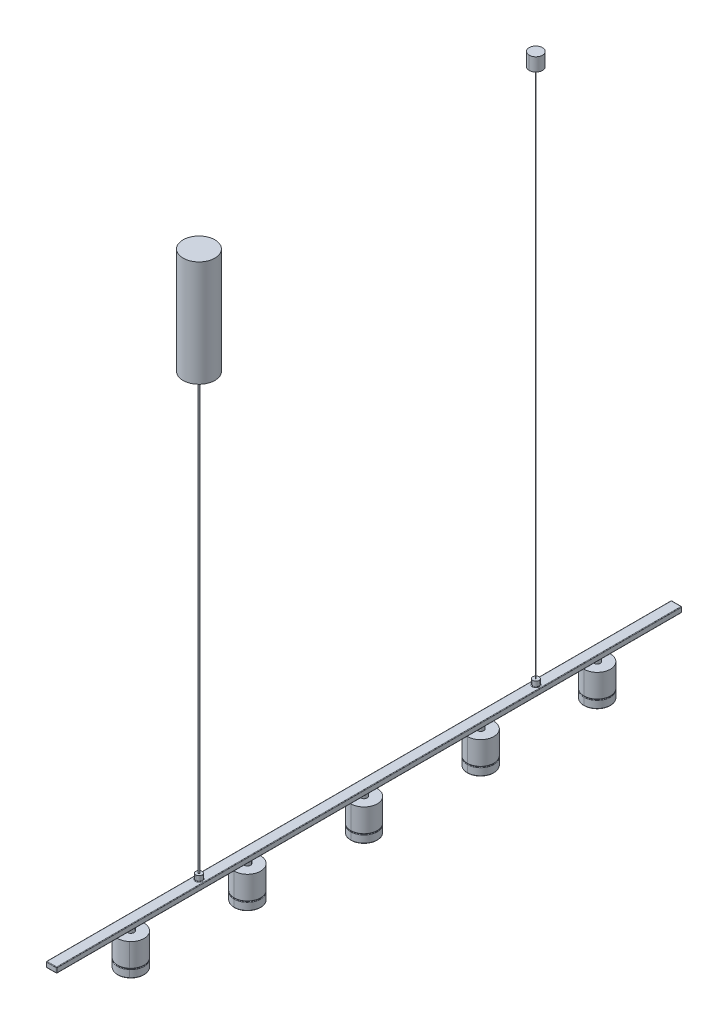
ISO-10303-21;
HEADER;
FILE_DESCRIPTION(('STEP AP214'),'2;1');
FILE_NAME('part.step','',(''),(''),'','','');
FILE_SCHEMA(('AUTOMOTIVE_DESIGN { 1 0 10303 214 1 1 1 1 }'));
ENDSEC;
DATA;
#1=APPLICATION_CONTEXT('core data for automotive mechanical design processes');
#2=APPLICATION_PROTOCOL_DEFINITION('international standard','automotive_design',2000,#1);
#3=PRODUCT_CONTEXT('',#1,'mechanical');
#4=PRODUCT('Part','Part','',(#3));
#5=PRODUCT_RELATED_PRODUCT_CATEGORY('part','',(#4));
#6=PRODUCT_DEFINITION_FORMATION('','',#4);
#7=PRODUCT_DEFINITION_CONTEXT('part definition',#1,'design');
#8=PRODUCT_DEFINITION('design','',#6,#7);
#9=PRODUCT_DEFINITION_SHAPE('','',#8);
#10=(LENGTH_UNIT() NAMED_UNIT(*) SI_UNIT(.MILLI.,.METRE.));
#11=(NAMED_UNIT(*) PLANE_ANGLE_UNIT() SI_UNIT($,.RADIAN.));
#12=(NAMED_UNIT(*) SI_UNIT($,.STERADIAN.) SOLID_ANGLE_UNIT());
#13=UNCERTAINTY_MEASURE_WITH_UNIT(LENGTH_MEASURE(1.E-05),#10,'distance_accuracy_value','');
#14=(GEOMETRIC_REPRESENTATION_CONTEXT(3) GLOBAL_UNCERTAINTY_ASSIGNED_CONTEXT((#13)) GLOBAL_UNIT_ASSIGNED_CONTEXT((#10,
#11,#12)) REPRESENTATION_CONTEXT('',''));
#15=CARTESIAN_POINT('',(0.,0.,0.));
#16=DIRECTION('',(0.,0.,1.));
#17=DIRECTION('',(1.,0.,0.));
#18=AXIS2_PLACEMENT_3D('',#15,#16,#17);
#19=CARTESIAN_POINT('',(-9.048887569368,839.774903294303,1491.40280877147));
#20=DIRECTION('',(0.,1.,0.));
#21=DIRECTION('',(0.,0.,1.));
#22=AXIS2_PLACEMENT_3D('',#19,#20,#21);
#23=CYLINDRICAL_SURFACE('',#22,30.);
#24=CARTESIAN_POINT('',(-9.048887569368,839.774903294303,1491.40280877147));
#25=DIRECTION('',(0.,1.,0.));
#26=DIRECTION('',(0.,0.,1.));
#27=AXIS2_PLACEMENT_3D('',#24,#25,#26);
#28=CIRCLE('',#27,30.);
#29=CARTESIAN_POINT('',(-9.048887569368,839.774903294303,1521.40280877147));
#30=VERTEX_POINT('',#29);
#31=EDGE_CURVE('P0_E10',#30,#30,#28,.T.);
#32=CARTESIAN_POINT('',(-9.048887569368,1039.7749032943,1491.40280877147));
#33=DIRECTION('',(0.,1.,0.));
#34=DIRECTION('',(0.,0.,1.));
#35=AXIS2_PLACEMENT_3D('',#32,#33,#34);
#36=CIRCLE('',#35,30.);
#37=CARTESIAN_POINT('',(-9.048887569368,1039.7749032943,1521.40280877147));
#38=VERTEX_POINT('',#37);
#39=EDGE_CURVE('P0_E37',#38,#38,#36,.T.);
#40=CARTESIAN_POINT('',(-9.048887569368,839.774903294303,1521.40280877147));
#41=CARTESIAN_POINT('',(-9.048887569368,841.858236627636,1521.40280877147));
#42=CARTESIAN_POINT('',(-9.048887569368,843.94156996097,1521.40280877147));
#43=CARTESIAN_POINT('',(-9.048887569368,848.108236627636,1521.40280877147));
#44=CARTESIAN_POINT('',(-9.048887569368,850.19156996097,1521.40280877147));
#45=CARTESIAN_POINT('',(-9.048887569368,854.358236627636,1521.40280877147));
#46=CARTESIAN_POINT('',(-9.048887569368,856.44156996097,1521.40280877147));
#47=CARTESIAN_POINT('',(-9.048887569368,860.608236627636,1521.40280877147));
#48=CARTESIAN_POINT('',(-9.048887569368,862.69156996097,1521.40280877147));
#49=CARTESIAN_POINT('',(-9.048887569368,866.858236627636,1521.40280877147));
#50=CARTESIAN_POINT('',(-9.048887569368,868.941569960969,1521.40280877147));
#51=CARTESIAN_POINT('',(-9.048887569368,873.108236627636,1521.40280877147));
#52=CARTESIAN_POINT('',(-9.048887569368,875.191569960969,1521.40280877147));
#53=CARTESIAN_POINT('',(-9.048887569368,879.358236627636,1521.40280877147));
#54=CARTESIAN_POINT('',(-9.048887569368,881.44156996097,1521.40280877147));
#55=CARTESIAN_POINT('',(-9.048887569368,885.608236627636,1521.40280877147));
#56=CARTESIAN_POINT('',(-9.048887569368,887.69156996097,1521.40280877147));
#57=CARTESIAN_POINT('',(-9.048887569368,891.858236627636,1521.40280877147));
#58=CARTESIAN_POINT('',(-9.048887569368,893.94156996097,1521.40280877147));
#59=CARTESIAN_POINT('',(-9.048887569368,898.108236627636,1521.40280877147));
#60=CARTESIAN_POINT('',(-9.048887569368,900.191569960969,1521.40280877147));
#61=CARTESIAN_POINT('',(-9.048887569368,904.358236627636,1521.40280877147));
#62=CARTESIAN_POINT('',(-9.048887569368,906.441569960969,1521.40280877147));
#63=CARTESIAN_POINT('',(-9.048887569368,910.608236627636,1521.40280877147));
#64=CARTESIAN_POINT('',(-9.048887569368,912.691569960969,1521.40280877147));
#65=CARTESIAN_POINT('',(-9.048887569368,916.858236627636,1521.40280877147));
#66=CARTESIAN_POINT('',(-9.048887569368,918.94156996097,1521.40280877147));
#67=CARTESIAN_POINT('',(-9.048887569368,923.108236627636,1521.40280877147));
#68=CARTESIAN_POINT('',(-9.048887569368,925.19156996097,1521.40280877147));
#69=CARTESIAN_POINT('',(-9.048887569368,929.358236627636,1521.40280877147));
#70=CARTESIAN_POINT('',(-9.048887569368,931.441569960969,1521.40280877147));
#71=CARTESIAN_POINT('',(-9.048887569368,935.608236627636,1521.40280877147));
#72=CARTESIAN_POINT('',(-9.048887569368,937.691569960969,1521.40280877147));
#73=CARTESIAN_POINT('',(-9.048887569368,941.858236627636,1521.40280877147));
#74=CARTESIAN_POINT('',(-9.048887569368,943.941569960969,1521.40280877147));
#75=CARTESIAN_POINT('',(-9.048887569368,948.108236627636,1521.40280877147));
#76=CARTESIAN_POINT('',(-9.048887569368,950.191569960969,1521.40280877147));
#77=CARTESIAN_POINT('',(-9.048887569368,954.358236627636,1521.40280877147));
#78=CARTESIAN_POINT('',(-9.048887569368,956.44156996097,1521.40280877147));
#79=CARTESIAN_POINT('',(-9.048887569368,960.608236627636,1521.40280877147));
#80=CARTESIAN_POINT('',(-9.048887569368,962.691569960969,1521.40280877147));
#81=CARTESIAN_POINT('',(-9.048887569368,966.858236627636,1521.40280877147));
#82=CARTESIAN_POINT('',(-9.048887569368,968.941569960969,1521.40280877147));
#83=CARTESIAN_POINT('',(-9.048887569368,973.108236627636,1521.40280877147));
#84=CARTESIAN_POINT('',(-9.048887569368,975.191569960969,1521.40280877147));
#85=CARTESIAN_POINT('',(-9.048887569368,979.358236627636,1521.40280877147));
#86=CARTESIAN_POINT('',(-9.048887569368,981.441569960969,1521.40280877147));
#87=CARTESIAN_POINT('',(-9.048887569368,985.608236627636,1521.40280877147));
#88=CARTESIAN_POINT('',(-9.048887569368,987.691569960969,1521.40280877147));
#89=CARTESIAN_POINT('',(-9.048887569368,991.858236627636,1521.40280877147));
#90=CARTESIAN_POINT('',(-9.048887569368,993.941569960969,1521.40280877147));
#91=CARTESIAN_POINT('',(-9.048887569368,998.108236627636,1521.40280877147));
#92=CARTESIAN_POINT('',(-9.048887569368,1000.19156996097,1521.40280877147));
#93=CARTESIAN_POINT('',(-9.048887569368,1004.35823662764,1521.40280877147));
#94=CARTESIAN_POINT('',(-9.048887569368,1006.44156996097,1521.40280877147));
#95=CARTESIAN_POINT('',(-9.048887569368,1010.60823662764,1521.40280877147));
#96=CARTESIAN_POINT('',(-9.048887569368,1012.69156996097,1521.40280877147));
#97=CARTESIAN_POINT('',(-9.048887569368,1016.85823662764,1521.40280877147));
#98=CARTESIAN_POINT('',(-9.048887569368,1018.94156996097,1521.40280877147));
#99=CARTESIAN_POINT('',(-9.048887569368,1023.10823662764,1521.40280877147));
#100=CARTESIAN_POINT('',(-9.048887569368,1025.19156996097,1521.40280877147));
#101=CARTESIAN_POINT('',(-9.048887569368,1029.35823662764,1521.40280877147));
#102=CARTESIAN_POINT('',(-9.048887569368,1031.44156996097,1521.40280877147));
#103=CARTESIAN_POINT('',(-9.048887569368,1035.60823662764,1521.40280877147));
#104=CARTESIAN_POINT('',(-9.048887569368,1037.69156996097,1521.40280877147));
#105=CARTESIAN_POINT('',(-9.048887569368,1039.7749032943,1521.40280877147));
#106=B_SPLINE_CURVE_WITH_KNOTS('',3,(#40,#41,#42,#43,#44,#45,#46,#47,#48,#49,#50,#51,#52,#53,
#54,#55,#56,#57,#58,#59,#60,#61,#62,#63,#64,#65,#66,#67,#68,#69,#70,#71,#72,#73,#74,#75,#76,#77,
#78,#79,#80,#81,#82,#83,#84,#85,#86,#87,#88,#89,#90,#91,#92,#93,#94,#95,#96,#97,#98,#99,#100,
#101,#102,#103,#104,#105),.UNSPECIFIED.,.F.,.F.,(4,2,2,2,2,2,2,2,2,2,2,2,2,2,2,2,2,2,2,2,2,2,2,
2,2,2,2,2,2,2,2,2,4),(0.,6.24999999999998,12.5,18.7499999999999,24.9999999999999,
31.2499999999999,37.4999999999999,43.75,49.9999999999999,56.2499999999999,62.4999999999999,
68.7499999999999,74.9999999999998,81.2499999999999,87.4999999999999,93.7499999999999,
99.9999999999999,106.25,112.5,118.75,125.,131.25,137.5,143.75,150.,156.25,162.5,168.75,175.,
181.25,187.5,193.75,200.),.UNSPECIFIED.);
#107=EDGE_CURVE('P0_BSEAM31',#30,#38,#106,.T.);
#108=ORIENTED_EDGE('',*,*,#31,.T.);
#109=ORIENTED_EDGE('',*,*,#39,.F.);
#110=ORIENTED_EDGE('',*,*,#107,.T.);
#111=ORIENTED_EDGE('',*,*,#107,.F.);
#112=EDGE_LOOP('',(#108,#110,#109,#111));
#113=FACE_BOUND('',#112,.T.);
#114=ADVANCED_FACE('P0_F31',(#113),#23,.T.);
#115=CARTESIAN_POINT('',(-9.048887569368,839.774903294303,1491.40280877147));
#116=DIRECTION('',(0.,1.,0.));
#117=DIRECTION('',(0.,0.,1.));
#118=AXIS2_PLACEMENT_3D('',#115,#116,#117);
#119=PLANE('',#118);
#120=ORIENTED_EDGE('',*,*,#31,.F.);
#121=EDGE_LOOP('',(#120));
#122=FACE_BOUND('',#121,.T.);
#123=ADVANCED_FACE('P0_F46',(#122),#119,.F.);
#124=CARTESIAN_POINT('',(-9.048887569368,1039.7749032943,1491.40280877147));
#125=DIRECTION('',(0.,1.,0.));
#126=DIRECTION('',(0.,0.,1.));
#127=AXIS2_PLACEMENT_3D('',#124,#125,#126);
#128=PLANE('',#127);
#129=ORIENTED_EDGE('',*,*,#39,.T.);
#130=EDGE_LOOP('',(#129));
#131=FACE_BOUND('',#130,.T.);
#132=ADVANCED_FACE('P0_F43',(#131),#128,.T.);
#133=CLOSED_SHELL('',(#114,#123,#132));
#134=MANIFOLD_SOLID_BREP('P0_B2',#133);
#135=CARTESIAN_POINT('',(-9.048887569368,1019.7749032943,855.727279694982));
#136=DIRECTION('',(0.,-1.,0.));
#137=DIRECTION('',(0.,0.,-1.));
#138=AXIS2_PLACEMENT_3D('',#135,#136,#137);
#139=CYLINDRICAL_SURFACE('',#138,0.5);
#140=CARTESIAN_POINT('',(-9.048887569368,1019.7749032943,855.727279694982));
#141=DIRECTION('',(0.,1.,0.));
#142=DIRECTION('',(0.,0.,1.));
#143=AXIS2_PLACEMENT_3D('',#140,#141,#142);
#144=CIRCLE('',#143,0.5);
#145=CARTESIAN_POINT('',(-9.048887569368,1019.7749032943,856.227279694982));
#146=VERTEX_POINT('',#145);
#147=CARTESIAN_POINT('',(-9.048887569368,1019.7749032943,855.227279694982));
#148=VERTEX_POINT('',#147);
#149=EDGE_CURVE('P1_E40',#146,#148,#144,.T.);
#150=ORIENTED_EDGE('',*,*,#149,.F.);
#151=DIRECTION('',(0.,-1.,0.));
#152=VECTOR('',#151,1.);
#153=CARTESIAN_POINT('',(-9.048887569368,1019.7749032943,856.227279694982));
#154=LINE('',#153,#152);
#155=CARTESIAN_POINT('',(-9.048887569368,19.774903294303,856.227279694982));
#156=VERTEX_POINT('',#155);
#157=EDGE_CURVE('P1_E11',#146,#156,#154,.T.);
#158=ORIENTED_EDGE('',*,*,#157,.T.);
#159=CARTESIAN_POINT('',(-9.048887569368,19.774903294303,855.727279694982));
#160=DIRECTION('',(0.,1.,0.));
#161=DIRECTION('',(0.,0.,1.));
#162=AXIS2_PLACEMENT_3D('',#159,#160,#161);
#163=CIRCLE('',#162,0.5);
#164=CARTESIAN_POINT('',(-9.048887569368,19.774903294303,855.227279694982));
#165=VERTEX_POINT('',#164);
#166=EDGE_CURVE('P1_E27',#156,#165,#163,.T.);
#167=ORIENTED_EDGE('',*,*,#166,.T.);
#168=DIRECTION('',(0.,-1.,0.));
#169=VECTOR('',#168,1.);
#170=CARTESIAN_POINT('',(-9.048887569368,1019.7749032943,855.227279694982));
#171=LINE('',#170,#169);
#172=EDGE_CURVE('P1_E20',#148,#165,#171,.T.);
#173=ORIENTED_EDGE('',*,*,#172,.F.);
#174=EDGE_LOOP('',(#150,#158,#167,#173));
#175=FACE_BOUND('',#174,.T.);
#176=ADVANCED_FACE('P1_F16',(#175),#139,.T.);
#177=CARTESIAN_POINT('',(-9.048887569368,1019.7749032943,855.727279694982));
#178=DIRECTION('',(0.,-1.,0.));
#179=DIRECTION('',(0.,0.,-1.));
#180=AXIS2_PLACEMENT_3D('',#177,#178,#179);
#181=CYLINDRICAL_SURFACE('',#180,0.5);
#182=ORIENTED_EDGE('',*,*,#157,.F.);
#183=CARTESIAN_POINT('',(-9.048887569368,1019.7749032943,855.727279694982));
#184=DIRECTION('',(0.,1.,0.));
#185=DIRECTION('',(0.,0.,1.));
#186=AXIS2_PLACEMENT_3D('',#183,#184,#185);
#187=CIRCLE('',#186,0.5);
#188=EDGE_CURVE('P1_E63',#148,#146,#187,.T.);
#189=ORIENTED_EDGE('',*,*,#188,.F.);
#190=ORIENTED_EDGE('',*,*,#172,.T.);
#191=CARTESIAN_POINT('',(-9.048887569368,19.774903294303,855.727279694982));
#192=DIRECTION('',(0.,1.,0.));
#193=DIRECTION('',(0.,0.,1.));
#194=AXIS2_PLACEMENT_3D('',#191,#192,#193);
#195=CIRCLE('',#194,0.5);
#196=EDGE_CURVE('P1_E62',#165,#156,#195,.T.);
#197=ORIENTED_EDGE('',*,*,#196,.T.);
#198=EDGE_LOOP('',(#182,#189,#190,#197));
#199=FACE_BOUND('',#198,.T.);
#200=ADVANCED_FACE('P1_F60',(#199),#181,.T.);
#201=CARTESIAN_POINT('',(-9.048887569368,1019.7749032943,855.727279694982));
#202=DIRECTION('',(0.,1.,0.));
#203=DIRECTION('',(1.,0.,0.));
#204=AXIS2_PLACEMENT_3D('',#201,#202,#203);
#205=PLANE('',#204);
#206=ORIENTED_EDGE('',*,*,#188,.T.);
#207=ORIENTED_EDGE('',*,*,#149,.T.);
#208=EDGE_LOOP('',(#206,#207));
#209=FACE_BOUND('',#208,.T.);
#210=ADVANCED_FACE('P1_F97',(#209),#205,.T.);
#211=CARTESIAN_POINT('',(-9.048887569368,19.774903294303,855.727279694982));
#212=DIRECTION('',(0.,1.,0.));
#213=DIRECTION('',(1.,0.,0.));
#214=AXIS2_PLACEMENT_3D('',#211,#212,#213);
#215=PLANE('',#214);
#216=ORIENTED_EDGE('',*,*,#196,.F.);
#217=ORIENTED_EDGE('',*,*,#166,.F.);
#218=EDGE_LOOP('',(#216,#217));
#219=FACE_BOUND('',#218,.T.);
#220=ADVANCED_FACE('P1_F18',(#219),#215,.F.);
#221=CLOSED_SHELL('',(#176,#200,#210,#220));
#222=MANIFOLD_SOLID_BREP('P1_B1',#221);
#223=CARTESIAN_POINT('',(-9.048887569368,1019.7749032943,1491.40280877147));
#224=DIRECTION('',(0.,-1.,0.));
#225=DIRECTION('',(0.,0.,-1.));
#226=AXIS2_PLACEMENT_3D('',#223,#224,#225);
#227=CYLINDRICAL_SURFACE('',#226,1.49999999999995);
#228=CARTESIAN_POINT('',(-9.048887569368,1019.7749032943,1491.40280877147));
#229=DIRECTION('',(0.,1.,0.));
#230=DIRECTION('',(0.,0.,1.));
#231=AXIS2_PLACEMENT_3D('',#228,#229,#230);
#232=CIRCLE('',#231,1.49999999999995);
#233=CARTESIAN_POINT('',(-9.048887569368,1019.7749032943,1492.90280877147));
#234=VERTEX_POINT('',#233);
#235=CARTESIAN_POINT('',(-9.048887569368,1019.7749032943,1489.90280877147));
#236=VERTEX_POINT('',#235);
#237=EDGE_CURVE('P2_E37',#234,#236,#232,.T.);
#238=ORIENTED_EDGE('',*,*,#237,.F.);
#239=DIRECTION('',(0.,-1.,0.));
#240=VECTOR('',#239,1.);
#241=CARTESIAN_POINT('',(-9.048887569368,1019.7749032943,1492.90280877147));
#242=LINE('',#241,#240);
#243=CARTESIAN_POINT('',(-9.048887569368,19.774903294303,1492.90280877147));
#244=VERTEX_POINT('',#243);
#245=EDGE_CURVE('P2_E11',#234,#244,#242,.T.);
#246=ORIENTED_EDGE('',*,*,#245,.T.);
#247=CARTESIAN_POINT('',(-9.048887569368,19.774903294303,1491.40280877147));
#248=DIRECTION('',(0.,1.,0.));
#249=DIRECTION('',(0.,0.,1.));
#250=AXIS2_PLACEMENT_3D('',#247,#248,#249);
#251=CIRCLE('',#250,1.49999999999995);
#252=CARTESIAN_POINT('',(-9.048887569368,19.774903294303,1489.90280877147));
#253=VERTEX_POINT('',#252);
#254=EDGE_CURVE('P2_E25',#244,#253,#251,.T.);
#255=ORIENTED_EDGE('',*,*,#254,.T.);
#256=DIRECTION('',(0.,-1.,0.));
#257=VECTOR('',#256,1.);
#258=CARTESIAN_POINT('',(-9.048887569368,1019.7749032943,1489.90280877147));
#259=LINE('',#258,#257);
#260=EDGE_CURVE('P2_E62',#236,#253,#259,.T.);
#261=ORIENTED_EDGE('',*,*,#260,.F.);
#262=EDGE_LOOP('',(#238,#246,#255,#261));
#263=FACE_BOUND('',#262,.T.);
#264=ADVANCED_FACE('P2_F16',(#263),#227,.T.);
#265=CARTESIAN_POINT('',(-9.048887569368,1019.7749032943,1491.40280877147));
#266=DIRECTION('',(0.,-1.,0.));
#267=DIRECTION('',(0.,0.,-1.));
#268=AXIS2_PLACEMENT_3D('',#265,#266,#267);
#269=CYLINDRICAL_SURFACE('',#268,1.49999999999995);
#270=ORIENTED_EDGE('',*,*,#245,.F.);
#271=CARTESIAN_POINT('',(-9.048887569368,1019.7749032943,1491.40280877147));
#272=DIRECTION('',(0.,1.,0.));
#273=DIRECTION('',(0.,0.,1.));
#274=AXIS2_PLACEMENT_3D('',#271,#272,#273);
#275=CIRCLE('',#274,1.49999999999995);
#276=EDGE_CURVE('P2_E59',#236,#234,#275,.T.);
#277=ORIENTED_EDGE('',*,*,#276,.F.);
#278=ORIENTED_EDGE('',*,*,#260,.T.);
#279=CARTESIAN_POINT('',(-9.048887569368,19.774903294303,1491.40280877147));
#280=DIRECTION('',(0.,1.,0.));
#281=DIRECTION('',(0.,0.,1.));
#282=AXIS2_PLACEMENT_3D('',#279,#280,#281);
#283=CIRCLE('',#282,1.49999999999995);
#284=EDGE_CURVE('P2_E66',#253,#244,#283,.T.);
#285=ORIENTED_EDGE('',*,*,#284,.T.);
#286=EDGE_LOOP('',(#270,#277,#278,#285));
#287=FACE_BOUND('',#286,.T.);
#288=ADVANCED_FACE('P2_F67',(#287),#269,.T.);
#289=CARTESIAN_POINT('',(-9.048887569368,1019.7749032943,1491.40280877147));
#290=DIRECTION('',(0.,1.,0.));
#291=DIRECTION('',(1.,0.,0.));
#292=AXIS2_PLACEMENT_3D('',#289,#290,#291);
#293=PLANE('',#292);
#294=ORIENTED_EDGE('',*,*,#276,.T.);
#295=ORIENTED_EDGE('',*,*,#237,.T.);
#296=EDGE_LOOP('',(#294,#295));
#297=FACE_BOUND('',#296,.T.);
#298=ADVANCED_FACE('P2_F57',(#297),#293,.T.);
#299=CARTESIAN_POINT('',(-9.048887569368,19.774903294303,1491.40280877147));
#300=DIRECTION('',(0.,1.,0.));
#301=DIRECTION('',(1.,0.,0.));
#302=AXIS2_PLACEMENT_3D('',#299,#300,#301);
#303=PLANE('',#302);
#304=ORIENTED_EDGE('',*,*,#284,.F.);
#305=ORIENTED_EDGE('',*,*,#254,.F.);
#306=EDGE_LOOP('',(#304,#305));
#307=FACE_BOUND('',#306,.T.);
#308=ADVANCED_FACE('P2_F18',(#307),#303,.F.);
#309=CLOSED_SHELL('',(#264,#288,#298,#308));
#310=MANIFOLD_SOLID_BREP('P2_B1',#309);
#311=CARTESIAN_POINT('',(-9.048887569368,10.774903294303,1491.40280877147));
#312=DIRECTION('',(0.,-1.,0.));
#313=DIRECTION('',(0.,0.,-1.));
#314=AXIS2_PLACEMENT_3D('',#311,#312,#313);
#315=TOROIDAL_SURFACE('',#314,7.,1.);
#316=CARTESIAN_POINT('',(-9.048887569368,9.774903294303,1491.40280877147));
#317=DIRECTION('',(0.,-1.,0.));
#318=DIRECTION('',(0.,0.,-1.));
#319=AXIS2_PLACEMENT_3D('',#316,#317,#318);
#320=CIRCLE('',#319,7.);
#321=CARTESIAN_POINT('',(-9.048887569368,9.774903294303,1498.40280877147));
#322=VERTEX_POINT('',#321);
#323=CARTESIAN_POINT('',(-9.048887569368,9.774903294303,1484.40280877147));
#324=VERTEX_POINT('',#323);
#325=EDGE_CURVE('P3_E41',#322,#324,#320,.T.);
#326=ORIENTED_EDGE('',*,*,#325,.F.);
#327=CARTESIAN_POINT('',(-9.048887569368,10.774903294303,1498.40280877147));
#328=DIRECTION('',(1.,0.,0.));
#329=DIRECTION('',(0.,0.,-1.));
#330=AXIS2_PLACEMENT_3D('',#327,#328,#329);
#331=CIRCLE('',#330,1.);
#332=CARTESIAN_POINT('',(-9.048887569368,10.774903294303,1497.40280877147));
#333=VERTEX_POINT('',#332);
#334=EDGE_CURVE('P3_E11',#322,#333,#331,.T.);
#335=ORIENTED_EDGE('',*,*,#334,.T.);
#336=CARTESIAN_POINT('',(-9.048887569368,10.774903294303,1491.40280877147));
#337=DIRECTION('',(0.,1.,0.));
#338=DIRECTION('',(0.,0.,-1.));
#339=AXIS2_PLACEMENT_3D('',#336,#337,#338);
#340=CIRCLE('',#339,6.);
#341=CARTESIAN_POINT('',(-9.048887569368,10.774903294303,1485.40280877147));
#342=VERTEX_POINT('',#341);
#343=EDGE_CURVE('P3_E242',#342,#333,#340,.T.);
#344=ORIENTED_EDGE('',*,*,#343,.F.);
#345=CARTESIAN_POINT('',(-9.048887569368,10.774903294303,1484.40280877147));
#346=DIRECTION('',(-1.,0.,0.));
#347=DIRECTION('',(0.,0.,1.));
#348=AXIS2_PLACEMENT_3D('',#345,#346,#347);
#349=CIRCLE('',#348,1.);
#350=EDGE_CURVE('P3_E309',#324,#342,#349,.T.);
#351=ORIENTED_EDGE('',*,*,#350,.F.);
#352=EDGE_LOOP('',(#326,#335,#344,#351));
#353=FACE_BOUND('',#352,.T.);
#354=ADVANCED_FACE('P3_F16',(#353),#315,.F.);
#355=CARTESIAN_POINT('',(-9.048887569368,10.774903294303,855.727279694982));
#356=DIRECTION('',(0.,-1.,0.));
#357=DIRECTION('',(0.,0.,-1.));
#358=AXIS2_PLACEMENT_3D('',#355,#356,#357);
#359=TOROIDAL_SURFACE('',#358,7.,1.);
#360=CARTESIAN_POINT('',(-9.048887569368,9.774903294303,855.727279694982));
#361=DIRECTION('',(0.,-1.,0.));
#362=DIRECTION('',(0.,0.,-1.));
#363=AXIS2_PLACEMENT_3D('',#360,#361,#362);
#364=CIRCLE('',#363,7.);
#365=CARTESIAN_POINT('',(-9.048887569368,9.774903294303,862.727279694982));
#366=VERTEX_POINT('',#365);
#367=CARTESIAN_POINT('',(-9.048887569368,9.774903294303,848.727279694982));
#368=VERTEX_POINT('',#367);
#369=EDGE_CURVE('P3_E377',#366,#368,#364,.T.);
#370=ORIENTED_EDGE('',*,*,#369,.F.);
#371=CARTESIAN_POINT('',(-9.048887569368,10.774903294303,862.727279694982));
#372=DIRECTION('',(1.,0.,0.));
#373=DIRECTION('',(0.,0.,-1.));
#374=AXIS2_PLACEMENT_3D('',#371,#372,#373);
#375=CIRCLE('',#374,1.);
#376=CARTESIAN_POINT('',(-9.048887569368,10.774903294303,861.727279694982));
#377=VERTEX_POINT('',#376);
#378=EDGE_CURVE('P3_E27',#366,#377,#375,.T.);
#379=ORIENTED_EDGE('',*,*,#378,.T.);
#380=CARTESIAN_POINT('',(-9.048887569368,10.774903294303,855.727279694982));
#381=DIRECTION('',(0.,1.,0.));
#382=DIRECTION('',(0.,0.,-1.));
#383=AXIS2_PLACEMENT_3D('',#380,#381,#382);
#384=CIRCLE('',#383,6.);
#385=CARTESIAN_POINT('',(-9.048887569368,10.774903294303,849.727279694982));
#386=VERTEX_POINT('',#385);
#387=EDGE_CURVE('P3_E244',#386,#377,#384,.T.);
#388=ORIENTED_EDGE('',*,*,#387,.F.);
#389=CARTESIAN_POINT('',(-9.048887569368,10.774903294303,848.727279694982));
#390=DIRECTION('',(-1.,0.,0.));
#391=DIRECTION('',(0.,0.,1.));
#392=AXIS2_PLACEMENT_3D('',#389,#390,#391);
#393=CIRCLE('',#392,1.);
#394=EDGE_CURVE('P3_E306',#368,#386,#393,.T.);
#395=ORIENTED_EDGE('',*,*,#394,.F.);
#396=EDGE_LOOP('',(#370,#379,#388,#395));
#397=FACE_BOUND('',#396,.T.);
#398=ADVANCED_FACE('P3_F735',(#397),#359,.F.);
#399=CARTESIAN_POINT('',(-9.048887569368,19.774903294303,1491.40280877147));
#400=DIRECTION('',(0.,-1.,0.));
#401=DIRECTION('',(0.,0.,-1.));
#402=AXIS2_PLACEMENT_3D('',#399,#400,#401);
#403=CYLINDRICAL_SURFACE('',#402,6.);
#404=CARTESIAN_POINT('',(-9.048887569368,19.774903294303,1491.40280877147));
#405=DIRECTION('',(0.,1.,0.));
#406=DIRECTION('',(0.,0.,1.));
#407=AXIS2_PLACEMENT_3D('',#404,#405,#406);
#408=CIRCLE('',#407,6.);
#409=CARTESIAN_POINT('',(-9.048887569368,19.774903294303,1497.40280877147));
#410=VERTEX_POINT('',#409);
#411=CARTESIAN_POINT('',(-9.048887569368,19.774903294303,1485.40280877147));
#412=VERTEX_POINT('',#411);
#413=EDGE_CURVE('P3_E243',#410,#412,#408,.T.);
#414=ORIENTED_EDGE('',*,*,#413,.F.);
#415=DIRECTION('',(0.,-1.,0.));
#416=VECTOR('',#415,1.);
#417=CARTESIAN_POINT('',(-9.048887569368,19.774903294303,1497.40280877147));
#418=LINE('',#417,#416);
#419=EDGE_CURVE('P3_E262',#410,#333,#418,.T.);
#420=ORIENTED_EDGE('',*,*,#419,.T.);
#421=CARTESIAN_POINT('',(-9.048887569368,10.774903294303,1491.40280877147));
#422=DIRECTION('',(0.,1.,0.));
#423=DIRECTION('',(0.,0.,-1.));
#424=AXIS2_PLACEMENT_3D('',#421,#422,#423);
#425=CIRCLE('',#424,6.);
#426=EDGE_CURVE('P3_E258',#333,#342,#425,.T.);
#427=ORIENTED_EDGE('',*,*,#426,.T.);
#428=DIRECTION('',(0.,-1.,0.));
#429=VECTOR('',#428,1.);
#430=CARTESIAN_POINT('',(-9.048887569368,19.774903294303,1485.40280877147));
#431=LINE('',#430,#429);
#432=EDGE_CURVE('P3_E268',#412,#342,#431,.T.);
#433=ORIENTED_EDGE('',*,*,#432,.F.);
#434=EDGE_LOOP('',(#414,#420,#427,#433));
#435=FACE_BOUND('',#434,.T.);
#436=ADVANCED_FACE('P3_F643',(#435),#403,.T.);
#437=CARTESIAN_POINT('',(-9.048887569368,19.774903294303,855.727279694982));
#438=DIRECTION('',(0.,-1.,0.));
#439=DIRECTION('',(0.,0.,-1.));
#440=AXIS2_PLACEMENT_3D('',#437,#438,#439);
#441=CYLINDRICAL_SURFACE('',#440,6.);
#442=CARTESIAN_POINT('',(-9.048887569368,19.774903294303,855.727279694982));
#443=DIRECTION('',(0.,1.,0.));
#444=DIRECTION('',(0.,0.,1.));
#445=AXIS2_PLACEMENT_3D('',#442,#443,#444);
#446=CIRCLE('',#445,6.);
#447=CARTESIAN_POINT('',(-9.048887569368,19.774903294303,861.727279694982));
#448=VERTEX_POINT('',#447);
#449=CARTESIAN_POINT('',(-9.048887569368,19.774903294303,849.727279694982));
#450=VERTEX_POINT('',#449);
#451=EDGE_CURVE('P3_E272',#448,#450,#446,.T.);
#452=ORIENTED_EDGE('',*,*,#451,.F.);
#453=DIRECTION('',(0.,-1.,0.));
#454=VECTOR('',#453,1.);
#455=CARTESIAN_POINT('',(-9.048887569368,19.774903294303,861.727279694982));
#456=LINE('',#455,#454);
#457=EDGE_CURVE('P3_E263',#448,#377,#456,.T.);
#458=ORIENTED_EDGE('',*,*,#457,.T.);
#459=CARTESIAN_POINT('',(-9.048887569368,10.774903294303,855.727279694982));
#460=DIRECTION('',(0.,1.,0.));
#461=DIRECTION('',(0.,0.,-1.));
#462=AXIS2_PLACEMENT_3D('',#459,#460,#461);
#463=CIRCLE('',#462,6.);
#464=EDGE_CURVE('P3_E329',#377,#386,#463,.T.);
#465=ORIENTED_EDGE('',*,*,#464,.T.);
#466=DIRECTION('',(0.,-1.,0.));
#467=VECTOR('',#466,1.);
#468=CARTESIAN_POINT('',(-9.048887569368,19.774903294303,849.727279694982));
#469=LINE('',#468,#467);
#470=EDGE_CURVE('P3_E247',#450,#386,#469,.T.);
#471=ORIENTED_EDGE('',*,*,#470,.F.);
#472=EDGE_LOOP('',(#452,#458,#465,#471));
#473=FACE_BOUND('',#472,.T.);
#474=ADVANCED_FACE('P3_F638',(#473),#441,.T.);
#475=CARTESIAN_POINT('',(0.951112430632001,9.774903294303,1770.));
#476=DIRECTION('',(-1.,0.,0.));
#477=DIRECTION('',(0.,0.,1.));
#478=AXIS2_PLACEMENT_3D('',#475,#476,#477);
#479=PLANE('',#478);
#480=DIRECTION('',(0.,1.,0.));
#481=VECTOR('',#480,1.);
#482=CARTESIAN_POINT('',(0.951112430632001,9.774903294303,591.));
#483=LINE('',#482,#481);
#484=CARTESIAN_POINT('',(0.951112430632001,0.774903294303,591.));
#485=VERTEX_POINT('',#484);
#486=CARTESIAN_POINT('',(0.951112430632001,8.774903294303,591.));
#487=VERTEX_POINT('',#486);
#488=EDGE_CURVE('P3_E333',#485,#487,#483,.T.);
#489=ORIENTED_EDGE('',*,*,#488,.T.);
#490=DIRECTION('',(0.,0.,1.));
#491=VECTOR('',#490,1.);
#492=CARTESIAN_POINT('',(0.951112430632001,8.774903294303,1770.));
#493=LINE('',#492,#491);
#494=CARTESIAN_POINT('',(0.951112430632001,8.774903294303,1769.));
#495=VERTEX_POINT('',#494);
#496=EDGE_CURVE('P3_E342',#487,#495,#493,.T.);
#497=ORIENTED_EDGE('',*,*,#496,.T.);
#498=DIRECTION('',(0.,-1.,0.));
#499=VECTOR('',#498,1.);
#500=CARTESIAN_POINT('',(0.951112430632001,-0.225096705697,1769.));
#501=LINE('',#500,#499);
#502=CARTESIAN_POINT('',(0.951112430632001,0.774903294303,1769.));
#503=VERTEX_POINT('',#502);
#504=EDGE_CURVE('P3_E346',#495,#503,#501,.T.);
#505=ORIENTED_EDGE('',*,*,#504,.T.);
#506=DIRECTION('',(0.,0.,-1.));
#507=VECTOR('',#506,1.);
#508=CARTESIAN_POINT('',(0.951112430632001,0.774903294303,1770.));
#509=LINE('',#508,#507);
#510=EDGE_CURVE('P3_E403',#503,#485,#509,.T.);
#511=ORIENTED_EDGE('',*,*,#510,.T.);
#512=EDGE_LOOP('',(#489,#497,#505,#511));
#513=FACE_BOUND('',#512,.T.);
#514=ADVANCED_FACE('P3_F463',(#513),#479,.F.);
#515=CARTESIAN_POINT('',(-19.048887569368,9.774903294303,1770.));
#516=DIRECTION('',(0.,-1.,0.));
#517=DIRECTION('',(0.,0.,-1.));
#518=AXIS2_PLACEMENT_3D('',#515,#516,#517);
#519=PLANE('',#518);
#520=DIRECTION('',(0.,0.,-1.));
#521=VECTOR('',#520,1.);
#522=CARTESIAN_POINT('',(-0.0488875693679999,9.774903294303,1770.));
#523=LINE('',#522,#521);
#524=CARTESIAN_POINT('',(-0.0488875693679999,9.774903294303,1769.));
#525=VERTEX_POINT('',#524);
#526=CARTESIAN_POINT('',(-0.0488875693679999,9.774903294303,591.));
#527=VERTEX_POINT('',#526);
#528=EDGE_CURVE('P3_E386',#525,#527,#523,.T.);
#529=ORIENTED_EDGE('',*,*,#528,.T.);
#530=DIRECTION('',(-1.,0.,0.));
#531=VECTOR('',#530,1.);
#532=CARTESIAN_POINT('',(-19.048887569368,9.774903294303,591.));
#533=LINE('',#532,#531);
#534=CARTESIAN_POINT('',(-18.048887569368,9.774903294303,591.));
#535=VERTEX_POINT('',#534);
#536=EDGE_CURVE('P3_E353',#527,#535,#533,.T.);
#537=ORIENTED_EDGE('',*,*,#536,.T.);
#538=DIRECTION('',(0.,0.,1.));
#539=VECTOR('',#538,1.);
#540=CARTESIAN_POINT('',(-18.048887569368,9.774903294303,1770.));
#541=LINE('',#540,#539);
#542=CARTESIAN_POINT('',(-18.048887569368,9.774903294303,1769.));
#543=VERTEX_POINT('',#542);
#544=EDGE_CURVE('P3_E349',#535,#543,#541,.T.);
#545=ORIENTED_EDGE('',*,*,#544,.T.);
#546=DIRECTION('',(1.,0.,0.));
#547=VECTOR('',#546,1.);
#548=CARTESIAN_POINT('',(0.951112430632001,9.774903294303,1769.));
#549=LINE('',#548,#547);
#550=EDGE_CURVE('P3_E354',#543,#525,#549,.T.);
#551=ORIENTED_EDGE('',*,*,#550,.T.);
#552=EDGE_LOOP('',(#529,#537,#545,#551));
#553=FACE_BOUND('',#552,.T.);
#554=CARTESIAN_POINT('',(-9.048887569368,9.774903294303,855.727279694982));
#555=DIRECTION('',(0.,-1.,0.));
#556=DIRECTION('',(0.,0.,-1.));
#557=AXIS2_PLACEMENT_3D('',#554,#555,#556);
#558=CIRCLE('',#557,7.);
#559=EDGE_CURVE('P3_E396',#368,#366,#558,.T.);
#560=ORIENTED_EDGE('',*,*,#559,.T.);
#561=ORIENTED_EDGE('',*,*,#369,.T.);
#562=EDGE_LOOP('',(#560,#561));
#563=FACE_BOUND('',#562,.T.);
#564=CARTESIAN_POINT('',(-9.048887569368,9.774903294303,1491.40280877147));
#565=DIRECTION('',(0.,-1.,0.));
#566=DIRECTION('',(0.,0.,-1.));
#567=AXIS2_PLACEMENT_3D('',#564,#565,#566);
#568=CIRCLE('',#567,7.);
#569=EDGE_CURVE('P3_E373',#324,#322,#568,.T.);
#570=ORIENTED_EDGE('',*,*,#569,.T.);
#571=ORIENTED_EDGE('',*,*,#325,.T.);
#572=EDGE_LOOP('',(#570,#571));
#573=FACE_BOUND('',#572,.T.);
#574=ADVANCED_FACE('P3_F445',(#553,#563,#573),#519,.F.);
#575=CARTESIAN_POINT('',(-19.048887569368,9.774903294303,1770.));
#576=DIRECTION('',(1.,0.,0.));
#577=DIRECTION('',(0.,1.,0.));
#578=AXIS2_PLACEMENT_3D('',#575,#576,#577);
#579=PLANE('',#578);
#580=DIRECTION('',(0.,-1.,0.));
#581=VECTOR('',#580,1.);
#582=CARTESIAN_POINT('',(-19.048887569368,9.774903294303,591.));
#583=LINE('',#582,#581);
#584=CARTESIAN_POINT('',(-19.048887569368,8.774903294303,591.));
#585=VERTEX_POINT('',#584);
#586=CARTESIAN_POINT('',(-19.048887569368,0.774903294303,591.));
#587=VERTEX_POINT('',#586);
#588=EDGE_CURVE('P3_E285',#585,#587,#583,.T.);
#589=ORIENTED_EDGE('',*,*,#588,.T.);
#590=DIRECTION('',(0.,0.,1.));
#591=VECTOR('',#590,1.);
#592=CARTESIAN_POINT('',(-19.048887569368,0.774903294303,1770.));
#593=LINE('',#592,#591);
#594=CARTESIAN_POINT('',(-19.048887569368,0.774903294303,1769.));
#595=VERTEX_POINT('',#594);
#596=EDGE_CURVE('P3_E281',#587,#595,#593,.T.);
#597=ORIENTED_EDGE('',*,*,#596,.T.);
#598=DIRECTION('',(0.,1.,0.));
#599=VECTOR('',#598,1.);
#600=CARTESIAN_POINT('',(-19.048887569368,9.774903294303,1769.));
#601=LINE('',#600,#599);
#602=CARTESIAN_POINT('',(-19.048887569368,8.774903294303,1769.));
#603=VERTEX_POINT('',#602);
#604=EDGE_CURVE('P3_E286',#595,#603,#601,.T.);
#605=ORIENTED_EDGE('',*,*,#604,.T.);
#606=DIRECTION('',(0.,0.,-1.));
#607=VECTOR('',#606,1.);
#608=CARTESIAN_POINT('',(-19.048887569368,8.774903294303,1770.));
#609=LINE('',#608,#607);
#610=EDGE_CURVE('P3_E218',#603,#585,#609,.T.);
#611=ORIENTED_EDGE('',*,*,#610,.T.);
#612=EDGE_LOOP('',(#589,#597,#605,#611));
#613=FACE_BOUND('',#612,.T.);
#614=ADVANCED_FACE('P3_F657',(#613),#579,.F.);
#615=CARTESIAN_POINT('',(-19.048887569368,-0.225096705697,1770.));
#616=DIRECTION('',(0.,1.,0.));
#617=DIRECTION('',(1.,0.,0.));
#618=AXIS2_PLACEMENT_3D('',#615,#616,#617);
#619=PLANE('',#618);
#620=DIRECTION('',(1.,0.,0.));
#621=VECTOR('',#620,1.);
#622=CARTESIAN_POINT('',(-19.048887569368,-0.225096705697,591.));
#623=LINE('',#622,#621);
#624=CARTESIAN_POINT('',(-18.048887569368,-0.225096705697,591.));
#625=VERTEX_POINT('',#624);
#626=CARTESIAN_POINT('',(-0.0488875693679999,-0.225096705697,591.));
#627=VERTEX_POINT('',#626);
#628=EDGE_CURVE('P3_E207',#625,#627,#623,.T.);
#629=ORIENTED_EDGE('',*,*,#628,.T.);
#630=DIRECTION('',(0.,0.,1.));
#631=VECTOR('',#630,1.);
#632=CARTESIAN_POINT('',(-0.0488875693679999,-0.225096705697,1770.));
#633=LINE('',#632,#631);
#634=CARTESIAN_POINT('',(-0.0488875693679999,-0.225096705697,1769.));
#635=VERTEX_POINT('',#634);
#636=EDGE_CURVE('P3_E200',#627,#635,#633,.T.);
#637=ORIENTED_EDGE('',*,*,#636,.T.);
#638=DIRECTION('',(-1.,0.,0.));
#639=VECTOR('',#638,1.);
#640=CARTESIAN_POINT('',(-19.048887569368,-0.225096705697,1769.));
#641=LINE('',#640,#639);
#642=CARTESIAN_POINT('',(-18.048887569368,-0.225096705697,1769.));
#643=VERTEX_POINT('',#642);
#644=EDGE_CURVE('P3_E208',#635,#643,#641,.T.);
#645=ORIENTED_EDGE('',*,*,#644,.T.);
#646=DIRECTION('',(0.,0.,-1.));
#647=VECTOR('',#646,1.);
#648=CARTESIAN_POINT('',(-18.048887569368,-0.225096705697,1770.));
#649=LINE('',#648,#647);
#650=EDGE_CURVE('P3_E214',#643,#625,#649,.T.);
#651=ORIENTED_EDGE('',*,*,#650,.T.);
#652=EDGE_LOOP('',(#629,#637,#645,#651));
#653=FACE_BOUND('',#652,.T.);
#654=ADVANCED_FACE('P3_F212',(#653),#619,.F.);
#655=CARTESIAN_POINT('',(-9.048887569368,4.774903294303,1770.));
#656=DIRECTION('',(0.,0.,1.));
#657=DIRECTION('',(1.,0.,0.));
#658=AXIS2_PLACEMENT_3D('',#655,#656,#657);
#659=PLANE('',#658);
#660=DIRECTION('',(0.,-1.,0.));
#661=VECTOR('',#660,1.);
#662=CARTESIAN_POINT('',(-18.048887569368,-0.225096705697,1770.));
#663=LINE('',#662,#661);
#664=CARTESIAN_POINT('',(-18.048887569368,8.774903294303,1770.));
#665=VERTEX_POINT('',#664);
#666=CARTESIAN_POINT('',(-18.048887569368,0.774903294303,1770.));
#667=VERTEX_POINT('',#666);
#668=EDGE_CURVE('P3_E366',#665,#667,#663,.T.);
#669=ORIENTED_EDGE('',*,*,#668,.T.);
#670=DIRECTION('',(1.,0.,0.));
#671=VECTOR('',#670,1.);
#672=CARTESIAN_POINT('',(0.951112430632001,0.774903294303,1770.));
#673=LINE('',#672,#671);
#674=CARTESIAN_POINT('',(-0.0488875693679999,0.774903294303,1770.));
#675=VERTEX_POINT('',#674);
#676=EDGE_CURVE('P3_E296',#667,#675,#673,.T.);
#677=ORIENTED_EDGE('',*,*,#676,.T.);
#678=DIRECTION('',(0.,1.,0.));
#679=VECTOR('',#678,1.);
#680=CARTESIAN_POINT('',(-0.0488875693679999,9.774903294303,1770.));
#681=LINE('',#680,#679);
#682=CARTESIAN_POINT('',(-0.0488875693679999,8.774903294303,1770.));
#683=VERTEX_POINT('',#682);
#684=EDGE_CURVE('P3_E290',#675,#683,#681,.T.);
#685=ORIENTED_EDGE('',*,*,#684,.T.);
#686=DIRECTION('',(-1.,0.,0.));
#687=VECTOR('',#686,1.);
#688=CARTESIAN_POINT('',(-19.048887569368,8.774903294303,1770.));
#689=LINE('',#688,#687);
#690=EDGE_CURVE('P3_E253',#683,#665,#689,.T.);
#691=ORIENTED_EDGE('',*,*,#690,.T.);
#692=EDGE_LOOP('',(#669,#677,#685,#691));
#693=FACE_BOUND('',#692,.T.);
#694=ADVANCED_FACE('P3_F540',(#693),#659,.T.);
#695=CARTESIAN_POINT('',(-9.048887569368,4.774903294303,590.));
#696=DIRECTION('',(0.,0.,1.));
#697=DIRECTION('',(1.,0.,0.));
#698=AXIS2_PLACEMENT_3D('',#695,#696,#697);
#699=PLANE('',#698);
#700=DIRECTION('',(0.,1.,0.));
#701=VECTOR('',#700,1.);
#702=CARTESIAN_POINT('',(-18.048887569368,4.774903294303,590.));
#703=LINE('',#702,#701);
#704=CARTESIAN_POINT('',(-18.048887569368,0.774903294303,590.));
#705=VERTEX_POINT('',#704);
#706=CARTESIAN_POINT('',(-18.048887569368,8.774903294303,590.));
#707=VERTEX_POINT('',#706);
#708=EDGE_CURVE('P3_E249',#705,#707,#703,.T.);
#709=ORIENTED_EDGE('',*,*,#708,.T.);
#710=DIRECTION('',(1.,0.,0.));
#711=VECTOR('',#710,1.);
#712=CARTESIAN_POINT('',(-9.048887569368,8.774903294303,590.));
#713=LINE('',#712,#711);
#714=CARTESIAN_POINT('',(-0.0488875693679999,8.774903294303,590.));
#715=VERTEX_POINT('',#714);
#716=EDGE_CURVE('P3_E254',#707,#715,#713,.T.);
#717=ORIENTED_EDGE('',*,*,#716,.T.);
#718=DIRECTION('',(0.,-1.,0.));
#719=VECTOR('',#718,1.);
#720=CARTESIAN_POINT('',(-0.0488875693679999,4.774903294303,590.));
#721=LINE('',#720,#719);
#722=CARTESIAN_POINT('',(-0.0488875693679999,0.774903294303,590.));
#723=VERTEX_POINT('',#722);
#724=EDGE_CURVE('P3_E369',#715,#723,#721,.T.);
#725=ORIENTED_EDGE('',*,*,#724,.T.);
#726=DIRECTION('',(-1.,0.,0.));
#727=VECTOR('',#726,1.);
#728=CARTESIAN_POINT('',(-9.048887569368,0.774903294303,590.));
#729=LINE('',#728,#727);
#730=EDGE_CURVE('P3_E222',#723,#705,#729,.T.);
#731=ORIENTED_EDGE('',*,*,#730,.T.);
#732=EDGE_LOOP('',(#709,#717,#725,#731));
#733=FACE_BOUND('',#732,.T.);
#734=ADVANCED_FACE('P3_F534',(#733),#699,.F.);
#735=CARTESIAN_POINT('',(-9.048887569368,19.774903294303,855.727279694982));
#736=DIRECTION('',(0.,-1.,0.));
#737=DIRECTION('',(0.,0.,-1.));
#738=AXIS2_PLACEMENT_3D('',#735,#736,#737);
#739=CYLINDRICAL_SURFACE('',#738,6.);
#740=ORIENTED_EDGE('',*,*,#457,.F.);
#741=CARTESIAN_POINT('',(-9.048887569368,19.774903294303,855.727279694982));
#742=DIRECTION('',(0.,1.,0.));
#743=DIRECTION('',(0.,0.,1.));
#744=AXIS2_PLACEMENT_3D('',#741,#742,#743);
#745=CIRCLE('',#744,6.);
#746=EDGE_CURVE('P3_E248',#450,#448,#745,.T.);
#747=ORIENTED_EDGE('',*,*,#746,.F.);
#748=ORIENTED_EDGE('',*,*,#470,.T.);
#749=ORIENTED_EDGE('',*,*,#387,.T.);
#750=EDGE_LOOP('',(#740,#747,#748,#749));
#751=FACE_BOUND('',#750,.T.);
#752=ADVANCED_FACE('P3_F539',(#751),#739,.T.);
#753=CARTESIAN_POINT('',(-9.048887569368,19.774903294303,855.727279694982));
#754=DIRECTION('',(0.,1.,0.));
#755=DIRECTION('',(1.,0.,0.));
#756=AXIS2_PLACEMENT_3D('',#753,#754,#755);
#757=PLANE('',#756);
#758=ORIENTED_EDGE('',*,*,#746,.T.);
#759=ORIENTED_EDGE('',*,*,#451,.T.);
#760=EDGE_LOOP('',(#758,#759));
#761=FACE_BOUND('',#760,.T.);
#762=ADVANCED_FACE('P3_F525',(#761),#757,.T.);
#763=CARTESIAN_POINT('',(-9.048887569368,19.774903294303,1491.40280877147));
#764=DIRECTION('',(0.,-1.,0.));
#765=DIRECTION('',(0.,0.,-1.));
#766=AXIS2_PLACEMENT_3D('',#763,#764,#765);
#767=CYLINDRICAL_SURFACE('',#766,6.);
#768=ORIENTED_EDGE('',*,*,#419,.F.);
#769=CARTESIAN_POINT('',(-9.048887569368,19.774903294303,1491.40280877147));
#770=DIRECTION('',(0.,1.,0.));
#771=DIRECTION('',(0.,0.,1.));
#772=AXIS2_PLACEMENT_3D('',#769,#770,#771);
#773=CIRCLE('',#772,6.);
#774=EDGE_CURVE('P3_E238',#412,#410,#773,.T.);
#775=ORIENTED_EDGE('',*,*,#774,.F.);
#776=ORIENTED_EDGE('',*,*,#432,.T.);
#777=ORIENTED_EDGE('',*,*,#343,.T.);
#778=EDGE_LOOP('',(#768,#775,#776,#777));
#779=FACE_BOUND('',#778,.T.);
#780=ADVANCED_FACE('P3_F513',(#779),#767,.T.);
#781=CARTESIAN_POINT('',(-9.048887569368,19.774903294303,1491.40280877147));
#782=DIRECTION('',(0.,1.,0.));
#783=DIRECTION('',(1.,0.,0.));
#784=AXIS2_PLACEMENT_3D('',#781,#782,#783);
#785=PLANE('',#784);
#786=ORIENTED_EDGE('',*,*,#774,.T.);
#787=ORIENTED_EDGE('',*,*,#413,.T.);
#788=EDGE_LOOP('',(#786,#787));
#789=FACE_BOUND('',#788,.T.);
#790=ADVANCED_FACE('P3_F501',(#789),#785,.T.);
#791=CARTESIAN_POINT('',(-9.048887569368,0.774903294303,1769.));
#792=DIRECTION('',(-1.,0.,0.));
#793=DIRECTION('',(0.,0.,1.));
#794=AXIS2_PLACEMENT_3D('',#791,#792,#793);
#795=CYLINDRICAL_SURFACE('',#794,0.99999999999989);
#796=CARTESIAN_POINT('',(-0.0488875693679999,0.774903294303,1769.));
#797=DIRECTION('',(1.,0.,0.));
#798=DIRECTION('',(0.,0.,-1.));
#799=AXIS2_PLACEMENT_3D('',#796,#797,#798);
#800=CIRCLE('',#799,0.99999999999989);
#801=EDGE_CURVE('P3_E237',#675,#635,#800,.T.);
#802=ORIENTED_EDGE('',*,*,#801,.F.);
#803=ORIENTED_EDGE('',*,*,#676,.F.);
#804=CARTESIAN_POINT('',(-18.048887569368,0.774903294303,1769.));
#805=DIRECTION('',(-1.,0.,0.));
#806=DIRECTION('',(0.,0.,1.));
#807=AXIS2_PLACEMENT_3D('',#804,#805,#806);
#808=CIRCLE('',#807,0.99999999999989);
#809=EDGE_CURVE('P3_E234',#643,#667,#808,.T.);
#810=ORIENTED_EDGE('',*,*,#809,.F.);
#811=ORIENTED_EDGE('',*,*,#644,.F.);
#812=EDGE_LOOP('',(#802,#803,#810,#811));
#813=FACE_BOUND('',#812,.T.);
#814=ADVANCED_FACE('P3_F487',(#813),#795,.T.);
#815=CARTESIAN_POINT('',(-0.0488875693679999,0.774903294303,1769.));
#816=DIRECTION('',(0.,1.,0.));
#817=DIRECTION('',(1.,0.,0.));
#818=AXIS2_PLACEMENT_3D('',#815,#816,#817);
#819=SPHERICAL_SURFACE('',#818,1.);
#820=CARTESIAN_POINT('',(-0.0488875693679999,0.774903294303,1769.));
#821=DIRECTION('',(0.,1.,0.));
#822=DIRECTION('',(0.,0.,-1.));
#823=AXIS2_PLACEMENT_3D('',#820,#821,#822);
#824=CIRCLE('',#823,0.99999999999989);
#825=EDGE_CURVE('P3_E257',#675,#503,#824,.T.);
#826=ORIENTED_EDGE('',*,*,#825,.F.);
#827=ORIENTED_EDGE('',*,*,#801,.T.);
#828=CARTESIAN_POINT('',(-0.0488875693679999,0.774903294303,1769.));
#829=DIRECTION('',(0.,0.,-1.));
#830=DIRECTION('',(1.,0.,0.));
#831=AXIS2_PLACEMENT_3D('',#828,#829,#830);
#832=CIRCLE('',#831,1.);
#833=EDGE_CURVE('P3_E203',#503,#635,#832,.T.);
#834=ORIENTED_EDGE('',*,*,#833,.F.);
#835=EDGE_LOOP('',(#826,#827,#834));
#836=FACE_BOUND('',#835,.T.);
#837=ADVANCED_FACE('P3_F481',(#836),#819,.T.);
#838=CARTESIAN_POINT('',(-18.048887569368,0.774903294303,1769.));
#839=DIRECTION('',(0.,1.,0.));
#840=DIRECTION('',(1.,0.,0.));
#841=AXIS2_PLACEMENT_3D('',#838,#839,#840);
#842=SPHERICAL_SURFACE('',#841,1.);
#843=CARTESIAN_POINT('',(-18.048887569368,0.774903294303,1769.));
#844=DIRECTION('',(0.,0.,-1.));
#845=DIRECTION('',(1.,0.,0.));
#846=AXIS2_PLACEMENT_3D('',#843,#844,#845);
#847=CIRCLE('',#846,1.);
#848=EDGE_CURVE('P3_E196',#643,#595,#847,.T.);
#849=ORIENTED_EDGE('',*,*,#848,.F.);
#850=ORIENTED_EDGE('',*,*,#809,.T.);
#851=CARTESIAN_POINT('',(-18.048887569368,0.774903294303,1769.));
#852=DIRECTION('',(0.,1.,0.));
#853=DIRECTION('',(0.,0.,-1.));
#854=AXIS2_PLACEMENT_3D('',#851,#852,#853);
#855=CIRCLE('',#854,0.99999999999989);
#856=EDGE_CURVE('P3_E273',#595,#667,#855,.T.);
#857=ORIENTED_EDGE('',*,*,#856,.F.);
#858=EDGE_LOOP('',(#849,#850,#857));
#859=FACE_BOUND('',#858,.T.);
#860=ADVANCED_FACE('P3_F486',(#859),#842,.T.);
#861=CARTESIAN_POINT('',(-0.0488875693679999,0.774903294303,1770.));
#862=DIRECTION('',(0.,0.,-1.));
#863=DIRECTION('',(-1.,0.,0.));
#864=AXIS2_PLACEMENT_3D('',#861,#862,#863);
#865=CYLINDRICAL_SURFACE('',#864,1.);
#866=ORIENTED_EDGE('',*,*,#833,.T.);
#867=ORIENTED_EDGE('',*,*,#636,.F.);
#868=CARTESIAN_POINT('',(-0.0488875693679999,0.774903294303,591.));
#869=DIRECTION('',(0.,0.,-1.));
#870=DIRECTION('',(-1.,0.,0.));
#871=AXIS2_PLACEMENT_3D('',#868,#869,#870);
#872=CIRCLE('',#871,1.);
#873=EDGE_CURVE('P3_E184',#485,#627,#872,.T.);
#874=ORIENTED_EDGE('',*,*,#873,.F.);
#875=ORIENTED_EDGE('',*,*,#510,.F.);
#876=EDGE_LOOP('',(#866,#867,#874,#875));
#877=FACE_BOUND('',#876,.T.);
#878=ADVANCED_FACE('P3_F18',(#877),#865,.T.);
#879=CARTESIAN_POINT('',(-0.0488875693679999,4.774903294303,1769.));
#880=DIRECTION('',(0.,-1.,0.));
#881=DIRECTION('',(0.,0.,-1.));
#882=AXIS2_PLACEMENT_3D('',#879,#880,#881);
#883=CYLINDRICAL_SURFACE('',#882,0.99999999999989);
#884=ORIENTED_EDGE('',*,*,#825,.T.);
#885=ORIENTED_EDGE('',*,*,#504,.F.);
#886=CARTESIAN_POINT('',(-0.0488875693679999,8.774903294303,1769.));
#887=DIRECTION('',(0.,1.,0.));
#888=DIRECTION('',(0.,0.,1.));
#889=AXIS2_PLACEMENT_3D('',#886,#887,#888);
#890=CIRCLE('',#889,0.99999999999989);
#891=EDGE_CURVE('P3_E231',#683,#495,#890,.T.);
#892=ORIENTED_EDGE('',*,*,#891,.F.);
#893=ORIENTED_EDGE('',*,*,#684,.F.);
#894=EDGE_LOOP('',(#884,#885,#892,#893));
#895=FACE_BOUND('',#894,.T.);
#896=ADVANCED_FACE('P3_F460',(#895),#883,.T.);
#897=CARTESIAN_POINT('',(-9.048887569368,8.774903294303,1769.));
#898=DIRECTION('',(1.,0.,0.));
#899=DIRECTION('',(0.,0.,-1.));
#900=AXIS2_PLACEMENT_3D('',#897,#898,#899);
#901=CYLINDRICAL_SURFACE('',#900,0.99999999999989);
#902=CARTESIAN_POINT('',(-18.048887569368,8.774903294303,1769.));
#903=DIRECTION('',(-1.,0.,0.));
#904=DIRECTION('',(0.,0.,1.));
#905=AXIS2_PLACEMENT_3D('',#902,#903,#904);
#906=CIRCLE('',#905,0.99999999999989);
#907=EDGE_CURVE('P3_E118',#665,#543,#906,.T.);
#908=ORIENTED_EDGE('',*,*,#907,.F.);
#909=ORIENTED_EDGE('',*,*,#690,.F.);
#910=CARTESIAN_POINT('',(-0.0488875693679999,8.774903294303,1769.));
#911=DIRECTION('',(1.,0.,0.));
#912=DIRECTION('',(0.,0.,-1.));
#913=AXIS2_PLACEMENT_3D('',#910,#911,#912);
#914=CIRCLE('',#913,0.99999999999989);
#915=EDGE_CURVE('P3_E225',#525,#683,#914,.T.);
#916=ORIENTED_EDGE('',*,*,#915,.F.);
#917=ORIENTED_EDGE('',*,*,#550,.F.);
#918=EDGE_LOOP('',(#908,#909,#916,#917));
#919=FACE_BOUND('',#918,.T.);
#920=ADVANCED_FACE('P3_F629',(#919),#901,.T.);
#921=CARTESIAN_POINT('',(-18.048887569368,4.774903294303,1769.));
#922=DIRECTION('',(0.,1.,0.));
#923=DIRECTION('',(-1.,0.,0.));
#924=AXIS2_PLACEMENT_3D('',#921,#922,#923);
#925=CYLINDRICAL_SURFACE('',#924,1.);
#926=ORIENTED_EDGE('',*,*,#856,.T.);
#927=ORIENTED_EDGE('',*,*,#668,.F.);
#928=CARTESIAN_POINT('',(-18.048887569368,8.774903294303,1769.));
#929=DIRECTION('',(0.,1.,0.));
#930=DIRECTION('',(0.,0.,1.));
#931=AXIS2_PLACEMENT_3D('',#928,#929,#930);
#932=CIRCLE('',#931,0.99999999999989);
#933=EDGE_CURVE('P3_E360',#603,#665,#932,.T.);
#934=ORIENTED_EDGE('',*,*,#933,.F.);
#935=ORIENTED_EDGE('',*,*,#604,.F.);
#936=EDGE_LOOP('',(#926,#927,#934,#935));
#937=FACE_BOUND('',#936,.T.);
#938=ADVANCED_FACE('P3_F596',(#937),#925,.T.);
#939=CARTESIAN_POINT('',(-18.048887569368,0.774903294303,1770.));
#940=DIRECTION('',(0.,0.,-1.));
#941=DIRECTION('',(-1.,0.,0.));
#942=AXIS2_PLACEMENT_3D('',#939,#940,#941);
#943=CYLINDRICAL_SURFACE('',#942,1.);
#944=ORIENTED_EDGE('',*,*,#848,.T.);
#945=ORIENTED_EDGE('',*,*,#596,.F.);
#946=CARTESIAN_POINT('',(-18.048887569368,0.774903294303,591.));
#947=DIRECTION('',(0.,0.,-1.));
#948=DIRECTION('',(-1.,0.,0.));
#949=AXIS2_PLACEMENT_3D('',#946,#947,#948);
#950=CIRCLE('',#949,1.);
#951=EDGE_CURVE('P3_E280',#625,#587,#950,.T.);
#952=ORIENTED_EDGE('',*,*,#951,.F.);
#953=ORIENTED_EDGE('',*,*,#650,.F.);
#954=EDGE_LOOP('',(#944,#945,#952,#953));
#955=FACE_BOUND('',#954,.T.);
#956=ADVANCED_FACE('P3_F591',(#955),#943,.T.);
#957=CARTESIAN_POINT('',(-19.048887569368,0.774903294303,591.));
#958=DIRECTION('',(1.,0.,0.));
#959=DIRECTION('',(0.,0.,-1.));
#960=AXIS2_PLACEMENT_3D('',#957,#958,#959);
#961=CYLINDRICAL_SURFACE('',#960,1.);
#962=CARTESIAN_POINT('',(-0.0488875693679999,0.774903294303,591.));
#963=DIRECTION('',(1.,0.,0.));
#964=DIRECTION('',(0.,0.,-1.));
#965=AXIS2_PLACEMENT_3D('',#962,#963,#964);
#966=CIRCLE('',#965,1.);
#967=EDGE_CURVE('P3_E188',#627,#723,#966,.T.);
#968=ORIENTED_EDGE('',*,*,#967,.F.);
#969=ORIENTED_EDGE('',*,*,#628,.F.);
#970=CARTESIAN_POINT('',(-18.048887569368,0.774903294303,591.));
#971=DIRECTION('',(-1.,0.,0.));
#972=DIRECTION('',(0.,0.,1.));
#973=AXIS2_PLACEMENT_3D('',#970,#971,#972);
#974=CIRCLE('',#973,1.);
#975=EDGE_CURVE('P3_E277',#705,#625,#974,.T.);
#976=ORIENTED_EDGE('',*,*,#975,.F.);
#977=ORIENTED_EDGE('',*,*,#730,.F.);
#978=EDGE_LOOP('',(#968,#969,#976,#977));
#979=FACE_BOUND('',#978,.T.);
#980=ADVANCED_FACE('P3_F220',(#979),#961,.T.);
#981=CARTESIAN_POINT('',(-0.0488875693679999,0.774903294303,591.));
#982=DIRECTION('',(0.,1.,0.));
#983=DIRECTION('',(1.,0.,0.));
#984=AXIS2_PLACEMENT_3D('',#981,#982,#983);
#985=SPHERICAL_SURFACE('',#984,1.);
#986=ORIENTED_EDGE('',*,*,#873,.T.);
#987=ORIENTED_EDGE('',*,*,#967,.T.);
#988=CARTESIAN_POINT('',(-0.0488875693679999,0.774903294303,591.));
#989=DIRECTION('',(0.,1.,0.));
#990=DIRECTION('',(1.,0.,-1.10154940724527E-13));
#991=AXIS2_PLACEMENT_3D('',#988,#989,#990);
#992=CIRCLE('',#991,1.);
#993=EDGE_CURVE('P3_E191',#485,#723,#992,.T.);
#994=ORIENTED_EDGE('',*,*,#993,.F.);
#995=EDGE_LOOP('',(#986,#987,#994));
#996=FACE_BOUND('',#995,.T.);
#997=ADVANCED_FACE('P3_F186',(#996),#985,.T.);
#998=CARTESIAN_POINT('',(-0.0488875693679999,8.774903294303,1769.));
#999=DIRECTION('',(0.,1.,0.));
#1000=DIRECTION('',(1.,0.,0.));
#1001=AXIS2_PLACEMENT_3D('',#998,#999,#1000);
#1002=SPHERICAL_SURFACE('',#1001,1.);
#1003=ORIENTED_EDGE('',*,*,#915,.T.);
#1004=ORIENTED_EDGE('',*,*,#891,.T.);
#1005=CARTESIAN_POINT('',(-0.0488875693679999,8.774903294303,1769.));
#1006=DIRECTION('',(0.,0.,-1.));
#1007=DIRECTION('',(1.,0.,0.));
#1008=AXIS2_PLACEMENT_3D('',#1005,#1006,#1007);
#1009=CIRCLE('',#1008,1.);
#1010=EDGE_CURVE('P3_E325',#525,#495,#1009,.T.);
#1011=ORIENTED_EDGE('',*,*,#1010,.F.);
#1012=EDGE_LOOP('',(#1003,#1004,#1011));
#1013=FACE_BOUND('',#1012,.T.);
#1014=ADVANCED_FACE('P3_F455',(#1013),#1002,.T.);
#1015=CARTESIAN_POINT('',(-18.048887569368,8.774903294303,1769.));
#1016=DIRECTION('',(0.,1.,0.));
#1017=DIRECTION('',(1.,0.,0.));
#1018=AXIS2_PLACEMENT_3D('',#1015,#1016,#1017);
#1019=SPHERICAL_SURFACE('',#1018,1.);
#1020=ORIENTED_EDGE('',*,*,#933,.T.);
#1021=ORIENTED_EDGE('',*,*,#907,.T.);
#1022=CARTESIAN_POINT('',(-18.048887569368,8.774903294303,1769.));
#1023=DIRECTION('',(0.,0.,-1.));
#1024=DIRECTION('',(1.,0.,0.));
#1025=AXIS2_PLACEMENT_3D('',#1022,#1023,#1024);
#1026=CIRCLE('',#1025,1.);
#1027=EDGE_CURVE('P3_E321',#603,#543,#1026,.T.);
#1028=ORIENTED_EDGE('',*,*,#1027,.F.);
#1029=EDGE_LOOP('',(#1020,#1021,#1028));
#1030=FACE_BOUND('',#1029,.T.);
#1031=ADVANCED_FACE('P3_F709',(#1030),#1019,.T.);
#1032=CARTESIAN_POINT('',(-18.048887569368,0.774903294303,591.));
#1033=DIRECTION('',(0.,1.,0.));
#1034=DIRECTION('',(1.,0.,0.));
#1035=AXIS2_PLACEMENT_3D('',#1032,#1033,#1034);
#1036=SPHERICAL_SURFACE('',#1035,1.);
#1037=ORIENTED_EDGE('',*,*,#975,.T.);
#1038=ORIENTED_EDGE('',*,*,#951,.T.);
#1039=CARTESIAN_POINT('',(-18.048887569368,0.774903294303,591.));
#1040=DIRECTION('',(0.,1.,0.));
#1041=DIRECTION('',(0.,0.,-1.));
#1042=AXIS2_PLACEMENT_3D('',#1039,#1040,#1041);
#1043=CIRCLE('',#1042,1.);
#1044=EDGE_CURVE('P3_E326',#705,#587,#1043,.T.);
#1045=ORIENTED_EDGE('',*,*,#1044,.F.);
#1046=EDGE_LOOP('',(#1037,#1038,#1045));
#1047=FACE_BOUND('',#1046,.T.);
#1048=ADVANCED_FACE('P3_F722',(#1047),#1036,.T.);
#1049=CARTESIAN_POINT('',(-0.0488875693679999,9.774903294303,591.));
#1050=DIRECTION('',(0.,1.,0.));
#1051=DIRECTION('',(0.,0.,1.));
#1052=AXIS2_PLACEMENT_3D('',#1049,#1050,#1051);
#1053=CYLINDRICAL_SURFACE('',#1052,1.);
#1054=ORIENTED_EDGE('',*,*,#993,.T.);
#1055=ORIENTED_EDGE('',*,*,#724,.F.);
#1056=CARTESIAN_POINT('',(-0.0488875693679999,8.774903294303,591.));
#1057=DIRECTION('',(0.,1.,0.));
#1058=DIRECTION('',(0.,0.,1.));
#1059=AXIS2_PLACEMENT_3D('',#1056,#1057,#1058);
#1060=CIRCLE('',#1059,1.);
#1061=EDGE_CURVE('P3_E318',#487,#715,#1060,.T.);
#1062=ORIENTED_EDGE('',*,*,#1061,.F.);
#1063=ORIENTED_EDGE('',*,*,#488,.F.);
#1064=EDGE_LOOP('',(#1054,#1055,#1062,#1063));
#1065=FACE_BOUND('',#1064,.T.);
#1066=ADVANCED_FACE('P3_F717',(#1065),#1053,.T.);
#1067=CARTESIAN_POINT('',(-0.0488875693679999,8.774903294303,1770.));
#1068=DIRECTION('',(0.,0.,-1.));
#1069=DIRECTION('',(-1.,0.,0.));
#1070=AXIS2_PLACEMENT_3D('',#1067,#1068,#1069);
#1071=CYLINDRICAL_SURFACE('',#1070,1.);
#1072=ORIENTED_EDGE('',*,*,#1010,.T.);
#1073=ORIENTED_EDGE('',*,*,#496,.F.);
#1074=CARTESIAN_POINT('',(-0.0488875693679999,8.774903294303,591.));
#1075=DIRECTION('',(0.,0.,-1.));
#1076=DIRECTION('',(-1.,0.,0.));
#1077=AXIS2_PLACEMENT_3D('',#1074,#1075,#1076);
#1078=CIRCLE('',#1077,1.);
#1079=EDGE_CURVE('P3_E372',#527,#487,#1078,.T.);
#1080=ORIENTED_EDGE('',*,*,#1079,.F.);
#1081=ORIENTED_EDGE('',*,*,#528,.F.);
#1082=EDGE_LOOP('',(#1072,#1073,#1080,#1081));
#1083=FACE_BOUND('',#1082,.T.);
#1084=ADVANCED_FACE('P3_F451',(#1083),#1071,.T.);
#1085=CARTESIAN_POINT('',(-18.048887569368,8.774903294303,1770.));
#1086=DIRECTION('',(0.,0.,-1.));
#1087=DIRECTION('',(-1.,0.,0.));
#1088=AXIS2_PLACEMENT_3D('',#1085,#1086,#1087);
#1089=CYLINDRICAL_SURFACE('',#1088,1.);
#1090=ORIENTED_EDGE('',*,*,#1027,.T.);
#1091=ORIENTED_EDGE('',*,*,#544,.F.);
#1092=CARTESIAN_POINT('',(-18.048887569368,8.774903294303,591.));
#1093=DIRECTION('',(0.,0.,-1.));
#1094=DIRECTION('',(-1.,0.,0.));
#1095=AXIS2_PLACEMENT_3D('',#1092,#1093,#1094);
#1096=CIRCLE('',#1095,1.);
#1097=EDGE_CURVE('P3_E105',#585,#535,#1096,.T.);
#1098=ORIENTED_EDGE('',*,*,#1097,.F.);
#1099=ORIENTED_EDGE('',*,*,#610,.F.);
#1100=EDGE_LOOP('',(#1090,#1091,#1098,#1099));
#1101=FACE_BOUND('',#1100,.T.);
#1102=ADVANCED_FACE('P3_F555',(#1101),#1089,.T.);
#1103=CARTESIAN_POINT('',(-18.048887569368,9.774903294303,591.));
#1104=DIRECTION('',(0.,-1.,0.));
#1105=DIRECTION('',(1.,0.,0.));
#1106=AXIS2_PLACEMENT_3D('',#1103,#1104,#1105);
#1107=CYLINDRICAL_SURFACE('',#1106,1.);
#1108=ORIENTED_EDGE('',*,*,#1044,.T.);
#1109=ORIENTED_EDGE('',*,*,#588,.F.);
#1110=CARTESIAN_POINT('',(-18.048887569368,8.774903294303,591.));
#1111=DIRECTION('',(0.,1.,0.));
#1112=DIRECTION('',(0.,0.,1.));
#1113=AXIS2_PLACEMENT_3D('',#1110,#1111,#1112);
#1114=CIRCLE('',#1113,1.);
#1115=EDGE_CURVE('P3_E315',#707,#585,#1114,.T.);
#1116=ORIENTED_EDGE('',*,*,#1115,.F.);
#1117=ORIENTED_EDGE('',*,*,#708,.F.);
#1118=EDGE_LOOP('',(#1108,#1109,#1116,#1117));
#1119=FACE_BOUND('',#1118,.T.);
#1120=ADVANCED_FACE('P3_F550',(#1119),#1107,.T.);
#1121=CARTESIAN_POINT('',(-0.0488875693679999,8.774903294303,591.));
#1122=DIRECTION('',(0.,1.,0.));
#1123=DIRECTION('',(1.,0.,0.));
#1124=AXIS2_PLACEMENT_3D('',#1121,#1122,#1123);
#1125=SPHERICAL_SURFACE('',#1124,1.);
#1126=ORIENTED_EDGE('',*,*,#1079,.T.);
#1127=ORIENTED_EDGE('',*,*,#1061,.T.);
#1128=CARTESIAN_POINT('',(-0.0488875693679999,8.774903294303,591.));
#1129=DIRECTION('',(-1.,0.,0.));
#1130=DIRECTION('',(0.,0.,-1.));
#1131=AXIS2_PLACEMENT_3D('',#1128,#1129,#1130);
#1132=CIRCLE('',#1131,1.);
#1133=EDGE_CURVE('P3_E264',#527,#715,#1132,.T.);
#1134=ORIENTED_EDGE('',*,*,#1133,.F.);
#1135=EDGE_LOOP('',(#1126,#1127,#1134));
#1136=FACE_BOUND('',#1135,.T.);
#1137=ADVANCED_FACE('P3_F467',(#1136),#1125,.T.);
#1138=CARTESIAN_POINT('',(-18.048887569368,8.774903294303,591.));
#1139=DIRECTION('',(0.,1.,0.));
#1140=DIRECTION('',(1.,0.,0.));
#1141=AXIS2_PLACEMENT_3D('',#1138,#1139,#1140);
#1142=SPHERICAL_SURFACE('',#1141,1.);
#1143=ORIENTED_EDGE('',*,*,#1115,.T.);
#1144=ORIENTED_EDGE('',*,*,#1097,.T.);
#1145=CARTESIAN_POINT('',(-18.048887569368,8.774903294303,591.));
#1146=DIRECTION('',(1.,0.,0.));
#1147=DIRECTION('',(0.,0.,1.));
#1148=AXIS2_PLACEMENT_3D('',#1145,#1146,#1147);
#1149=CIRCLE('',#1148,1.);
#1150=EDGE_CURVE('P3_E20',#707,#535,#1149,.T.);
#1151=ORIENTED_EDGE('',*,*,#1150,.F.);
#1152=EDGE_LOOP('',(#1143,#1144,#1151));
#1153=FACE_BOUND('',#1152,.T.);
#1154=ADVANCED_FACE('P3_F570',(#1153),#1142,.T.);
#1155=CARTESIAN_POINT('',(-19.048887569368,8.774903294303,591.));
#1156=DIRECTION('',(-1.,0.,0.));
#1157=DIRECTION('',(0.,0.,1.));
#1158=AXIS2_PLACEMENT_3D('',#1155,#1156,#1157);
#1159=CYLINDRICAL_SURFACE('',#1158,1.);
#1160=ORIENTED_EDGE('',*,*,#1133,.T.);
#1161=ORIENTED_EDGE('',*,*,#716,.F.);
#1162=ORIENTED_EDGE('',*,*,#1150,.T.);
#1163=ORIENTED_EDGE('',*,*,#536,.F.);
#1164=EDGE_LOOP('',(#1160,#1161,#1162,#1163));
#1165=FACE_BOUND('',#1164,.T.);
#1166=ADVANCED_FACE('P3_F471',(#1165),#1159,.T.);
#1167=CARTESIAN_POINT('',(-9.048887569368,10.774903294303,855.727279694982));
#1168=DIRECTION('',(0.,-1.,0.));
#1169=DIRECTION('',(0.,0.,-1.));
#1170=AXIS2_PLACEMENT_3D('',#1167,#1168,#1169);
#1171=TOROIDAL_SURFACE('',#1170,7.,1.);
#1172=ORIENTED_EDGE('',*,*,#378,.F.);
#1173=ORIENTED_EDGE('',*,*,#559,.F.);
#1174=ORIENTED_EDGE('',*,*,#394,.T.);
#1175=ORIENTED_EDGE('',*,*,#464,.F.);
#1176=EDGE_LOOP('',(#1172,#1173,#1174,#1175));
#1177=FACE_BOUND('',#1176,.T.);
#1178=ADVANCED_FACE('P3_F569',(#1177),#1171,.F.);
#1179=CARTESIAN_POINT('',(-9.048887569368,10.774903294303,1491.40280877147));
#1180=DIRECTION('',(0.,-1.,0.));
#1181=DIRECTION('',(0.,0.,-1.));
#1182=AXIS2_PLACEMENT_3D('',#1179,#1180,#1181);
#1183=TOROIDAL_SURFACE('',#1182,7.,1.);
#1184=ORIENTED_EDGE('',*,*,#334,.F.);
#1185=ORIENTED_EDGE('',*,*,#569,.F.);
#1186=ORIENTED_EDGE('',*,*,#350,.T.);
#1187=ORIENTED_EDGE('',*,*,#426,.F.);
#1188=EDGE_LOOP('',(#1184,#1185,#1186,#1187));
#1189=FACE_BOUND('',#1188,.T.);
#1190=ADVANCED_FACE('P3_F582',(#1189),#1183,.F.);
#1191=CLOSED_SHELL('',(#354,#398,#436,#474,#514,#574,#614,#654,#694,#734,#752,#762,#780,#790,
#814,#837,#860,#878,#896,#920,#938,#956,#980,#997,#1014,#1031,#1048,#1066,#1084,#1102,#1120,
#1137,#1154,#1166,#1178,#1190));
#1192=MANIFOLD_SOLID_BREP('P3_B1',#1191);
#1193=CARTESIAN_POINT('',(-9.04888756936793,-10.225096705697,740.));
#1194=DIRECTION('',(0.,1.,0.));
#1195=DIRECTION('',(0.,0.,1.));
#1196=AXIS2_PLACEMENT_3D('',#1193,#1194,#1195);
#1197=CYLINDRICAL_SURFACE('',#1196,6.);
#1198=CARTESIAN_POINT('',(-9.04888756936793,-10.225096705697,740.));
#1199=DIRECTION('',(0.,-1.,0.));
#1200=DIRECTION('',(0.,0.,-1.));
#1201=AXIS2_PLACEMENT_3D('',#1198,#1199,#1200);
#1202=CIRCLE('',#1201,6.);
#1203=CARTESIAN_POINT('',(-9.04888756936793,-10.225096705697,734.));
#1204=VERTEX_POINT('',#1203);
#1205=CARTESIAN_POINT('',(-9.04888756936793,-10.225096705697,746.));
#1206=VERTEX_POINT('',#1205);
#1207=EDGE_CURVE('P4_E39',#1204,#1206,#1202,.T.);
#1208=ORIENTED_EDGE('',*,*,#1207,.F.);
#1209=DIRECTION('',(0.,1.,0.));
#1210=VECTOR('',#1209,1.);
#1211=CARTESIAN_POINT('',(-9.04888756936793,-10.225096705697,734.));
#1212=LINE('',#1211,#1210);
#1213=CARTESIAN_POINT('',(-9.04888756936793,-0.225096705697,734.));
#1214=VERTEX_POINT('',#1213);
#1215=EDGE_CURVE('P4_E11',#1204,#1214,#1212,.T.);
#1216=ORIENTED_EDGE('',*,*,#1215,.T.);
#1217=CARTESIAN_POINT('',(-9.04888756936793,-0.225096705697,740.));
#1218=DIRECTION('',(0.,-1.,0.));
#1219=DIRECTION('',(0.,0.,-1.));
#1220=AXIS2_PLACEMENT_3D('',#1217,#1218,#1219);
#1221=CIRCLE('',#1220,6.);
#1222=CARTESIAN_POINT('',(-9.04888756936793,-0.225096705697,746.));
#1223=VERTEX_POINT('',#1222);
#1224=EDGE_CURVE('P4_E26',#1214,#1223,#1221,.T.);
#1225=ORIENTED_EDGE('',*,*,#1224,.T.);
#1226=DIRECTION('',(0.,1.,0.));
#1227=VECTOR('',#1226,1.);
#1228=CARTESIAN_POINT('',(-9.04888756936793,-10.225096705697,746.));
#1229=LINE('',#1228,#1227);
#1230=EDGE_CURVE('P4_E58',#1206,#1223,#1229,.T.);
#1231=ORIENTED_EDGE('',*,*,#1230,.F.);
#1232=EDGE_LOOP('',(#1208,#1216,#1225,#1231));
#1233=FACE_BOUND('',#1232,.T.);
#1234=ADVANCED_FACE('P4_F16',(#1233),#1197,.T.);
#1235=CARTESIAN_POINT('',(-9.04888756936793,-10.225096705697,740.));
#1236=DIRECTION('',(0.,1.,0.));
#1237=DIRECTION('',(0.,0.,1.));
#1238=AXIS2_PLACEMENT_3D('',#1235,#1236,#1237);
#1239=CYLINDRICAL_SURFACE('',#1238,6.);
#1240=ORIENTED_EDGE('',*,*,#1215,.F.);
#1241=CARTESIAN_POINT('',(-9.04888756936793,-10.225096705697,740.));
#1242=DIRECTION('',(0.,-1.,0.));
#1243=DIRECTION('',(0.,0.,-1.));
#1244=AXIS2_PLACEMENT_3D('',#1241,#1242,#1243);
#1245=CIRCLE('',#1244,6.);
#1246=EDGE_CURVE('P4_E19',#1206,#1204,#1245,.T.);
#1247=ORIENTED_EDGE('',*,*,#1246,.F.);
#1248=ORIENTED_EDGE('',*,*,#1230,.T.);
#1249=CARTESIAN_POINT('',(-9.04888756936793,-0.225096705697,740.));
#1250=DIRECTION('',(0.,-1.,0.));
#1251=DIRECTION('',(0.,0.,-1.));
#1252=AXIS2_PLACEMENT_3D('',#1249,#1250,#1251);
#1253=CIRCLE('',#1252,6.);
#1254=EDGE_CURVE('P4_E62',#1223,#1214,#1253,.T.);
#1255=ORIENTED_EDGE('',*,*,#1254,.T.);
#1256=EDGE_LOOP('',(#1240,#1247,#1248,#1255));
#1257=FACE_BOUND('',#1256,.T.);
#1258=ADVANCED_FACE('P4_F60',(#1257),#1239,.T.);
#1259=CARTESIAN_POINT('',(-9.04888756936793,-10.225096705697,740.));
#1260=DIRECTION('',(0.,-1.,0.));
#1261=DIRECTION('',(0.,0.,-1.));
#1262=AXIS2_PLACEMENT_3D('',#1259,#1260,#1261);
#1263=PLANE('',#1262);
#1264=ORIENTED_EDGE('',*,*,#1246,.T.);
#1265=ORIENTED_EDGE('',*,*,#1207,.T.);
#1266=EDGE_LOOP('',(#1264,#1265));
#1267=FACE_BOUND('',#1266,.T.);
#1268=ADVANCED_FACE('P4_F98',(#1267),#1263,.T.);
#1269=CARTESIAN_POINT('',(-9.04888756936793,-0.225096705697,740.));
#1270=DIRECTION('',(0.,-1.,0.));
#1271=DIRECTION('',(0.,0.,-1.));
#1272=AXIS2_PLACEMENT_3D('',#1269,#1270,#1271);
#1273=PLANE('',#1272);
#1274=ORIENTED_EDGE('',*,*,#1254,.F.);
#1275=ORIENTED_EDGE('',*,*,#1224,.F.);
#1276=EDGE_LOOP('',(#1274,#1275));
#1277=FACE_BOUND('',#1276,.T.);
#1278=ADVANCED_FACE('P4_F67',(#1277),#1273,.F.);
#1279=CLOSED_SHELL('',(#1234,#1258,#1268,#1278));
#1280=MANIFOLD_SOLID_BREP('P4_B1',#1279);
#1281=CARTESIAN_POINT('',(-9.04888756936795,-10.225096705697,960.));
#1282=DIRECTION('',(0.,1.,0.));
#1283=DIRECTION('',(0.,0.,1.));
#1284=AXIS2_PLACEMENT_3D('',#1281,#1282,#1283);
#1285=CYLINDRICAL_SURFACE('',#1284,6.);
#1286=CARTESIAN_POINT('',(-9.04888756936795,-10.225096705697,960.));
#1287=DIRECTION('',(0.,-1.,0.));
#1288=DIRECTION('',(0.,0.,-1.));
#1289=AXIS2_PLACEMENT_3D('',#1286,#1287,#1288);
#1290=CIRCLE('',#1289,6.);
#1291=CARTESIAN_POINT('',(-9.04888756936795,-10.225096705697,954.));
#1292=VERTEX_POINT('',#1291);
#1293=CARTESIAN_POINT('',(-9.04888756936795,-10.225096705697,966.));
#1294=VERTEX_POINT('',#1293);
#1295=EDGE_CURVE('P5_E40',#1292,#1294,#1290,.T.);
#1296=ORIENTED_EDGE('',*,*,#1295,.F.);
#1297=DIRECTION('',(0.,1.,0.));
#1298=VECTOR('',#1297,1.);
#1299=CARTESIAN_POINT('',(-9.04888756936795,-10.225096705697,954.));
#1300=LINE('',#1299,#1298);
#1301=CARTESIAN_POINT('',(-9.04888756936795,-0.225096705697,954.));
#1302=VERTEX_POINT('',#1301);
#1303=EDGE_CURVE('P5_E11',#1292,#1302,#1300,.T.);
#1304=ORIENTED_EDGE('',*,*,#1303,.T.);
#1305=CARTESIAN_POINT('',(-9.04888756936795,-0.225096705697,960.));
#1306=DIRECTION('',(0.,-1.,0.));
#1307=DIRECTION('',(0.,0.,-1.));
#1308=AXIS2_PLACEMENT_3D('',#1305,#1306,#1307);
#1309=CIRCLE('',#1308,6.);
#1310=CARTESIAN_POINT('',(-9.04888756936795,-0.225096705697,966.));
#1311=VERTEX_POINT('',#1310);
#1312=EDGE_CURVE('P5_E26',#1302,#1311,#1309,.T.);
#1313=ORIENTED_EDGE('',*,*,#1312,.T.);
#1314=DIRECTION('',(0.,1.,0.));
#1315=VECTOR('',#1314,1.);
#1316=CARTESIAN_POINT('',(-9.04888756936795,-10.225096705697,966.));
#1317=LINE('',#1316,#1315);
#1318=EDGE_CURVE('P5_E58',#1294,#1311,#1317,.T.);
#1319=ORIENTED_EDGE('',*,*,#1318,.F.);
#1320=EDGE_LOOP('',(#1296,#1304,#1313,#1319));
#1321=FACE_BOUND('',#1320,.T.);
#1322=ADVANCED_FACE('P5_F16',(#1321),#1285,.T.);
#1323=CARTESIAN_POINT('',(-9.04888756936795,-10.225096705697,960.));
#1324=DIRECTION('',(0.,1.,0.));
#1325=DIRECTION('',(0.,0.,1.));
#1326=AXIS2_PLACEMENT_3D('',#1323,#1324,#1325);
#1327=CYLINDRICAL_SURFACE('',#1326,6.);
#1328=ORIENTED_EDGE('',*,*,#1303,.F.);
#1329=CARTESIAN_POINT('',(-9.04888756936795,-10.225096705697,960.));
#1330=DIRECTION('',(0.,-1.,0.));
#1331=DIRECTION('',(0.,0.,-1.));
#1332=AXIS2_PLACEMENT_3D('',#1329,#1330,#1331);
#1333=CIRCLE('',#1332,6.);
#1334=EDGE_CURVE('P5_E62',#1294,#1292,#1333,.T.);
#1335=ORIENTED_EDGE('',*,*,#1334,.F.);
#1336=ORIENTED_EDGE('',*,*,#1318,.T.);
#1337=CARTESIAN_POINT('',(-9.04888756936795,-0.225096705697,960.));
#1338=DIRECTION('',(0.,-1.,0.));
#1339=DIRECTION('',(0.,0.,-1.));
#1340=AXIS2_PLACEMENT_3D('',#1337,#1338,#1339);
#1341=CIRCLE('',#1340,6.);
#1342=EDGE_CURVE('P5_E19',#1311,#1302,#1341,.T.);
#1343=ORIENTED_EDGE('',*,*,#1342,.T.);
#1344=EDGE_LOOP('',(#1328,#1335,#1336,#1343));
#1345=FACE_BOUND('',#1344,.T.);
#1346=ADVANCED_FACE('P5_F60',(#1345),#1327,.T.);
#1347=CARTESIAN_POINT('',(-9.04888756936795,-10.225096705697,960.));
#1348=DIRECTION('',(0.,-1.,0.));
#1349=DIRECTION('',(0.,0.,-1.));
#1350=AXIS2_PLACEMENT_3D('',#1347,#1348,#1349);
#1351=PLANE('',#1350);
#1352=ORIENTED_EDGE('',*,*,#1334,.T.);
#1353=ORIENTED_EDGE('',*,*,#1295,.T.);
#1354=EDGE_LOOP('',(#1352,#1353));
#1355=FACE_BOUND('',#1354,.T.);
#1356=ADVANCED_FACE('P5_F101',(#1355),#1351,.T.);
#1357=CARTESIAN_POINT('',(-9.04888756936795,-0.225096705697,960.));
#1358=DIRECTION('',(0.,-1.,0.));
#1359=DIRECTION('',(0.,0.,-1.));
#1360=AXIS2_PLACEMENT_3D('',#1357,#1358,#1359);
#1361=PLANE('',#1360);
#1362=ORIENTED_EDGE('',*,*,#1342,.F.);
#1363=ORIENTED_EDGE('',*,*,#1312,.F.);
#1364=EDGE_LOOP('',(#1362,#1363));
#1365=FACE_BOUND('',#1364,.T.);
#1366=ADVANCED_FACE('P5_F68',(#1365),#1361,.F.);
#1367=CLOSED_SHELL('',(#1322,#1346,#1356,#1366));
#1368=MANIFOLD_SOLID_BREP('P5_B1',#1367);
#1369=CARTESIAN_POINT('',(-9.048887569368,-10.225096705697,1180.));
#1370=DIRECTION('',(0.,1.,0.));
#1371=DIRECTION('',(0.,0.,1.));
#1372=AXIS2_PLACEMENT_3D('',#1369,#1370,#1371);
#1373=CYLINDRICAL_SURFACE('',#1372,6.);
#1374=CARTESIAN_POINT('',(-9.048887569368,-10.225096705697,1180.));
#1375=DIRECTION('',(0.,-1.,0.));
#1376=DIRECTION('',(0.,0.,-1.));
#1377=AXIS2_PLACEMENT_3D('',#1374,#1375,#1376);
#1378=CIRCLE('',#1377,6.);
#1379=CARTESIAN_POINT('',(-9.048887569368,-10.225096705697,1174.));
#1380=VERTEX_POINT('',#1379);
#1381=CARTESIAN_POINT('',(-9.048887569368,-10.225096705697,1186.));
#1382=VERTEX_POINT('',#1381);
#1383=EDGE_CURVE('P6_E40',#1380,#1382,#1378,.T.);
#1384=ORIENTED_EDGE('',*,*,#1383,.F.);
#1385=DIRECTION('',(0.,1.,0.));
#1386=VECTOR('',#1385,1.);
#1387=CARTESIAN_POINT('',(-9.048887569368,-10.225096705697,1174.));
#1388=LINE('',#1387,#1386);
#1389=CARTESIAN_POINT('',(-9.048887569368,-0.225096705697,1174.));
#1390=VERTEX_POINT('',#1389);
#1391=EDGE_CURVE('P6_E11',#1380,#1390,#1388,.T.);
#1392=ORIENTED_EDGE('',*,*,#1391,.T.);
#1393=CARTESIAN_POINT('',(-9.048887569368,-0.225096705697,1180.));
#1394=DIRECTION('',(0.,-1.,0.));
#1395=DIRECTION('',(0.,0.,-1.));
#1396=AXIS2_PLACEMENT_3D('',#1393,#1394,#1395);
#1397=CIRCLE('',#1396,6.);
#1398=CARTESIAN_POINT('',(-9.048887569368,-0.225096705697,1186.));
#1399=VERTEX_POINT('',#1398);
#1400=EDGE_CURVE('P6_E20',#1390,#1399,#1397,.T.);
#1401=ORIENTED_EDGE('',*,*,#1400,.T.);
#1402=DIRECTION('',(0.,1.,0.));
#1403=VECTOR('',#1402,1.);
#1404=CARTESIAN_POINT('',(-9.048887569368,-10.225096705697,1186.));
#1405=LINE('',#1404,#1403);
#1406=EDGE_CURVE('P6_E52',#1382,#1399,#1405,.T.);
#1407=ORIENTED_EDGE('',*,*,#1406,.F.);
#1408=EDGE_LOOP('',(#1384,#1392,#1401,#1407));
#1409=FACE_BOUND('',#1408,.T.);
#1410=ADVANCED_FACE('P6_F16',(#1409),#1373,.T.);
#1411=CARTESIAN_POINT('',(-9.048887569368,-10.225096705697,1180.));
#1412=DIRECTION('',(0.,1.,0.));
#1413=DIRECTION('',(0.,0.,1.));
#1414=AXIS2_PLACEMENT_3D('',#1411,#1412,#1413);
#1415=CYLINDRICAL_SURFACE('',#1414,6.);
#1416=ORIENTED_EDGE('',*,*,#1391,.F.);
#1417=CARTESIAN_POINT('',(-9.048887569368,-10.225096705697,1180.));
#1418=DIRECTION('',(0.,-1.,0.));
#1419=DIRECTION('',(0.,0.,-1.));
#1420=AXIS2_PLACEMENT_3D('',#1417,#1418,#1419);
#1421=CIRCLE('',#1420,6.);
#1422=EDGE_CURVE('P6_E60',#1382,#1380,#1421,.T.);
#1423=ORIENTED_EDGE('',*,*,#1422,.F.);
#1424=ORIENTED_EDGE('',*,*,#1406,.T.);
#1425=CARTESIAN_POINT('',(-9.048887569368,-0.225096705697,1180.));
#1426=DIRECTION('',(0.,-1.,0.));
#1427=DIRECTION('',(0.,0.,-1.));
#1428=AXIS2_PLACEMENT_3D('',#1425,#1426,#1427);
#1429=CIRCLE('',#1428,6.);
#1430=EDGE_CURVE('P6_E64',#1399,#1390,#1429,.T.);
#1431=ORIENTED_EDGE('',*,*,#1430,.T.);
#1432=EDGE_LOOP('',(#1416,#1423,#1424,#1431));
#1433=FACE_BOUND('',#1432,.T.);
#1434=ADVANCED_FACE('P6_F18',(#1433),#1415,.T.);
#1435=CARTESIAN_POINT('',(-9.048887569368,-10.225096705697,1180.));
#1436=DIRECTION('',(0.,-1.,0.));
#1437=DIRECTION('',(0.,0.,-1.));
#1438=AXIS2_PLACEMENT_3D('',#1435,#1436,#1437);
#1439=PLANE('',#1438);
#1440=ORIENTED_EDGE('',*,*,#1422,.T.);
#1441=ORIENTED_EDGE('',*,*,#1383,.T.);
#1442=EDGE_LOOP('',(#1440,#1441));
#1443=FACE_BOUND('',#1442,.T.);
#1444=ADVANCED_FACE('P6_F59',(#1443),#1439,.T.);
#1445=CARTESIAN_POINT('',(-9.048887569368,-0.225096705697,1180.));
#1446=DIRECTION('',(0.,-1.,0.));
#1447=DIRECTION('',(0.,0.,-1.));
#1448=AXIS2_PLACEMENT_3D('',#1445,#1446,#1447);
#1449=PLANE('',#1448);
#1450=ORIENTED_EDGE('',*,*,#1430,.F.);
#1451=ORIENTED_EDGE('',*,*,#1400,.F.);
#1452=EDGE_LOOP('',(#1450,#1451));
#1453=FACE_BOUND('',#1452,.T.);
#1454=ADVANCED_FACE('P6_F75',(#1453),#1449,.F.);
#1455=CLOSED_SHELL('',(#1410,#1434,#1444,#1454));
#1456=MANIFOLD_SOLID_BREP('P6_B1',#1455);
#1457=CARTESIAN_POINT('',(-9.04888756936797,-10.225096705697,1400.));
#1458=DIRECTION('',(0.,1.,0.));
#1459=DIRECTION('',(0.,0.,1.));
#1460=AXIS2_PLACEMENT_3D('',#1457,#1458,#1459);
#1461=CYLINDRICAL_SURFACE('',#1460,6.);
#1462=CARTESIAN_POINT('',(-9.04888756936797,-10.225096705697,1400.));
#1463=DIRECTION('',(0.,-1.,0.));
#1464=DIRECTION('',(0.,0.,-1.));
#1465=AXIS2_PLACEMENT_3D('',#1462,#1463,#1464);
#1466=CIRCLE('',#1465,6.);
#1467=CARTESIAN_POINT('',(-9.04888756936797,-10.225096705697,1394.));
#1468=VERTEX_POINT('',#1467);
#1469=CARTESIAN_POINT('',(-9.04888756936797,-10.225096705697,1406.));
#1470=VERTEX_POINT('',#1469);
#1471=EDGE_CURVE('P7_E38',#1468,#1470,#1466,.T.);
#1472=ORIENTED_EDGE('',*,*,#1471,.F.);
#1473=DIRECTION('',(0.,1.,0.));
#1474=VECTOR('',#1473,1.);
#1475=CARTESIAN_POINT('',(-9.04888756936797,-10.225096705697,1394.));
#1476=LINE('',#1475,#1474);
#1477=CARTESIAN_POINT('',(-9.04888756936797,-0.225096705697,1394.));
#1478=VERTEX_POINT('',#1477);
#1479=EDGE_CURVE('P7_E11',#1468,#1478,#1476,.T.);
#1480=ORIENTED_EDGE('',*,*,#1479,.T.);
#1481=CARTESIAN_POINT('',(-9.04888756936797,-0.225096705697,1400.));
#1482=DIRECTION('',(0.,-1.,0.));
#1483=DIRECTION('',(0.,0.,-1.));
#1484=AXIS2_PLACEMENT_3D('',#1481,#1482,#1483);
#1485=CIRCLE('',#1484,6.);
#1486=CARTESIAN_POINT('',(-9.04888756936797,-0.225096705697,1406.));
#1487=VERTEX_POINT('',#1486);
#1488=EDGE_CURVE('P7_E25',#1478,#1487,#1485,.T.);
#1489=ORIENTED_EDGE('',*,*,#1488,.T.);
#1490=DIRECTION('',(0.,1.,0.));
#1491=VECTOR('',#1490,1.);
#1492=CARTESIAN_POINT('',(-9.04888756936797,-10.225096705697,1406.));
#1493=LINE('',#1492,#1491);
#1494=EDGE_CURVE('P7_E56',#1470,#1487,#1493,.T.);
#1495=ORIENTED_EDGE('',*,*,#1494,.F.);
#1496=EDGE_LOOP('',(#1472,#1480,#1489,#1495));
#1497=FACE_BOUND('',#1496,.T.);
#1498=ADVANCED_FACE('P7_F16',(#1497),#1461,.T.);
#1499=CARTESIAN_POINT('',(-9.04888756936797,-10.225096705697,1400.));
#1500=DIRECTION('',(0.,1.,0.));
#1501=DIRECTION('',(0.,0.,1.));
#1502=AXIS2_PLACEMENT_3D('',#1499,#1500,#1501);
#1503=CYLINDRICAL_SURFACE('',#1502,6.);
#1504=ORIENTED_EDGE('',*,*,#1479,.F.);
#1505=CARTESIAN_POINT('',(-9.04888756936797,-10.225096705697,1400.));
#1506=DIRECTION('',(0.,-1.,0.));
#1507=DIRECTION('',(0.,0.,-1.));
#1508=AXIS2_PLACEMENT_3D('',#1505,#1506,#1507);
#1509=CIRCLE('',#1508,6.);
#1510=EDGE_CURVE('P7_E61',#1470,#1468,#1509,.T.);
#1511=ORIENTED_EDGE('',*,*,#1510,.F.);
#1512=ORIENTED_EDGE('',*,*,#1494,.T.);
#1513=CARTESIAN_POINT('',(-9.04888756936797,-0.225096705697,1400.));
#1514=DIRECTION('',(0.,-1.,0.));
#1515=DIRECTION('',(0.,0.,-1.));
#1516=AXIS2_PLACEMENT_3D('',#1513,#1514,#1515);
#1517=CIRCLE('',#1516,6.);
#1518=EDGE_CURVE('P7_E60',#1487,#1478,#1517,.T.);
#1519=ORIENTED_EDGE('',*,*,#1518,.T.);
#1520=EDGE_LOOP('',(#1504,#1511,#1512,#1519));
#1521=FACE_BOUND('',#1520,.T.);
#1522=ADVANCED_FACE('P7_F58',(#1521),#1503,.T.);
#1523=CARTESIAN_POINT('',(-9.04888756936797,-10.225096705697,1400.));
#1524=DIRECTION('',(0.,-1.,0.));
#1525=DIRECTION('',(0.,0.,-1.));
#1526=AXIS2_PLACEMENT_3D('',#1523,#1524,#1525);
#1527=PLANE('',#1526);
#1528=ORIENTED_EDGE('',*,*,#1510,.T.);
#1529=ORIENTED_EDGE('',*,*,#1471,.T.);
#1530=EDGE_LOOP('',(#1528,#1529));
#1531=FACE_BOUND('',#1530,.T.);
#1532=ADVANCED_FACE('P7_F97',(#1531),#1527,.T.);
#1533=CARTESIAN_POINT('',(-9.04888756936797,-0.225096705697,1400.));
#1534=DIRECTION('',(0.,-1.,0.));
#1535=DIRECTION('',(0.,0.,-1.));
#1536=AXIS2_PLACEMENT_3D('',#1533,#1534,#1535);
#1537=PLANE('',#1536);
#1538=ORIENTED_EDGE('',*,*,#1518,.F.);
#1539=ORIENTED_EDGE('',*,*,#1488,.F.);
#1540=EDGE_LOOP('',(#1538,#1539));
#1541=FACE_BOUND('',#1540,.T.);
#1542=ADVANCED_FACE('P7_F67',(#1541),#1537,.F.);
#1543=CLOSED_SHELL('',(#1498,#1522,#1532,#1542));
#1544=MANIFOLD_SOLID_BREP('P7_B1',#1543);
#1545=CARTESIAN_POINT('',(-9.04888756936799,-10.225096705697,1620.));
#1546=DIRECTION('',(0.,1.,0.));
#1547=DIRECTION('',(0.,0.,1.));
#1548=AXIS2_PLACEMENT_3D('',#1545,#1546,#1547);
#1549=CYLINDRICAL_SURFACE('',#1548,6.);
#1550=CARTESIAN_POINT('',(-9.04888756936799,-10.225096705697,1620.));
#1551=DIRECTION('',(0.,-1.,0.));
#1552=DIRECTION('',(0.,0.,-1.));
#1553=AXIS2_PLACEMENT_3D('',#1550,#1551,#1552);
#1554=CIRCLE('',#1553,6.);
#1555=CARTESIAN_POINT('',(-9.04888756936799,-10.225096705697,1614.));
#1556=VERTEX_POINT('',#1555);
#1557=CARTESIAN_POINT('',(-9.04888756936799,-10.225096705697,1626.));
#1558=VERTEX_POINT('',#1557);
#1559=EDGE_CURVE('P8_E38',#1556,#1558,#1554,.T.);
#1560=ORIENTED_EDGE('',*,*,#1559,.F.);
#1561=DIRECTION('',(0.,1.,0.));
#1562=VECTOR('',#1561,1.);
#1563=CARTESIAN_POINT('',(-9.04888756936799,-10.225096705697,1614.));
#1564=LINE('',#1563,#1562);
#1565=CARTESIAN_POINT('',(-9.04888756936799,-0.225096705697,1614.));
#1566=VERTEX_POINT('',#1565);
#1567=EDGE_CURVE('P8_E11',#1556,#1566,#1564,.T.);
#1568=ORIENTED_EDGE('',*,*,#1567,.T.);
#1569=CARTESIAN_POINT('',(-9.04888756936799,-0.225096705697,1620.));
#1570=DIRECTION('',(0.,-1.,0.));
#1571=DIRECTION('',(0.,0.,-1.));
#1572=AXIS2_PLACEMENT_3D('',#1569,#1570,#1571);
#1573=CIRCLE('',#1572,6.);
#1574=CARTESIAN_POINT('',(-9.04888756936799,-0.225096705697,1626.));
#1575=VERTEX_POINT('',#1574);
#1576=EDGE_CURVE('P8_E26',#1566,#1575,#1573,.T.);
#1577=ORIENTED_EDGE('',*,*,#1576,.T.);
#1578=DIRECTION('',(0.,1.,0.));
#1579=VECTOR('',#1578,1.);
#1580=CARTESIAN_POINT('',(-9.04888756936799,-10.225096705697,1626.));
#1581=LINE('',#1580,#1579);
#1582=EDGE_CURVE('P8_E52',#1558,#1575,#1581,.T.);
#1583=ORIENTED_EDGE('',*,*,#1582,.F.);
#1584=EDGE_LOOP('',(#1560,#1568,#1577,#1583));
#1585=FACE_BOUND('',#1584,.T.);
#1586=ADVANCED_FACE('P8_F16',(#1585),#1549,.T.);
#1587=CARTESIAN_POINT('',(-9.04888756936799,-10.225096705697,1620.));
#1588=DIRECTION('',(0.,1.,0.));
#1589=DIRECTION('',(0.,0.,1.));
#1590=AXIS2_PLACEMENT_3D('',#1587,#1588,#1589);
#1591=CYLINDRICAL_SURFACE('',#1590,6.);
#1592=ORIENTED_EDGE('',*,*,#1567,.F.);
#1593=CARTESIAN_POINT('',(-9.04888756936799,-10.225096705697,1620.));
#1594=DIRECTION('',(0.,-1.,0.));
#1595=DIRECTION('',(0.,0.,-1.));
#1596=AXIS2_PLACEMENT_3D('',#1593,#1594,#1595);
#1597=CIRCLE('',#1596,6.);
#1598=EDGE_CURVE('P8_E59',#1558,#1556,#1597,.T.);
#1599=ORIENTED_EDGE('',*,*,#1598,.F.);
#1600=ORIENTED_EDGE('',*,*,#1582,.T.);
#1601=CARTESIAN_POINT('',(-9.04888756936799,-0.225096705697,1620.));
#1602=DIRECTION('',(0.,-1.,0.));
#1603=DIRECTION('',(0.,0.,-1.));
#1604=AXIS2_PLACEMENT_3D('',#1601,#1602,#1603);
#1605=CIRCLE('',#1604,6.);
#1606=EDGE_CURVE('P8_E64',#1575,#1566,#1605,.T.);
#1607=ORIENTED_EDGE('',*,*,#1606,.T.);
#1608=EDGE_LOOP('',(#1592,#1599,#1600,#1607));
#1609=FACE_BOUND('',#1608,.T.);
#1610=ADVANCED_FACE('P8_F66',(#1609),#1591,.T.);
#1611=CARTESIAN_POINT('',(-9.04888756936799,-10.225096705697,1620.));
#1612=DIRECTION('',(0.,-1.,0.));
#1613=DIRECTION('',(0.,0.,-1.));
#1614=AXIS2_PLACEMENT_3D('',#1611,#1612,#1613);
#1615=PLANE('',#1614);
#1616=ORIENTED_EDGE('',*,*,#1598,.T.);
#1617=ORIENTED_EDGE('',*,*,#1559,.T.);
#1618=EDGE_LOOP('',(#1616,#1617));
#1619=FACE_BOUND('',#1618,.T.);
#1620=ADVANCED_FACE('P8_F18',(#1619),#1615,.T.);
#1621=CARTESIAN_POINT('',(-9.04888756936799,-0.225096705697,1620.));
#1622=DIRECTION('',(0.,-1.,0.));
#1623=DIRECTION('',(0.,0.,-1.));
#1624=AXIS2_PLACEMENT_3D('',#1621,#1622,#1623);
#1625=PLANE('',#1624);
#1626=ORIENTED_EDGE('',*,*,#1606,.F.);
#1627=ORIENTED_EDGE('',*,*,#1576,.F.);
#1628=EDGE_LOOP('',(#1626,#1627));
#1629=FACE_BOUND('',#1628,.T.);
#1630=ADVANCED_FACE('P8_F107',(#1629),#1625,.F.);
#1631=CLOSED_SHELL('',(#1586,#1610,#1620,#1630));
#1632=MANIFOLD_SOLID_BREP('P8_B1',#1631);
#1633=CARTESIAN_POINT('',(-9.048887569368,-53.725096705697,960.));
#1634=DIRECTION('',(0.,1.,0.));
#1635=DIRECTION('',(0.,0.,1.));
#1636=AXIS2_PLACEMENT_3D('',#1633,#1634,#1635);
#1637=TOROIDAL_SURFACE('',#1636,23.5,1.5);
#1638=CARTESIAN_POINT('',(-9.048887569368,-55.225096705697,960.));
#1639=DIRECTION('',(0.,-1.,0.));
#1640=DIRECTION('',(0.,0.,1.));
#1641=AXIS2_PLACEMENT_3D('',#1638,#1639,#1640);
#1642=CIRCLE('',#1641,23.5);
#1643=CARTESIAN_POINT('',(-9.048887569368,-55.225096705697,936.5));
#1644=VERTEX_POINT('',#1643);
#1645=CARTESIAN_POINT('',(-9.048887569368,-55.225096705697,983.5));
#1646=VERTEX_POINT('',#1645);
#1647=EDGE_CURVE('P9_E44',#1644,#1646,#1642,.T.);
#1648=ORIENTED_EDGE('',*,*,#1647,.F.);
#1649=CARTESIAN_POINT('',(-9.048887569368,-53.725096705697,936.5));
#1650=DIRECTION('',(1.,0.,0.));
#1651=DIRECTION('',(0.,0.,-1.));
#1652=AXIS2_PLACEMENT_3D('',#1649,#1650,#1651);
#1653=CIRCLE('',#1652,1.5);
#1654=CARTESIAN_POINT('',(-9.048887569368,-53.725096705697,935.));
#1655=VERTEX_POINT('',#1654);
#1656=EDGE_CURVE('P9_E11',#1644,#1655,#1653,.T.);
#1657=ORIENTED_EDGE('',*,*,#1656,.T.);
#1658=CARTESIAN_POINT('',(-9.048887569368,-53.725096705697,960.));
#1659=DIRECTION('',(0.,1.,0.));
#1660=DIRECTION('',(0.,0.,1.));
#1661=AXIS2_PLACEMENT_3D('',#1658,#1659,#1660);
#1662=CIRCLE('',#1661,25.);
#1663=CARTESIAN_POINT('',(-9.048887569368,-53.725096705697,985.));
#1664=VERTEX_POINT('',#1663);
#1665=EDGE_CURVE('P9_E117',#1664,#1655,#1662,.T.);
#1666=ORIENTED_EDGE('',*,*,#1665,.F.);
#1667=CARTESIAN_POINT('',(-9.048887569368,-53.725096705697,983.5));
#1668=DIRECTION('',(-1.,0.,0.));
#1669=DIRECTION('',(0.,0.,1.));
#1670=AXIS2_PLACEMENT_3D('',#1667,#1668,#1669);
#1671=CIRCLE('',#1670,1.5);
#1672=EDGE_CURVE('P9_E102',#1646,#1664,#1671,.T.);
#1673=ORIENTED_EDGE('',*,*,#1672,.F.);
#1674=EDGE_LOOP('',(#1648,#1657,#1666,#1673));
#1675=FACE_BOUND('',#1674,.T.);
#1676=ADVANCED_FACE('P9_F18',(#1675),#1637,.T.);
#1677=CARTESIAN_POINT('',(-9.048887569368,-10.225096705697,960.));
#1678=DIRECTION('',(0.,-1.,0.));
#1679=DIRECTION('',(0.,0.,-1.));
#1680=AXIS2_PLACEMENT_3D('',#1677,#1678,#1679);
#1681=CYLINDRICAL_SURFACE('',#1680,25.);
#1682=CARTESIAN_POINT('',(-9.048887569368,-10.225096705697,960.));
#1683=DIRECTION('',(0.,1.,0.));
#1684=DIRECTION('',(0.,0.,1.));
#1685=AXIS2_PLACEMENT_3D('',#1682,#1683,#1684);
#1686=CIRCLE('',#1685,25.);
#1687=CARTESIAN_POINT('',(-9.048887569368,-10.225096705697,985.));
#1688=VERTEX_POINT('',#1687);
#1689=CARTESIAN_POINT('',(-9.048887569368,-10.225096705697,935.));
#1690=VERTEX_POINT('',#1689);
#1691=EDGE_CURVE('P9_E126',#1688,#1690,#1686,.T.);
#1692=ORIENTED_EDGE('',*,*,#1691,.F.);
#1693=DIRECTION('',(0.,-1.,0.));
#1694=VECTOR('',#1693,1.);
#1695=CARTESIAN_POINT('',(-9.048887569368,-10.225096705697,985.));
#1696=LINE('',#1695,#1694);
#1697=EDGE_CURVE('P9_E30',#1688,#1664,#1696,.T.);
#1698=ORIENTED_EDGE('',*,*,#1697,.T.);
#1699=ORIENTED_EDGE('',*,*,#1665,.T.);
#1700=DIRECTION('',(0.,-1.,0.));
#1701=VECTOR('',#1700,1.);
#1702=CARTESIAN_POINT('',(-9.048887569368,-10.225096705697,935.));
#1703=LINE('',#1702,#1701);
#1704=EDGE_CURVE('P9_E120',#1690,#1655,#1703,.T.);
#1705=ORIENTED_EDGE('',*,*,#1704,.F.);
#1706=EDGE_LOOP('',(#1692,#1698,#1699,#1705));
#1707=FACE_BOUND('',#1706,.T.);
#1708=ADVANCED_FACE('P9_F219',(#1707),#1681,.T.);
#1709=CARTESIAN_POINT('',(-9.048887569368,-10.225096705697,960.));
#1710=DIRECTION('',(0.,-1.,0.));
#1711=DIRECTION('',(0.,0.,-1.));
#1712=AXIS2_PLACEMENT_3D('',#1709,#1710,#1711);
#1713=CYLINDRICAL_SURFACE('',#1712,25.);
#1714=ORIENTED_EDGE('',*,*,#1697,.F.);
#1715=CARTESIAN_POINT('',(-9.048887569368,-10.225096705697,960.));
#1716=DIRECTION('',(0.,1.,0.));
#1717=DIRECTION('',(0.,0.,1.));
#1718=AXIS2_PLACEMENT_3D('',#1715,#1716,#1717);
#1719=CIRCLE('',#1718,25.);
#1720=EDGE_CURVE('P9_E129',#1690,#1688,#1719,.T.);
#1721=ORIENTED_EDGE('',*,*,#1720,.F.);
#1722=ORIENTED_EDGE('',*,*,#1704,.T.);
#1723=CARTESIAN_POINT('',(-9.048887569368,-53.725096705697,960.));
#1724=DIRECTION('',(0.,1.,0.));
#1725=DIRECTION('',(0.,0.,1.));
#1726=AXIS2_PLACEMENT_3D('',#1723,#1724,#1725);
#1727=CIRCLE('',#1726,25.);
#1728=EDGE_CURVE('P9_E112',#1655,#1664,#1727,.T.);
#1729=ORIENTED_EDGE('',*,*,#1728,.T.);
#1730=EDGE_LOOP('',(#1714,#1721,#1722,#1729));
#1731=FACE_BOUND('',#1730,.T.);
#1732=ADVANCED_FACE('P9_F20',(#1731),#1713,.T.);
#1733=CARTESIAN_POINT('',(-9.048887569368,-10.225096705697,960.));
#1734=DIRECTION('',(0.,1.,0.));
#1735=DIRECTION('',(1.,0.,0.));
#1736=AXIS2_PLACEMENT_3D('',#1733,#1734,#1735);
#1737=PLANE('',#1736);
#1738=ORIENTED_EDGE('',*,*,#1720,.T.);
#1739=ORIENTED_EDGE('',*,*,#1691,.T.);
#1740=EDGE_LOOP('',(#1738,#1739));
#1741=FACE_BOUND('',#1740,.T.);
#1742=ADVANCED_FACE('P9_F218',(#1741),#1737,.T.);
#1743=CARTESIAN_POINT('',(-9.048887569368,-55.225096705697,960.));
#1744=DIRECTION('',(0.,1.,0.));
#1745=DIRECTION('',(1.,0.,0.));
#1746=AXIS2_PLACEMENT_3D('',#1743,#1744,#1745);
#1747=PLANE('',#1746);
#1748=CARTESIAN_POINT('',(-9.048887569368,-55.225096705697,960.));
#1749=DIRECTION('',(0.,-1.,0.));
#1750=DIRECTION('',(0.,0.,1.));
#1751=AXIS2_PLACEMENT_3D('',#1748,#1749,#1750);
#1752=CIRCLE('',#1751,23.5);
#1753=EDGE_CURVE('P9_E22',#1646,#1644,#1752,.T.);
#1754=ORIENTED_EDGE('',*,*,#1753,.T.);
#1755=ORIENTED_EDGE('',*,*,#1647,.T.);
#1756=EDGE_LOOP('',(#1754,#1755));
#1757=FACE_BOUND('',#1756,.T.);
#1758=ADVANCED_FACE('P9_F235',(#1757),#1747,.F.);
#1759=CARTESIAN_POINT('',(-9.048887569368,-53.725096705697,960.));
#1760=DIRECTION('',(0.,1.,0.));
#1761=DIRECTION('',(0.,0.,1.));
#1762=AXIS2_PLACEMENT_3D('',#1759,#1760,#1761);
#1763=TOROIDAL_SURFACE('',#1762,23.5,1.5);
#1764=ORIENTED_EDGE('',*,*,#1656,.F.);
#1765=ORIENTED_EDGE('',*,*,#1753,.F.);
#1766=ORIENTED_EDGE('',*,*,#1672,.T.);
#1767=ORIENTED_EDGE('',*,*,#1728,.F.);
#1768=EDGE_LOOP('',(#1764,#1765,#1766,#1767));
#1769=FACE_BOUND('',#1768,.T.);
#1770=ADVANCED_FACE('P9_F231',(#1769),#1763,.T.);
#1771=CLOSED_SHELL('',(#1676,#1708,#1732,#1742,#1758,#1770));
#1772=CARTESIAN_POINT('',(-9.048887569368,-32.225096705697,960.));
#1773=DIRECTION('',(0.,1.,0.));
#1774=DIRECTION('',(0.,0.,1.));
#1775=AXIS2_PLACEMENT_3D('',#1772,#1773,#1774);
#1776=CYLINDRICAL_SURFACE('',#1775,21.);
#1777=CARTESIAN_POINT('',(-9.048887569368,-11.225096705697,960.));
#1778=DIRECTION('',(0.,-1.,0.));
#1779=DIRECTION('',(0.,0.,1.));
#1780=AXIS2_PLACEMENT_3D('',#1777,#1778,#1779);
#1781=CIRCLE('',#1780,21.);
#1782=CARTESIAN_POINT('',(-9.048887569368,-11.225096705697,939.));
#1783=VERTEX_POINT('',#1782);
#1784=CARTESIAN_POINT('',(-9.048887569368,-11.225096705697,981.));
#1785=VERTEX_POINT('',#1784);
#1786=EDGE_CURVE('P9_E78',#1783,#1785,#1781,.T.);
#1787=ORIENTED_EDGE('',*,*,#1786,.F.);
#1788=DIRECTION('',(0.,1.,0.));
#1789=VECTOR('',#1788,1.);
#1790=CARTESIAN_POINT('',(-9.048887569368,-32.225096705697,939.));
#1791=LINE('',#1790,#1789);
#1792=CARTESIAN_POINT('',(-9.048887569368,-32.225096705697,939.));
#1793=VERTEX_POINT('',#1792);
#1794=EDGE_CURVE('P9_E95',#1793,#1783,#1791,.T.);
#1795=ORIENTED_EDGE('',*,*,#1794,.F.);
#1796=CARTESIAN_POINT('',(-9.048887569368,-32.225096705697,960.));
#1797=DIRECTION('',(0.,1.,0.));
#1798=DIRECTION('',(0.,0.,1.));
#1799=AXIS2_PLACEMENT_3D('',#1796,#1797,#1798);
#1800=CIRCLE('',#1799,21.);
#1801=CARTESIAN_POINT('',(-9.048887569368,-32.225096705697,981.));
#1802=VERTEX_POINT('',#1801);
#1803=EDGE_CURVE('P9_E88',#1802,#1793,#1800,.T.);
#1804=ORIENTED_EDGE('',*,*,#1803,.F.);
#1805=DIRECTION('',(0.,1.,0.));
#1806=VECTOR('',#1805,1.);
#1807=CARTESIAN_POINT('',(-9.048887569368,-32.225096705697,981.));
#1808=LINE('',#1807,#1806);
#1809=EDGE_CURVE('P9_E94',#1802,#1785,#1808,.T.);
#1810=ORIENTED_EDGE('',*,*,#1809,.T.);
#1811=EDGE_LOOP('',(#1787,#1795,#1804,#1810));
#1812=FACE_BOUND('',#1811,.T.);
#1813=ADVANCED_FACE('P9_F98',(#1812),#1776,.F.);
#1814=CARTESIAN_POINT('',(-9.048887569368,-32.225096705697,960.));
#1815=DIRECTION('',(0.,1.,0.));
#1816=DIRECTION('',(1.,0.,0.));
#1817=AXIS2_PLACEMENT_3D('',#1814,#1815,#1816);
#1818=PLANE('',#1817);
#1819=CARTESIAN_POINT('',(-9.048887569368,-32.225096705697,960.));
#1820=DIRECTION('',(0.,1.,0.));
#1821=DIRECTION('',(0.,0.,1.));
#1822=AXIS2_PLACEMENT_3D('',#1819,#1820,#1821);
#1823=CIRCLE('',#1822,21.);
#1824=EDGE_CURVE('P9_E87',#1793,#1802,#1823,.T.);
#1825=ORIENTED_EDGE('',*,*,#1824,.T.);
#1826=ORIENTED_EDGE('',*,*,#1803,.T.);
#1827=EDGE_LOOP('',(#1825,#1826));
#1828=FACE_BOUND('',#1827,.T.);
#1829=ADVANCED_FACE('P9_F139',(#1828),#1818,.T.);
#1830=CARTESIAN_POINT('',(-9.048887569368,-11.225096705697,960.));
#1831=DIRECTION('',(0.,1.,0.));
#1832=DIRECTION('',(1.,0.,0.));
#1833=AXIS2_PLACEMENT_3D('',#1830,#1831,#1832);
#1834=PLANE('',#1833);
#1835=ORIENTED_EDGE('',*,*,#1786,.T.);
#1836=CARTESIAN_POINT('',(-9.048887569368,-11.225096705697,960.));
#1837=DIRECTION('',(0.,-1.,0.));
#1838=DIRECTION('',(0.,0.,1.));
#1839=AXIS2_PLACEMENT_3D('',#1836,#1837,#1838);
#1840=CIRCLE('',#1839,21.);
#1841=EDGE_CURVE('P9_E81',#1785,#1783,#1840,.T.);
#1842=ORIENTED_EDGE('',*,*,#1841,.T.);
#1843=EDGE_LOOP('',(#1835,#1842));
#1844=FACE_BOUND('',#1843,.T.);
#1845=ADVANCED_FACE('P9_F80',(#1844),#1834,.F.);
#1846=CARTESIAN_POINT('',(-9.048887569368,-32.225096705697,960.));
#1847=DIRECTION('',(0.,1.,0.));
#1848=DIRECTION('',(0.,0.,1.));
#1849=AXIS2_PLACEMENT_3D('',#1846,#1847,#1848);
#1850=CYLINDRICAL_SURFACE('',#1849,21.);
#1851=ORIENTED_EDGE('',*,*,#1809,.F.);
#1852=ORIENTED_EDGE('',*,*,#1824,.F.);
#1853=ORIENTED_EDGE('',*,*,#1794,.T.);
#1854=ORIENTED_EDGE('',*,*,#1841,.F.);
#1855=EDGE_LOOP('',(#1851,#1852,#1853,#1854));
#1856=FACE_BOUND('',#1855,.T.);
#1857=ADVANCED_FACE('P9_F92',(#1856),#1850,.F.);
#1858=CLOSED_SHELL('',(#1813,#1829,#1845,#1857));
#1859=ORIENTED_CLOSED_SHELL('',*,#1858,.T.);
#1860=BREP_WITH_VOIDS('P9_B1',#1771,(#1859));
#1861=CARTESIAN_POINT('',(-9.048887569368,-70.425096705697,960.));
#1862=DIRECTION('',(0.,1.,0.));
#1863=DIRECTION('',(0.,0.,1.));
#1864=AXIS2_PLACEMENT_3D('',#1861,#1862,#1863);
#1865=CYLINDRICAL_SURFACE('',#1864,15.);
#1866=CARTESIAN_POINT('',(-9.048887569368,-70.425096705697,960.));
#1867=DIRECTION('',(0.,-1.,0.));
#1868=DIRECTION('',(0.,0.,-1.));
#1869=AXIS2_PLACEMENT_3D('',#1866,#1867,#1868);
#1870=CIRCLE('',#1869,15.);
#1871=CARTESIAN_POINT('',(-9.048887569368,-70.425096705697,945.));
#1872=VERTEX_POINT('',#1871);
#1873=CARTESIAN_POINT('',(-9.048887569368,-70.425096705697,975.));
#1874=VERTEX_POINT('',#1873);
#1875=EDGE_CURVE('P10_E40',#1872,#1874,#1870,.T.);
#1876=ORIENTED_EDGE('',*,*,#1875,.F.);
#1877=DIRECTION('',(0.,1.,0.));
#1878=VECTOR('',#1877,1.);
#1879=CARTESIAN_POINT('',(-9.048887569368,-70.425096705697,945.));
#1880=LINE('',#1879,#1878);
#1881=CARTESIAN_POINT('',(-9.048887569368,-70.225096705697,945.));
#1882=VERTEX_POINT('',#1881);
#1883=EDGE_CURVE('P10_E11',#1872,#1882,#1880,.T.);
#1884=ORIENTED_EDGE('',*,*,#1883,.T.);
#1885=CARTESIAN_POINT('',(-9.048887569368,-70.225096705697,960.));
#1886=DIRECTION('',(0.,-1.,0.));
#1887=DIRECTION('',(0.,0.,-1.));
#1888=AXIS2_PLACEMENT_3D('',#1885,#1886,#1887);
#1889=CIRCLE('',#1888,15.);
#1890=CARTESIAN_POINT('',(-9.048887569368,-70.225096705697,975.));
#1891=VERTEX_POINT('',#1890);
#1892=EDGE_CURVE('P10_E27',#1882,#1891,#1889,.T.);
#1893=ORIENTED_EDGE('',*,*,#1892,.T.);
#1894=DIRECTION('',(0.,1.,0.));
#1895=VECTOR('',#1894,1.);
#1896=CARTESIAN_POINT('',(-9.048887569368,-70.425096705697,975.));
#1897=LINE('',#1896,#1895);
#1898=EDGE_CURVE('P10_E20',#1874,#1891,#1897,.T.);
#1899=ORIENTED_EDGE('',*,*,#1898,.F.);
#1900=EDGE_LOOP('',(#1876,#1884,#1893,#1899));
#1901=FACE_BOUND('',#1900,.T.);
#1902=ADVANCED_FACE('P10_F17',(#1901),#1865,.T.);
#1903=CARTESIAN_POINT('',(-9.048887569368,-70.425096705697,960.));
#1904=DIRECTION('',(0.,1.,0.));
#1905=DIRECTION('',(0.,0.,1.));
#1906=AXIS2_PLACEMENT_3D('',#1903,#1904,#1905);
#1907=CYLINDRICAL_SURFACE('',#1906,15.);
#1908=ORIENTED_EDGE('',*,*,#1883,.F.);
#1909=CARTESIAN_POINT('',(-9.048887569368,-70.425096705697,960.));
#1910=DIRECTION('',(0.,-1.,0.));
#1911=DIRECTION('',(0.,0.,-1.));
#1912=AXIS2_PLACEMENT_3D('',#1909,#1910,#1911);
#1913=CIRCLE('',#1912,15.);
#1914=EDGE_CURVE('P10_E60',#1874,#1872,#1913,.T.);
#1915=ORIENTED_EDGE('',*,*,#1914,.F.);
#1916=ORIENTED_EDGE('',*,*,#1898,.T.);
#1917=CARTESIAN_POINT('',(-9.048887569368,-70.225096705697,960.));
#1918=DIRECTION('',(0.,-1.,0.));
#1919=DIRECTION('',(0.,0.,-1.));
#1920=AXIS2_PLACEMENT_3D('',#1917,#1918,#1919);
#1921=CIRCLE('',#1920,15.);
#1922=EDGE_CURVE('P10_E65',#1891,#1882,#1921,.T.);
#1923=ORIENTED_EDGE('',*,*,#1922,.T.);
#1924=EDGE_LOOP('',(#1908,#1915,#1916,#1923));
#1925=FACE_BOUND('',#1924,.T.);
#1926=ADVANCED_FACE('P10_F66',(#1925),#1907,.T.);
#1927=CARTESIAN_POINT('',(-9.048887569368,-70.425096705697,960.));
#1928=DIRECTION('',(0.,-1.,0.));
#1929=DIRECTION('',(0.,0.,-1.));
#1930=AXIS2_PLACEMENT_3D('',#1927,#1928,#1929);
#1931=PLANE('',#1930);
#1932=ORIENTED_EDGE('',*,*,#1914,.T.);
#1933=ORIENTED_EDGE('',*,*,#1875,.T.);
#1934=EDGE_LOOP('',(#1932,#1933));
#1935=FACE_BOUND('',#1934,.T.);
#1936=ADVANCED_FACE('P10_F59',(#1935),#1931,.T.);
#1937=CARTESIAN_POINT('',(-9.048887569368,-70.225096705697,960.));
#1938=DIRECTION('',(0.,-1.,0.));
#1939=DIRECTION('',(0.,0.,-1.));
#1940=AXIS2_PLACEMENT_3D('',#1937,#1938,#1939);
#1941=PLANE('',#1940);
#1942=ORIENTED_EDGE('',*,*,#1922,.F.);
#1943=ORIENTED_EDGE('',*,*,#1892,.F.);
#1944=EDGE_LOOP('',(#1942,#1943));
#1945=FACE_BOUND('',#1944,.T.);
#1946=ADVANCED_FACE('P10_F108',(#1945),#1941,.F.);
#1947=CLOSED_SHELL('',(#1902,#1926,#1936,#1946));
#1948=MANIFOLD_SOLID_BREP('P10_B1',#1947);
#1949=CARTESIAN_POINT('',(-9.048887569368,-56.225096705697,960.));
#1950=DIRECTION('',(0.,-1.,0.));
#1951=DIRECTION('',(0.,0.,-1.));
#1952=AXIS2_PLACEMENT_3D('',#1949,#1950,#1951);
#1953=TOROIDAL_SURFACE('',#1952,24.,1.);
#1954=CARTESIAN_POINT('',(-9.048887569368,-55.225096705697,960.));
#1955=DIRECTION('',(0.,1.,0.));
#1956=DIRECTION('',(0.,0.,-1.));
#1957=AXIS2_PLACEMENT_3D('',#1954,#1955,#1956);
#1958=CIRCLE('',#1957,24.);
#1959=CARTESIAN_POINT('',(-9.048887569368,-55.225096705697,984.));
#1960=VERTEX_POINT('',#1959);
#1961=CARTESIAN_POINT('',(-9.048887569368,-55.225096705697,936.));
#1962=VERTEX_POINT('',#1961);
#1963=EDGE_CURVE('P11_E42',#1960,#1962,#1958,.T.);
#1964=ORIENTED_EDGE('',*,*,#1963,.F.);
#1965=CARTESIAN_POINT('',(-9.048887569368,-56.225096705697,984.));
#1966=DIRECTION('',(1.,0.,0.));
#1967=DIRECTION('',(0.,0.,-1.));
#1968=AXIS2_PLACEMENT_3D('',#1965,#1966,#1967);
#1969=CIRCLE('',#1968,1.);
#1970=CARTESIAN_POINT('',(-9.048887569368,-56.225096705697,985.));
#1971=VERTEX_POINT('',#1970);
#1972=EDGE_CURVE('P11_E11',#1960,#1971,#1969,.T.);
#1973=ORIENTED_EDGE('',*,*,#1972,.T.);
#1974=CARTESIAN_POINT('',(-9.048887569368,-56.225096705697,960.));
#1975=DIRECTION('',(0.,-1.,0.));
#1976=DIRECTION('',(0.,0.,-1.));
#1977=AXIS2_PLACEMENT_3D('',#1974,#1975,#1976);
#1978=CIRCLE('',#1977,25.);
#1979=CARTESIAN_POINT('',(-9.048887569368,-56.225096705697,935.));
#1980=VERTEX_POINT('',#1979);
#1981=EDGE_CURVE('P11_E93',#1980,#1971,#1978,.T.);
#1982=ORIENTED_EDGE('',*,*,#1981,.F.);
#1983=CARTESIAN_POINT('',(-9.048887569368,-56.225096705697,936.));
#1984=DIRECTION('',(-1.,0.,0.));
#1985=DIRECTION('',(0.,0.,1.));
#1986=AXIS2_PLACEMENT_3D('',#1983,#1984,#1985);
#1987=CIRCLE('',#1986,1.);
#1988=EDGE_CURVE('P11_E80',#1962,#1980,#1987,.T.);
#1989=ORIENTED_EDGE('',*,*,#1988,.F.);
#1990=EDGE_LOOP('',(#1964,#1973,#1982,#1989));
#1991=FACE_BOUND('',#1990,.T.);
#1992=ADVANCED_FACE('P11_F17',(#1991),#1953,.T.);
#1993=CARTESIAN_POINT('',(-9.048887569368,-69.225096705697,960.));
#1994=DIRECTION('',(0.,-1.,0.));
#1995=DIRECTION('',(0.,0.,-1.));
#1996=AXIS2_PLACEMENT_3D('',#1993,#1994,#1995);
#1997=TOROIDAL_SURFACE('',#1996,24.,1.);
#1998=CARTESIAN_POINT('',(-9.048887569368,-69.225096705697,960.));
#1999=DIRECTION('',(0.,1.,0.));
#2000=DIRECTION('',(0.,0.,-1.));
#2001=AXIS2_PLACEMENT_3D('',#1998,#1999,#2000);
#2002=CIRCLE('',#2001,25.);
#2003=CARTESIAN_POINT('',(-9.048887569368,-69.225096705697,985.));
#2004=VERTEX_POINT('',#2003);
#2005=CARTESIAN_POINT('',(-9.048887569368,-69.225096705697,935.));
#2006=VERTEX_POINT('',#2005);
#2007=EDGE_CURVE('P11_E71',#2004,#2006,#2002,.T.);
#2008=ORIENTED_EDGE('',*,*,#2007,.F.);
#2009=CARTESIAN_POINT('',(-9.048887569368,-69.225096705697,984.));
#2010=DIRECTION('',(1.,0.,0.));
#2011=DIRECTION('',(0.,0.,-1.));
#2012=AXIS2_PLACEMENT_3D('',#2009,#2010,#2011);
#2013=CIRCLE('',#2012,1.);
#2014=CARTESIAN_POINT('',(-9.048887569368,-70.225096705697,984.));
#2015=VERTEX_POINT('',#2014);
#2016=EDGE_CURVE('P11_E28',#2004,#2015,#2013,.T.);
#2017=ORIENTED_EDGE('',*,*,#2016,.T.);
#2018=CARTESIAN_POINT('',(-9.048887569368,-70.225096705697,960.));
#2019=DIRECTION('',(0.,-1.,0.));
#2020=DIRECTION('',(0.,0.,-1.));
#2021=AXIS2_PLACEMENT_3D('',#2018,#2019,#2020);
#2022=CIRCLE('',#2021,24.);
#2023=CARTESIAN_POINT('',(-9.048887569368,-70.225096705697,936.));
#2024=VERTEX_POINT('',#2023);
#2025=EDGE_CURVE('P11_E74',#2024,#2015,#2022,.T.);
#2026=ORIENTED_EDGE('',*,*,#2025,.F.);
#2027=CARTESIAN_POINT('',(-9.048887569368,-69.225096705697,936.));
#2028=DIRECTION('',(-1.,0.,0.));
#2029=DIRECTION('',(0.,0.,1.));
#2030=AXIS2_PLACEMENT_3D('',#2027,#2028,#2029);
#2031=CIRCLE('',#2030,1.);
#2032=EDGE_CURVE('P11_E21',#2006,#2024,#2031,.T.);
#2033=ORIENTED_EDGE('',*,*,#2032,.F.);
#2034=EDGE_LOOP('',(#2008,#2017,#2026,#2033));
#2035=FACE_BOUND('',#2034,.T.);
#2036=ADVANCED_FACE('P11_F68',(#2035),#1997,.T.);
#2037=CARTESIAN_POINT('',(-9.048887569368,-70.225096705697,960.));
#2038=DIRECTION('',(0.,1.,0.));
#2039=DIRECTION('',(0.,0.,1.));
#2040=AXIS2_PLACEMENT_3D('',#2037,#2038,#2039);
#2041=CYLINDRICAL_SURFACE('',#2040,25.);
#2042=ORIENTED_EDGE('',*,*,#2007,.T.);
#2043=DIRECTION('',(0.,1.,0.));
#2044=VECTOR('',#2043,1.);
#2045=CARTESIAN_POINT('',(-9.048887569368,-70.225096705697,935.));
#2046=LINE('',#2045,#2044);
#2047=EDGE_CURVE('P11_E85',#2006,#1980,#2046,.T.);
#2048=ORIENTED_EDGE('',*,*,#2047,.T.);
#2049=ORIENTED_EDGE('',*,*,#1981,.T.);
#2050=DIRECTION('',(0.,1.,0.));
#2051=VECTOR('',#2050,1.);
#2052=CARTESIAN_POINT('',(-9.048887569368,-70.225096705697,985.));
#2053=LINE('',#2052,#2051);
#2054=EDGE_CURVE('P11_E96',#2004,#1971,#2053,.T.);
#2055=ORIENTED_EDGE('',*,*,#2054,.F.);
#2056=EDGE_LOOP('',(#2042,#2048,#2049,#2055));
#2057=FACE_BOUND('',#2056,.T.);
#2058=ADVANCED_FACE('P11_F19',(#2057),#2041,.T.);
#2059=CARTESIAN_POINT('',(-9.048887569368,-70.225096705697,960.));
#2060=DIRECTION('',(0.,1.,0.));
#2061=DIRECTION('',(0.,0.,1.));
#2062=AXIS2_PLACEMENT_3D('',#2059,#2060,#2061);
#2063=CYLINDRICAL_SURFACE('',#2062,25.);
#2064=ORIENTED_EDGE('',*,*,#2047,.F.);
#2065=CARTESIAN_POINT('',(-9.048887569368,-69.225096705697,960.));
#2066=DIRECTION('',(0.,1.,0.));
#2067=DIRECTION('',(0.,0.,-1.));
#2068=AXIS2_PLACEMENT_3D('',#2065,#2066,#2067);
#2069=CIRCLE('',#2068,25.);
#2070=EDGE_CURVE('P11_E87',#2006,#2004,#2069,.T.);
#2071=ORIENTED_EDGE('',*,*,#2070,.T.);
#2072=ORIENTED_EDGE('',*,*,#2054,.T.);
#2073=CARTESIAN_POINT('',(-9.048887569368,-56.225096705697,960.));
#2074=DIRECTION('',(0.,-1.,0.));
#2075=DIRECTION('',(0.,0.,-1.));
#2076=AXIS2_PLACEMENT_3D('',#2073,#2074,#2075);
#2077=CIRCLE('',#2076,25.);
#2078=EDGE_CURVE('P11_E89',#1971,#1980,#2077,.T.);
#2079=ORIENTED_EDGE('',*,*,#2078,.T.);
#2080=EDGE_LOOP('',(#2064,#2071,#2072,#2079));
#2081=FACE_BOUND('',#2080,.T.);
#2082=ADVANCED_FACE('P11_F86',(#2081),#2063,.T.);
#2083=CARTESIAN_POINT('',(-9.048887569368,-70.225096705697,960.));
#2084=DIRECTION('',(0.,-1.,0.));
#2085=DIRECTION('',(0.,0.,-1.));
#2086=AXIS2_PLACEMENT_3D('',#2083,#2084,#2085);
#2087=PLANE('',#2086);
#2088=ORIENTED_EDGE('',*,*,#2025,.T.);
#2089=CARTESIAN_POINT('',(-9.048887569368,-70.225096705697,960.));
#2090=DIRECTION('',(0.,-1.,0.));
#2091=DIRECTION('',(0.,0.,-1.));
#2092=AXIS2_PLACEMENT_3D('',#2089,#2090,#2091);
#2093=CIRCLE('',#2092,24.);
#2094=EDGE_CURVE('P11_E116',#2015,#2024,#2093,.T.);
#2095=ORIENTED_EDGE('',*,*,#2094,.T.);
#2096=EDGE_LOOP('',(#2088,#2095));
#2097=FACE_BOUND('',#2096,.T.);
#2098=ADVANCED_FACE('P11_F134',(#2097),#2087,.T.);
#2099=CARTESIAN_POINT('',(-9.048887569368,-55.225096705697,960.));
#2100=DIRECTION('',(0.,-1.,0.));
#2101=DIRECTION('',(0.,0.,-1.));
#2102=AXIS2_PLACEMENT_3D('',#2099,#2100,#2101);
#2103=PLANE('',#2102);
#2104=CARTESIAN_POINT('',(-9.048887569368,-55.225096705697,960.));
#2105=DIRECTION('',(0.,1.,0.));
#2106=DIRECTION('',(0.,0.,-1.));
#2107=AXIS2_PLACEMENT_3D('',#2104,#2105,#2106);
#2108=CIRCLE('',#2107,24.);
#2109=EDGE_CURVE('P11_E113',#1962,#1960,#2108,.T.);
#2110=ORIENTED_EDGE('',*,*,#2109,.T.);
#2111=ORIENTED_EDGE('',*,*,#1963,.T.);
#2112=EDGE_LOOP('',(#2110,#2111));
#2113=FACE_BOUND('',#2112,.T.);
#2114=ADVANCED_FACE('P11_F178',(#2113),#2103,.F.);
#2115=CARTESIAN_POINT('',(-9.048887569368,-69.225096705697,960.));
#2116=DIRECTION('',(0.,-1.,0.));
#2117=DIRECTION('',(0.,0.,-1.));
#2118=AXIS2_PLACEMENT_3D('',#2115,#2116,#2117);
#2119=TOROIDAL_SURFACE('',#2118,24.,1.);
#2120=ORIENTED_EDGE('',*,*,#2016,.F.);
#2121=ORIENTED_EDGE('',*,*,#2070,.F.);
#2122=ORIENTED_EDGE('',*,*,#2032,.T.);
#2123=ORIENTED_EDGE('',*,*,#2094,.F.);
#2124=EDGE_LOOP('',(#2120,#2121,#2122,#2123));
#2125=FACE_BOUND('',#2124,.T.);
#2126=ADVANCED_FACE('P11_F99',(#2125),#2119,.T.);
#2127=CARTESIAN_POINT('',(-9.048887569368,-56.225096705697,960.));
#2128=DIRECTION('',(0.,-1.,0.));
#2129=DIRECTION('',(0.,0.,-1.));
#2130=AXIS2_PLACEMENT_3D('',#2127,#2128,#2129);
#2131=TOROIDAL_SURFACE('',#2130,24.,1.);
#2132=ORIENTED_EDGE('',*,*,#1972,.F.);
#2133=ORIENTED_EDGE('',*,*,#2109,.F.);
#2134=ORIENTED_EDGE('',*,*,#1988,.T.);
#2135=ORIENTED_EDGE('',*,*,#2078,.F.);
#2136=EDGE_LOOP('',(#2132,#2133,#2134,#2135));
#2137=FACE_BOUND('',#2136,.T.);
#2138=ADVANCED_FACE('P11_F190',(#2137),#2131,.T.);
#2139=CLOSED_SHELL('',(#1992,#2036,#2058,#2082,#2098,#2114,#2126,#2138));
#2140=MANIFOLD_SOLID_BREP('P11_B1',#2139);
#2141=CARTESIAN_POINT('',(-9.048887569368,-53.725096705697,740.));
#2142=DIRECTION('',(0.,1.,0.));
#2143=DIRECTION('',(0.,0.,1.));
#2144=AXIS2_PLACEMENT_3D('',#2141,#2142,#2143);
#2145=TOROIDAL_SURFACE('',#2144,23.5,1.5);
#2146=CARTESIAN_POINT('',(-9.048887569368,-55.225096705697,740.));
#2147=DIRECTION('',(0.,-1.,0.));
#2148=DIRECTION('',(0.,0.,1.));
#2149=AXIS2_PLACEMENT_3D('',#2146,#2147,#2148);
#2150=CIRCLE('',#2149,23.5);
#2151=CARTESIAN_POINT('',(-9.048887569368,-55.225096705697,716.5));
#2152=VERTEX_POINT('',#2151);
#2153=CARTESIAN_POINT('',(-9.048887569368,-55.225096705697,763.5));
#2154=VERTEX_POINT('',#2153);
#2155=EDGE_CURVE('P12_E44',#2152,#2154,#2150,.T.);
#2156=ORIENTED_EDGE('',*,*,#2155,.F.);
#2157=CARTESIAN_POINT('',(-9.048887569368,-53.725096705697,716.5));
#2158=DIRECTION('',(1.,0.,0.));
#2159=DIRECTION('',(0.,0.,-1.));
#2160=AXIS2_PLACEMENT_3D('',#2157,#2158,#2159);
#2161=CIRCLE('',#2160,1.5);
#2162=CARTESIAN_POINT('',(-9.048887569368,-53.725096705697,715.));
#2163=VERTEX_POINT('',#2162);
#2164=EDGE_CURVE('P12_E11',#2152,#2163,#2161,.T.);
#2165=ORIENTED_EDGE('',*,*,#2164,.T.);
#2166=CARTESIAN_POINT('',(-9.048887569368,-53.725096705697,740.));
#2167=DIRECTION('',(0.,1.,0.));
#2168=DIRECTION('',(0.,0.,1.));
#2169=AXIS2_PLACEMENT_3D('',#2166,#2167,#2168);
#2170=CIRCLE('',#2169,25.);
#2171=CARTESIAN_POINT('',(-9.048887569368,-53.725096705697,765.));
#2172=VERTEX_POINT('',#2171);
#2173=EDGE_CURVE('P12_E117',#2172,#2163,#2170,.T.);
#2174=ORIENTED_EDGE('',*,*,#2173,.F.);
#2175=CARTESIAN_POINT('',(-9.048887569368,-53.725096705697,763.5));
#2176=DIRECTION('',(-1.,0.,0.));
#2177=DIRECTION('',(0.,0.,1.));
#2178=AXIS2_PLACEMENT_3D('',#2175,#2176,#2177);
#2179=CIRCLE('',#2178,1.5);
#2180=EDGE_CURVE('P12_E102',#2154,#2172,#2179,.T.);
#2181=ORIENTED_EDGE('',*,*,#2180,.F.);
#2182=EDGE_LOOP('',(#2156,#2165,#2174,#2181));
#2183=FACE_BOUND('',#2182,.T.);
#2184=ADVANCED_FACE('P12_F18',(#2183),#2145,.T.);
#2185=CARTESIAN_POINT('',(-9.048887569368,-10.225096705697,740.));
#2186=DIRECTION('',(0.,-1.,0.));
#2187=DIRECTION('',(0.,0.,-1.));
#2188=AXIS2_PLACEMENT_3D('',#2185,#2186,#2187);
#2189=CYLINDRICAL_SURFACE('',#2188,25.);
#2190=CARTESIAN_POINT('',(-9.048887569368,-10.225096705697,740.));
#2191=DIRECTION('',(0.,1.,0.));
#2192=DIRECTION('',(0.,0.,1.));
#2193=AXIS2_PLACEMENT_3D('',#2190,#2191,#2192);
#2194=CIRCLE('',#2193,25.);
#2195=CARTESIAN_POINT('',(-9.048887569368,-10.225096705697,765.));
#2196=VERTEX_POINT('',#2195);
#2197=CARTESIAN_POINT('',(-9.048887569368,-10.225096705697,715.));
#2198=VERTEX_POINT('',#2197);
#2199=EDGE_CURVE('P12_E126',#2196,#2198,#2194,.T.);
#2200=ORIENTED_EDGE('',*,*,#2199,.F.);
#2201=DIRECTION('',(0.,-1.,0.));
#2202=VECTOR('',#2201,1.);
#2203=CARTESIAN_POINT('',(-9.048887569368,-10.225096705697,765.));
#2204=LINE('',#2203,#2202);
#2205=EDGE_CURVE('P12_E30',#2196,#2172,#2204,.T.);
#2206=ORIENTED_EDGE('',*,*,#2205,.T.);
#2207=ORIENTED_EDGE('',*,*,#2173,.T.);
#2208=DIRECTION('',(0.,-1.,0.));
#2209=VECTOR('',#2208,1.);
#2210=CARTESIAN_POINT('',(-9.048887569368,-10.225096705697,715.));
#2211=LINE('',#2210,#2209);
#2212=EDGE_CURVE('P12_E120',#2198,#2163,#2211,.T.);
#2213=ORIENTED_EDGE('',*,*,#2212,.F.);
#2214=EDGE_LOOP('',(#2200,#2206,#2207,#2213));
#2215=FACE_BOUND('',#2214,.T.);
#2216=ADVANCED_FACE('P12_F219',(#2215),#2189,.T.);
#2217=CARTESIAN_POINT('',(-9.048887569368,-10.225096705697,740.));
#2218=DIRECTION('',(0.,-1.,0.));
#2219=DIRECTION('',(0.,0.,-1.));
#2220=AXIS2_PLACEMENT_3D('',#2217,#2218,#2219);
#2221=CYLINDRICAL_SURFACE('',#2220,25.);
#2222=ORIENTED_EDGE('',*,*,#2205,.F.);
#2223=CARTESIAN_POINT('',(-9.048887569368,-10.225096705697,740.));
#2224=DIRECTION('',(0.,1.,0.));
#2225=DIRECTION('',(0.,0.,1.));
#2226=AXIS2_PLACEMENT_3D('',#2223,#2224,#2225);
#2227=CIRCLE('',#2226,25.);
#2228=EDGE_CURVE('P12_E129',#2198,#2196,#2227,.T.);
#2229=ORIENTED_EDGE('',*,*,#2228,.F.);
#2230=ORIENTED_EDGE('',*,*,#2212,.T.);
#2231=CARTESIAN_POINT('',(-9.048887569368,-53.725096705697,740.));
#2232=DIRECTION('',(0.,1.,0.));
#2233=DIRECTION('',(0.,0.,1.));
#2234=AXIS2_PLACEMENT_3D('',#2231,#2232,#2233);
#2235=CIRCLE('',#2234,25.);
#2236=EDGE_CURVE('P12_E112',#2163,#2172,#2235,.T.);
#2237=ORIENTED_EDGE('',*,*,#2236,.T.);
#2238=EDGE_LOOP('',(#2222,#2229,#2230,#2237));
#2239=FACE_BOUND('',#2238,.T.);
#2240=ADVANCED_FACE('P12_F20',(#2239),#2221,.T.);
#2241=CARTESIAN_POINT('',(-9.048887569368,-10.225096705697,740.));
#2242=DIRECTION('',(0.,1.,0.));
#2243=DIRECTION('',(1.,0.,0.));
#2244=AXIS2_PLACEMENT_3D('',#2241,#2242,#2243);
#2245=PLANE('',#2244);
#2246=ORIENTED_EDGE('',*,*,#2228,.T.);
#2247=ORIENTED_EDGE('',*,*,#2199,.T.);
#2248=EDGE_LOOP('',(#2246,#2247));
#2249=FACE_BOUND('',#2248,.T.);
#2250=ADVANCED_FACE('P12_F218',(#2249),#2245,.T.);
#2251=CARTESIAN_POINT('',(-9.048887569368,-55.225096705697,740.));
#2252=DIRECTION('',(0.,1.,0.));
#2253=DIRECTION('',(1.,0.,0.));
#2254=AXIS2_PLACEMENT_3D('',#2251,#2252,#2253);
#2255=PLANE('',#2254);
#2256=CARTESIAN_POINT('',(-9.048887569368,-55.225096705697,740.));
#2257=DIRECTION('',(0.,-1.,0.));
#2258=DIRECTION('',(0.,0.,1.));
#2259=AXIS2_PLACEMENT_3D('',#2256,#2257,#2258);
#2260=CIRCLE('',#2259,23.5);
#2261=EDGE_CURVE('P12_E22',#2154,#2152,#2260,.T.);
#2262=ORIENTED_EDGE('',*,*,#2261,.T.);
#2263=ORIENTED_EDGE('',*,*,#2155,.T.);
#2264=EDGE_LOOP('',(#2262,#2263));
#2265=FACE_BOUND('',#2264,.T.);
#2266=ADVANCED_FACE('P12_F235',(#2265),#2255,.F.);
#2267=CARTESIAN_POINT('',(-9.048887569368,-53.725096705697,740.));
#2268=DIRECTION('',(0.,1.,0.));
#2269=DIRECTION('',(0.,0.,1.));
#2270=AXIS2_PLACEMENT_3D('',#2267,#2268,#2269);
#2271=TOROIDAL_SURFACE('',#2270,23.5,1.5);
#2272=ORIENTED_EDGE('',*,*,#2164,.F.);
#2273=ORIENTED_EDGE('',*,*,#2261,.F.);
#2274=ORIENTED_EDGE('',*,*,#2180,.T.);
#2275=ORIENTED_EDGE('',*,*,#2236,.F.);
#2276=EDGE_LOOP('',(#2272,#2273,#2274,#2275));
#2277=FACE_BOUND('',#2276,.T.);
#2278=ADVANCED_FACE('P12_F231',(#2277),#2271,.T.);
#2279=CLOSED_SHELL('',(#2184,#2216,#2240,#2250,#2266,#2278));
#2280=CARTESIAN_POINT('',(-9.048887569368,-32.225096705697,740.));
#2281=DIRECTION('',(0.,1.,0.));
#2282=DIRECTION('',(0.,0.,1.));
#2283=AXIS2_PLACEMENT_3D('',#2280,#2281,#2282);
#2284=CYLINDRICAL_SURFACE('',#2283,21.);
#2285=CARTESIAN_POINT('',(-9.048887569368,-11.225096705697,740.));
#2286=DIRECTION('',(0.,-1.,0.));
#2287=DIRECTION('',(0.,0.,1.));
#2288=AXIS2_PLACEMENT_3D('',#2285,#2286,#2287);
#2289=CIRCLE('',#2288,21.);
#2290=CARTESIAN_POINT('',(-9.048887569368,-11.225096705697,719.));
#2291=VERTEX_POINT('',#2290);
#2292=CARTESIAN_POINT('',(-9.048887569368,-11.225096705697,761.));
#2293=VERTEX_POINT('',#2292);
#2294=EDGE_CURVE('P12_E78',#2291,#2293,#2289,.T.);
#2295=ORIENTED_EDGE('',*,*,#2294,.F.);
#2296=DIRECTION('',(0.,1.,0.));
#2297=VECTOR('',#2296,1.);
#2298=CARTESIAN_POINT('',(-9.048887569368,-32.225096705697,719.));
#2299=LINE('',#2298,#2297);
#2300=CARTESIAN_POINT('',(-9.048887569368,-32.225096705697,719.));
#2301=VERTEX_POINT('',#2300);
#2302=EDGE_CURVE('P12_E95',#2301,#2291,#2299,.T.);
#2303=ORIENTED_EDGE('',*,*,#2302,.F.);
#2304=CARTESIAN_POINT('',(-9.048887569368,-32.225096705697,740.));
#2305=DIRECTION('',(0.,1.,0.));
#2306=DIRECTION('',(0.,0.,1.));
#2307=AXIS2_PLACEMENT_3D('',#2304,#2305,#2306);
#2308=CIRCLE('',#2307,21.);
#2309=CARTESIAN_POINT('',(-9.048887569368,-32.225096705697,761.));
#2310=VERTEX_POINT('',#2309);
#2311=EDGE_CURVE('P12_E88',#2310,#2301,#2308,.T.);
#2312=ORIENTED_EDGE('',*,*,#2311,.F.);
#2313=DIRECTION('',(0.,1.,0.));
#2314=VECTOR('',#2313,1.);
#2315=CARTESIAN_POINT('',(-9.048887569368,-32.225096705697,761.));
#2316=LINE('',#2315,#2314);
#2317=EDGE_CURVE('P12_E94',#2310,#2293,#2316,.T.);
#2318=ORIENTED_EDGE('',*,*,#2317,.T.);
#2319=EDGE_LOOP('',(#2295,#2303,#2312,#2318));
#2320=FACE_BOUND('',#2319,.T.);
#2321=ADVANCED_FACE('P12_F98',(#2320),#2284,.F.);
#2322=CARTESIAN_POINT('',(-9.048887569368,-32.225096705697,740.));
#2323=DIRECTION('',(0.,1.,0.));
#2324=DIRECTION('',(1.,0.,0.));
#2325=AXIS2_PLACEMENT_3D('',#2322,#2323,#2324);
#2326=PLANE('',#2325);
#2327=CARTESIAN_POINT('',(-9.048887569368,-32.225096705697,740.));
#2328=DIRECTION('',(0.,1.,0.));
#2329=DIRECTION('',(0.,0.,1.));
#2330=AXIS2_PLACEMENT_3D('',#2327,#2328,#2329);
#2331=CIRCLE('',#2330,21.);
#2332=EDGE_CURVE('P12_E87',#2301,#2310,#2331,.T.);
#2333=ORIENTED_EDGE('',*,*,#2332,.T.);
#2334=ORIENTED_EDGE('',*,*,#2311,.T.);
#2335=EDGE_LOOP('',(#2333,#2334));
#2336=FACE_BOUND('',#2335,.T.);
#2337=ADVANCED_FACE('P12_F139',(#2336),#2326,.T.);
#2338=CARTESIAN_POINT('',(-9.048887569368,-11.225096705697,740.));
#2339=DIRECTION('',(0.,1.,0.));
#2340=DIRECTION('',(1.,0.,0.));
#2341=AXIS2_PLACEMENT_3D('',#2338,#2339,#2340);
#2342=PLANE('',#2341);
#2343=ORIENTED_EDGE('',*,*,#2294,.T.);
#2344=CARTESIAN_POINT('',(-9.048887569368,-11.225096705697,740.));
#2345=DIRECTION('',(0.,-1.,0.));
#2346=DIRECTION('',(0.,0.,1.));
#2347=AXIS2_PLACEMENT_3D('',#2344,#2345,#2346);
#2348=CIRCLE('',#2347,21.);
#2349=EDGE_CURVE('P12_E81',#2293,#2291,#2348,.T.);
#2350=ORIENTED_EDGE('',*,*,#2349,.T.);
#2351=EDGE_LOOP('',(#2343,#2350));
#2352=FACE_BOUND('',#2351,.T.);
#2353=ADVANCED_FACE('P12_F80',(#2352),#2342,.F.);
#2354=CARTESIAN_POINT('',(-9.048887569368,-32.225096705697,740.));
#2355=DIRECTION('',(0.,1.,0.));
#2356=DIRECTION('',(0.,0.,1.));
#2357=AXIS2_PLACEMENT_3D('',#2354,#2355,#2356);
#2358=CYLINDRICAL_SURFACE('',#2357,21.);
#2359=ORIENTED_EDGE('',*,*,#2317,.F.);
#2360=ORIENTED_EDGE('',*,*,#2332,.F.);
#2361=ORIENTED_EDGE('',*,*,#2302,.T.);
#2362=ORIENTED_EDGE('',*,*,#2349,.F.);
#2363=EDGE_LOOP('',(#2359,#2360,#2361,#2362));
#2364=FACE_BOUND('',#2363,.T.);
#2365=ADVANCED_FACE('P12_F92',(#2364),#2358,.F.);
#2366=CLOSED_SHELL('',(#2321,#2337,#2353,#2365));
#2367=ORIENTED_CLOSED_SHELL('',*,#2366,.T.);
#2368=BREP_WITH_VOIDS('P12_B1',#2279,(#2367));
#2369=CARTESIAN_POINT('',(-9.048887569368,-70.425096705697,740.));
#2370=DIRECTION('',(0.,1.,0.));
#2371=DIRECTION('',(0.,0.,1.));
#2372=AXIS2_PLACEMENT_3D('',#2369,#2370,#2371);
#2373=CYLINDRICAL_SURFACE('',#2372,15.);
#2374=CARTESIAN_POINT('',(-9.048887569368,-70.425096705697,740.));
#2375=DIRECTION('',(0.,-1.,0.));
#2376=DIRECTION('',(0.,0.,-1.));
#2377=AXIS2_PLACEMENT_3D('',#2374,#2375,#2376);
#2378=CIRCLE('',#2377,15.);
#2379=CARTESIAN_POINT('',(-9.048887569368,-70.425096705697,725.));
#2380=VERTEX_POINT('',#2379);
#2381=CARTESIAN_POINT('',(-9.048887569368,-70.425096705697,755.));
#2382=VERTEX_POINT('',#2381);
#2383=EDGE_CURVE('P13_E40',#2380,#2382,#2378,.T.);
#2384=ORIENTED_EDGE('',*,*,#2383,.F.);
#2385=DIRECTION('',(0.,1.,0.));
#2386=VECTOR('',#2385,1.);
#2387=CARTESIAN_POINT('',(-9.048887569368,-70.425096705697,725.));
#2388=LINE('',#2387,#2386);
#2389=CARTESIAN_POINT('',(-9.048887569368,-70.225096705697,725.));
#2390=VERTEX_POINT('',#2389);
#2391=EDGE_CURVE('P13_E11',#2380,#2390,#2388,.T.);
#2392=ORIENTED_EDGE('',*,*,#2391,.T.);
#2393=CARTESIAN_POINT('',(-9.048887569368,-70.225096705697,740.));
#2394=DIRECTION('',(0.,-1.,0.));
#2395=DIRECTION('',(0.,0.,-1.));
#2396=AXIS2_PLACEMENT_3D('',#2393,#2394,#2395);
#2397=CIRCLE('',#2396,15.);
#2398=CARTESIAN_POINT('',(-9.048887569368,-70.225096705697,755.));
#2399=VERTEX_POINT('',#2398);
#2400=EDGE_CURVE('P13_E27',#2390,#2399,#2397,.T.);
#2401=ORIENTED_EDGE('',*,*,#2400,.T.);
#2402=DIRECTION('',(0.,1.,0.));
#2403=VECTOR('',#2402,1.);
#2404=CARTESIAN_POINT('',(-9.048887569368,-70.425096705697,755.));
#2405=LINE('',#2404,#2403);
#2406=EDGE_CURVE('P13_E20',#2382,#2399,#2405,.T.);
#2407=ORIENTED_EDGE('',*,*,#2406,.F.);
#2408=EDGE_LOOP('',(#2384,#2392,#2401,#2407));
#2409=FACE_BOUND('',#2408,.T.);
#2410=ADVANCED_FACE('P13_F17',(#2409),#2373,.T.);
#2411=CARTESIAN_POINT('',(-9.048887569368,-70.425096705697,740.));
#2412=DIRECTION('',(0.,1.,0.));
#2413=DIRECTION('',(0.,0.,1.));
#2414=AXIS2_PLACEMENT_3D('',#2411,#2412,#2413);
#2415=CYLINDRICAL_SURFACE('',#2414,15.);
#2416=ORIENTED_EDGE('',*,*,#2391,.F.);
#2417=CARTESIAN_POINT('',(-9.048887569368,-70.425096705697,740.));
#2418=DIRECTION('',(0.,-1.,0.));
#2419=DIRECTION('',(0.,0.,-1.));
#2420=AXIS2_PLACEMENT_3D('',#2417,#2418,#2419);
#2421=CIRCLE('',#2420,15.);
#2422=EDGE_CURVE('P13_E60',#2382,#2380,#2421,.T.);
#2423=ORIENTED_EDGE('',*,*,#2422,.F.);
#2424=ORIENTED_EDGE('',*,*,#2406,.T.);
#2425=CARTESIAN_POINT('',(-9.048887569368,-70.225096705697,740.));
#2426=DIRECTION('',(0.,-1.,0.));
#2427=DIRECTION('',(0.,0.,-1.));
#2428=AXIS2_PLACEMENT_3D('',#2425,#2426,#2427);
#2429=CIRCLE('',#2428,15.);
#2430=EDGE_CURVE('P13_E65',#2399,#2390,#2429,.T.);
#2431=ORIENTED_EDGE('',*,*,#2430,.T.);
#2432=EDGE_LOOP('',(#2416,#2423,#2424,#2431));
#2433=FACE_BOUND('',#2432,.T.);
#2434=ADVANCED_FACE('P13_F66',(#2433),#2415,.T.);
#2435=CARTESIAN_POINT('',(-9.048887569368,-70.425096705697,740.));
#2436=DIRECTION('',(0.,-1.,0.));
#2437=DIRECTION('',(0.,0.,-1.));
#2438=AXIS2_PLACEMENT_3D('',#2435,#2436,#2437);
#2439=PLANE('',#2438);
#2440=ORIENTED_EDGE('',*,*,#2422,.T.);
#2441=ORIENTED_EDGE('',*,*,#2383,.T.);
#2442=EDGE_LOOP('',(#2440,#2441));
#2443=FACE_BOUND('',#2442,.T.);
#2444=ADVANCED_FACE('P13_F59',(#2443),#2439,.T.);
#2445=CARTESIAN_POINT('',(-9.048887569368,-70.225096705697,740.));
#2446=DIRECTION('',(0.,-1.,0.));
#2447=DIRECTION('',(0.,0.,-1.));
#2448=AXIS2_PLACEMENT_3D('',#2445,#2446,#2447);
#2449=PLANE('',#2448);
#2450=ORIENTED_EDGE('',*,*,#2430,.F.);
#2451=ORIENTED_EDGE('',*,*,#2400,.F.);
#2452=EDGE_LOOP('',(#2450,#2451));
#2453=FACE_BOUND('',#2452,.T.);
#2454=ADVANCED_FACE('P13_F108',(#2453),#2449,.F.);
#2455=CLOSED_SHELL('',(#2410,#2434,#2444,#2454));
#2456=MANIFOLD_SOLID_BREP('P13_B1',#2455);
#2457=CARTESIAN_POINT('',(-9.048887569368,-56.225096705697,740.));
#2458=DIRECTION('',(0.,-1.,0.));
#2459=DIRECTION('',(0.,0.,-1.));
#2460=AXIS2_PLACEMENT_3D('',#2457,#2458,#2459);
#2461=TOROIDAL_SURFACE('',#2460,24.,1.);
#2462=CARTESIAN_POINT('',(-9.048887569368,-55.225096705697,740.));
#2463=DIRECTION('',(0.,1.,0.));
#2464=DIRECTION('',(0.,0.,-1.));
#2465=AXIS2_PLACEMENT_3D('',#2462,#2463,#2464);
#2466=CIRCLE('',#2465,24.);
#2467=CARTESIAN_POINT('',(-9.048887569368,-55.225096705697,764.));
#2468=VERTEX_POINT('',#2467);
#2469=CARTESIAN_POINT('',(-9.048887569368,-55.225096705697,716.));
#2470=VERTEX_POINT('',#2469);
#2471=EDGE_CURVE('P14_E42',#2468,#2470,#2466,.T.);
#2472=ORIENTED_EDGE('',*,*,#2471,.F.);
#2473=CARTESIAN_POINT('',(-9.048887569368,-56.225096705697,764.));
#2474=DIRECTION('',(1.,0.,0.));
#2475=DIRECTION('',(0.,0.,-1.));
#2476=AXIS2_PLACEMENT_3D('',#2473,#2474,#2475);
#2477=CIRCLE('',#2476,1.);
#2478=CARTESIAN_POINT('',(-9.048887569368,-56.225096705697,765.));
#2479=VERTEX_POINT('',#2478);
#2480=EDGE_CURVE('P14_E11',#2468,#2479,#2477,.T.);
#2481=ORIENTED_EDGE('',*,*,#2480,.T.);
#2482=CARTESIAN_POINT('',(-9.048887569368,-56.225096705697,740.));
#2483=DIRECTION('',(0.,-1.,0.));
#2484=DIRECTION('',(0.,0.,-1.));
#2485=AXIS2_PLACEMENT_3D('',#2482,#2483,#2484);
#2486=CIRCLE('',#2485,25.);
#2487=CARTESIAN_POINT('',(-9.048887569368,-56.225096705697,715.));
#2488=VERTEX_POINT('',#2487);
#2489=EDGE_CURVE('P14_E93',#2488,#2479,#2486,.T.);
#2490=ORIENTED_EDGE('',*,*,#2489,.F.);
#2491=CARTESIAN_POINT('',(-9.048887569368,-56.225096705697,716.));
#2492=DIRECTION('',(-1.,0.,0.));
#2493=DIRECTION('',(0.,0.,1.));
#2494=AXIS2_PLACEMENT_3D('',#2491,#2492,#2493);
#2495=CIRCLE('',#2494,1.);
#2496=EDGE_CURVE('P14_E80',#2470,#2488,#2495,.T.);
#2497=ORIENTED_EDGE('',*,*,#2496,.F.);
#2498=EDGE_LOOP('',(#2472,#2481,#2490,#2497));
#2499=FACE_BOUND('',#2498,.T.);
#2500=ADVANCED_FACE('P14_F17',(#2499),#2461,.T.);
#2501=CARTESIAN_POINT('',(-9.048887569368,-69.225096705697,740.));
#2502=DIRECTION('',(0.,-1.,0.));
#2503=DIRECTION('',(0.,0.,-1.));
#2504=AXIS2_PLACEMENT_3D('',#2501,#2502,#2503);
#2505=TOROIDAL_SURFACE('',#2504,24.,1.);
#2506=CARTESIAN_POINT('',(-9.048887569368,-69.225096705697,740.));
#2507=DIRECTION('',(0.,1.,0.));
#2508=DIRECTION('',(0.,0.,-1.));
#2509=AXIS2_PLACEMENT_3D('',#2506,#2507,#2508);
#2510=CIRCLE('',#2509,25.);
#2511=CARTESIAN_POINT('',(-9.048887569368,-69.225096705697,765.));
#2512=VERTEX_POINT('',#2511);
#2513=CARTESIAN_POINT('',(-9.048887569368,-69.225096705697,715.));
#2514=VERTEX_POINT('',#2513);
#2515=EDGE_CURVE('P14_E71',#2512,#2514,#2510,.T.);
#2516=ORIENTED_EDGE('',*,*,#2515,.F.);
#2517=CARTESIAN_POINT('',(-9.048887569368,-69.225096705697,764.));
#2518=DIRECTION('',(1.,0.,0.));
#2519=DIRECTION('',(0.,0.,-1.));
#2520=AXIS2_PLACEMENT_3D('',#2517,#2518,#2519);
#2521=CIRCLE('',#2520,1.);
#2522=CARTESIAN_POINT('',(-9.048887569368,-70.225096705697,764.));
#2523=VERTEX_POINT('',#2522);
#2524=EDGE_CURVE('P14_E28',#2512,#2523,#2521,.T.);
#2525=ORIENTED_EDGE('',*,*,#2524,.T.);
#2526=CARTESIAN_POINT('',(-9.048887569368,-70.225096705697,740.));
#2527=DIRECTION('',(0.,-1.,0.));
#2528=DIRECTION('',(0.,0.,-1.));
#2529=AXIS2_PLACEMENT_3D('',#2526,#2527,#2528);
#2530=CIRCLE('',#2529,24.);
#2531=CARTESIAN_POINT('',(-9.048887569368,-70.225096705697,716.));
#2532=VERTEX_POINT('',#2531);
#2533=EDGE_CURVE('P14_E74',#2532,#2523,#2530,.T.);
#2534=ORIENTED_EDGE('',*,*,#2533,.F.);
#2535=CARTESIAN_POINT('',(-9.048887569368,-69.225096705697,716.));
#2536=DIRECTION('',(-1.,0.,0.));
#2537=DIRECTION('',(0.,0.,1.));
#2538=AXIS2_PLACEMENT_3D('',#2535,#2536,#2537);
#2539=CIRCLE('',#2538,1.);
#2540=EDGE_CURVE('P14_E21',#2514,#2532,#2539,.T.);
#2541=ORIENTED_EDGE('',*,*,#2540,.F.);
#2542=EDGE_LOOP('',(#2516,#2525,#2534,#2541));
#2543=FACE_BOUND('',#2542,.T.);
#2544=ADVANCED_FACE('P14_F68',(#2543),#2505,.T.);
#2545=CARTESIAN_POINT('',(-9.048887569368,-70.225096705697,740.));
#2546=DIRECTION('',(0.,1.,0.));
#2547=DIRECTION('',(0.,0.,1.));
#2548=AXIS2_PLACEMENT_3D('',#2545,#2546,#2547);
#2549=CYLINDRICAL_SURFACE('',#2548,25.);
#2550=ORIENTED_EDGE('',*,*,#2515,.T.);
#2551=DIRECTION('',(0.,1.,0.));
#2552=VECTOR('',#2551,1.);
#2553=CARTESIAN_POINT('',(-9.048887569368,-70.225096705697,715.));
#2554=LINE('',#2553,#2552);
#2555=EDGE_CURVE('P14_E85',#2514,#2488,#2554,.T.);
#2556=ORIENTED_EDGE('',*,*,#2555,.T.);
#2557=ORIENTED_EDGE('',*,*,#2489,.T.);
#2558=DIRECTION('',(0.,1.,0.));
#2559=VECTOR('',#2558,1.);
#2560=CARTESIAN_POINT('',(-9.048887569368,-70.225096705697,765.));
#2561=LINE('',#2560,#2559);
#2562=EDGE_CURVE('P14_E96',#2512,#2479,#2561,.T.);
#2563=ORIENTED_EDGE('',*,*,#2562,.F.);
#2564=EDGE_LOOP('',(#2550,#2556,#2557,#2563));
#2565=FACE_BOUND('',#2564,.T.);
#2566=ADVANCED_FACE('P14_F19',(#2565),#2549,.T.);
#2567=CARTESIAN_POINT('',(-9.048887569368,-70.225096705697,740.));
#2568=DIRECTION('',(0.,1.,0.));
#2569=DIRECTION('',(0.,0.,1.));
#2570=AXIS2_PLACEMENT_3D('',#2567,#2568,#2569);
#2571=CYLINDRICAL_SURFACE('',#2570,25.);
#2572=ORIENTED_EDGE('',*,*,#2555,.F.);
#2573=CARTESIAN_POINT('',(-9.048887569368,-69.225096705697,740.));
#2574=DIRECTION('',(0.,1.,0.));
#2575=DIRECTION('',(0.,0.,-1.));
#2576=AXIS2_PLACEMENT_3D('',#2573,#2574,#2575);
#2577=CIRCLE('',#2576,25.);
#2578=EDGE_CURVE('P14_E87',#2514,#2512,#2577,.T.);
#2579=ORIENTED_EDGE('',*,*,#2578,.T.);
#2580=ORIENTED_EDGE('',*,*,#2562,.T.);
#2581=CARTESIAN_POINT('',(-9.048887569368,-56.225096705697,740.));
#2582=DIRECTION('',(0.,-1.,0.));
#2583=DIRECTION('',(0.,0.,-1.));
#2584=AXIS2_PLACEMENT_3D('',#2581,#2582,#2583);
#2585=CIRCLE('',#2584,25.);
#2586=EDGE_CURVE('P14_E89',#2479,#2488,#2585,.T.);
#2587=ORIENTED_EDGE('',*,*,#2586,.T.);
#2588=EDGE_LOOP('',(#2572,#2579,#2580,#2587));
#2589=FACE_BOUND('',#2588,.T.);
#2590=ADVANCED_FACE('P14_F86',(#2589),#2571,.T.);
#2591=CARTESIAN_POINT('',(-9.048887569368,-70.225096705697,740.));
#2592=DIRECTION('',(0.,-1.,0.));
#2593=DIRECTION('',(0.,0.,-1.));
#2594=AXIS2_PLACEMENT_3D('',#2591,#2592,#2593);
#2595=PLANE('',#2594);
#2596=ORIENTED_EDGE('',*,*,#2533,.T.);
#2597=CARTESIAN_POINT('',(-9.048887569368,-70.225096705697,740.));
#2598=DIRECTION('',(0.,-1.,0.));
#2599=DIRECTION('',(0.,0.,-1.));
#2600=AXIS2_PLACEMENT_3D('',#2597,#2598,#2599);
#2601=CIRCLE('',#2600,24.);
#2602=EDGE_CURVE('P14_E116',#2523,#2532,#2601,.T.);
#2603=ORIENTED_EDGE('',*,*,#2602,.T.);
#2604=EDGE_LOOP('',(#2596,#2603));
#2605=FACE_BOUND('',#2604,.T.);
#2606=ADVANCED_FACE('P14_F134',(#2605),#2595,.T.);
#2607=CARTESIAN_POINT('',(-9.048887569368,-55.225096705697,740.));
#2608=DIRECTION('',(0.,-1.,0.));
#2609=DIRECTION('',(0.,0.,-1.));
#2610=AXIS2_PLACEMENT_3D('',#2607,#2608,#2609);
#2611=PLANE('',#2610);
#2612=CARTESIAN_POINT('',(-9.048887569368,-55.225096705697,740.));
#2613=DIRECTION('',(0.,1.,0.));
#2614=DIRECTION('',(0.,0.,-1.));
#2615=AXIS2_PLACEMENT_3D('',#2612,#2613,#2614);
#2616=CIRCLE('',#2615,24.);
#2617=EDGE_CURVE('P14_E113',#2470,#2468,#2616,.T.);
#2618=ORIENTED_EDGE('',*,*,#2617,.T.);
#2619=ORIENTED_EDGE('',*,*,#2471,.T.);
#2620=EDGE_LOOP('',(#2618,#2619));
#2621=FACE_BOUND('',#2620,.T.);
#2622=ADVANCED_FACE('P14_F178',(#2621),#2611,.F.);
#2623=CARTESIAN_POINT('',(-9.048887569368,-69.225096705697,740.));
#2624=DIRECTION('',(0.,-1.,0.));
#2625=DIRECTION('',(0.,0.,-1.));
#2626=AXIS2_PLACEMENT_3D('',#2623,#2624,#2625);
#2627=TOROIDAL_SURFACE('',#2626,24.,1.);
#2628=ORIENTED_EDGE('',*,*,#2524,.F.);
#2629=ORIENTED_EDGE('',*,*,#2578,.F.);
#2630=ORIENTED_EDGE('',*,*,#2540,.T.);
#2631=ORIENTED_EDGE('',*,*,#2602,.F.);
#2632=EDGE_LOOP('',(#2628,#2629,#2630,#2631));
#2633=FACE_BOUND('',#2632,.T.);
#2634=ADVANCED_FACE('P14_F99',(#2633),#2627,.T.);
#2635=CARTESIAN_POINT('',(-9.048887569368,-56.225096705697,740.));
#2636=DIRECTION('',(0.,-1.,0.));
#2637=DIRECTION('',(0.,0.,-1.));
#2638=AXIS2_PLACEMENT_3D('',#2635,#2636,#2637);
#2639=TOROIDAL_SURFACE('',#2638,24.,1.);
#2640=ORIENTED_EDGE('',*,*,#2480,.F.);
#2641=ORIENTED_EDGE('',*,*,#2617,.F.);
#2642=ORIENTED_EDGE('',*,*,#2496,.T.);
#2643=ORIENTED_EDGE('',*,*,#2586,.F.);
#2644=EDGE_LOOP('',(#2640,#2641,#2642,#2643));
#2645=FACE_BOUND('',#2644,.T.);
#2646=ADVANCED_FACE('P14_F190',(#2645),#2639,.T.);
#2647=CLOSED_SHELL('',(#2500,#2544,#2566,#2590,#2606,#2622,#2634,#2646));
#2648=MANIFOLD_SOLID_BREP('P14_B1',#2647);
#2649=CARTESIAN_POINT('',(-9.048887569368,-53.725096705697,1400.));
#2650=DIRECTION('',(0.,1.,0.));
#2651=DIRECTION('',(0.,0.,1.));
#2652=AXIS2_PLACEMENT_3D('',#2649,#2650,#2651);
#2653=TOROIDAL_SURFACE('',#2652,23.5,1.5);
#2654=CARTESIAN_POINT('',(-9.048887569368,-55.225096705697,1400.));
#2655=DIRECTION('',(0.,-1.,0.));
#2656=DIRECTION('',(0.,0.,1.));
#2657=AXIS2_PLACEMENT_3D('',#2654,#2655,#2656);
#2658=CIRCLE('',#2657,23.5);
#2659=CARTESIAN_POINT('',(-9.048887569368,-55.225096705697,1376.5));
#2660=VERTEX_POINT('',#2659);
#2661=CARTESIAN_POINT('',(-9.048887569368,-55.225096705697,1423.5));
#2662=VERTEX_POINT('',#2661);
#2663=EDGE_CURVE('P15_E44',#2660,#2662,#2658,.T.);
#2664=ORIENTED_EDGE('',*,*,#2663,.F.);
#2665=CARTESIAN_POINT('',(-9.048887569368,-53.725096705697,1376.5));
#2666=DIRECTION('',(1.,0.,0.));
#2667=DIRECTION('',(0.,0.,-1.));
#2668=AXIS2_PLACEMENT_3D('',#2665,#2666,#2667);
#2669=CIRCLE('',#2668,1.5);
#2670=CARTESIAN_POINT('',(-9.048887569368,-53.725096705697,1375.));
#2671=VERTEX_POINT('',#2670);
#2672=EDGE_CURVE('P15_E11',#2660,#2671,#2669,.T.);
#2673=ORIENTED_EDGE('',*,*,#2672,.T.);
#2674=CARTESIAN_POINT('',(-9.048887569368,-53.725096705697,1400.));
#2675=DIRECTION('',(0.,1.,0.));
#2676=DIRECTION('',(0.,0.,1.));
#2677=AXIS2_PLACEMENT_3D('',#2674,#2675,#2676);
#2678=CIRCLE('',#2677,25.);
#2679=CARTESIAN_POINT('',(-9.048887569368,-53.725096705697,1425.));
#2680=VERTEX_POINT('',#2679);
#2681=EDGE_CURVE('P15_E117',#2680,#2671,#2678,.T.);
#2682=ORIENTED_EDGE('',*,*,#2681,.F.);
#2683=CARTESIAN_POINT('',(-9.048887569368,-53.725096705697,1423.5));
#2684=DIRECTION('',(-1.,0.,0.));
#2685=DIRECTION('',(0.,0.,1.));
#2686=AXIS2_PLACEMENT_3D('',#2683,#2684,#2685);
#2687=CIRCLE('',#2686,1.5);
#2688=EDGE_CURVE('P15_E102',#2662,#2680,#2687,.T.);
#2689=ORIENTED_EDGE('',*,*,#2688,.F.);
#2690=EDGE_LOOP('',(#2664,#2673,#2682,#2689));
#2691=FACE_BOUND('',#2690,.T.);
#2692=ADVANCED_FACE('P15_F18',(#2691),#2653,.T.);
#2693=CARTESIAN_POINT('',(-9.048887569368,-10.225096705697,1400.));
#2694=DIRECTION('',(0.,-1.,0.));
#2695=DIRECTION('',(0.,0.,-1.));
#2696=AXIS2_PLACEMENT_3D('',#2693,#2694,#2695);
#2697=CYLINDRICAL_SURFACE('',#2696,25.);
#2698=CARTESIAN_POINT('',(-9.048887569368,-10.225096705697,1400.));
#2699=DIRECTION('',(0.,1.,0.));
#2700=DIRECTION('',(0.,0.,1.));
#2701=AXIS2_PLACEMENT_3D('',#2698,#2699,#2700);
#2702=CIRCLE('',#2701,25.);
#2703=CARTESIAN_POINT('',(-9.048887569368,-10.225096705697,1425.));
#2704=VERTEX_POINT('',#2703);
#2705=CARTESIAN_POINT('',(-9.048887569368,-10.225096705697,1375.));
#2706=VERTEX_POINT('',#2705);
#2707=EDGE_CURVE('P15_E126',#2704,#2706,#2702,.T.);
#2708=ORIENTED_EDGE('',*,*,#2707,.F.);
#2709=DIRECTION('',(0.,-1.,0.));
#2710=VECTOR('',#2709,1.);
#2711=CARTESIAN_POINT('',(-9.048887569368,-10.225096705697,1425.));
#2712=LINE('',#2711,#2710);
#2713=EDGE_CURVE('P15_E30',#2704,#2680,#2712,.T.);
#2714=ORIENTED_EDGE('',*,*,#2713,.T.);
#2715=ORIENTED_EDGE('',*,*,#2681,.T.);
#2716=DIRECTION('',(0.,-1.,0.));
#2717=VECTOR('',#2716,1.);
#2718=CARTESIAN_POINT('',(-9.048887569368,-10.225096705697,1375.));
#2719=LINE('',#2718,#2717);
#2720=EDGE_CURVE('P15_E120',#2706,#2671,#2719,.T.);
#2721=ORIENTED_EDGE('',*,*,#2720,.F.);
#2722=EDGE_LOOP('',(#2708,#2714,#2715,#2721));
#2723=FACE_BOUND('',#2722,.T.);
#2724=ADVANCED_FACE('P15_F219',(#2723),#2697,.T.);
#2725=CARTESIAN_POINT('',(-9.048887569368,-10.225096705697,1400.));
#2726=DIRECTION('',(0.,-1.,0.));
#2727=DIRECTION('',(0.,0.,-1.));
#2728=AXIS2_PLACEMENT_3D('',#2725,#2726,#2727);
#2729=CYLINDRICAL_SURFACE('',#2728,25.);
#2730=ORIENTED_EDGE('',*,*,#2713,.F.);
#2731=CARTESIAN_POINT('',(-9.048887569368,-10.225096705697,1400.));
#2732=DIRECTION('',(0.,1.,0.));
#2733=DIRECTION('',(0.,0.,1.));
#2734=AXIS2_PLACEMENT_3D('',#2731,#2732,#2733);
#2735=CIRCLE('',#2734,25.);
#2736=EDGE_CURVE('P15_E129',#2706,#2704,#2735,.T.);
#2737=ORIENTED_EDGE('',*,*,#2736,.F.);
#2738=ORIENTED_EDGE('',*,*,#2720,.T.);
#2739=CARTESIAN_POINT('',(-9.048887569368,-53.725096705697,1400.));
#2740=DIRECTION('',(0.,1.,0.));
#2741=DIRECTION('',(0.,0.,1.));
#2742=AXIS2_PLACEMENT_3D('',#2739,#2740,#2741);
#2743=CIRCLE('',#2742,25.);
#2744=EDGE_CURVE('P15_E112',#2671,#2680,#2743,.T.);
#2745=ORIENTED_EDGE('',*,*,#2744,.T.);
#2746=EDGE_LOOP('',(#2730,#2737,#2738,#2745));
#2747=FACE_BOUND('',#2746,.T.);
#2748=ADVANCED_FACE('P15_F20',(#2747),#2729,.T.);
#2749=CARTESIAN_POINT('',(-9.048887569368,-10.225096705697,1400.));
#2750=DIRECTION('',(0.,1.,0.));
#2751=DIRECTION('',(1.,0.,0.));
#2752=AXIS2_PLACEMENT_3D('',#2749,#2750,#2751);
#2753=PLANE('',#2752);
#2754=ORIENTED_EDGE('',*,*,#2736,.T.);
#2755=ORIENTED_EDGE('',*,*,#2707,.T.);
#2756=EDGE_LOOP('',(#2754,#2755));
#2757=FACE_BOUND('',#2756,.T.);
#2758=ADVANCED_FACE('P15_F218',(#2757),#2753,.T.);
#2759=CARTESIAN_POINT('',(-9.048887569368,-55.225096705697,1400.));
#2760=DIRECTION('',(0.,1.,0.));
#2761=DIRECTION('',(1.,0.,0.));
#2762=AXIS2_PLACEMENT_3D('',#2759,#2760,#2761);
#2763=PLANE('',#2762);
#2764=CARTESIAN_POINT('',(-9.048887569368,-55.225096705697,1400.));
#2765=DIRECTION('',(0.,-1.,0.));
#2766=DIRECTION('',(0.,0.,1.));
#2767=AXIS2_PLACEMENT_3D('',#2764,#2765,#2766);
#2768=CIRCLE('',#2767,23.5);
#2769=EDGE_CURVE('P15_E22',#2662,#2660,#2768,.T.);
#2770=ORIENTED_EDGE('',*,*,#2769,.T.);
#2771=ORIENTED_EDGE('',*,*,#2663,.T.);
#2772=EDGE_LOOP('',(#2770,#2771));
#2773=FACE_BOUND('',#2772,.T.);
#2774=ADVANCED_FACE('P15_F235',(#2773),#2763,.F.);
#2775=CARTESIAN_POINT('',(-9.048887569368,-53.725096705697,1400.));
#2776=DIRECTION('',(0.,1.,0.));
#2777=DIRECTION('',(0.,0.,1.));
#2778=AXIS2_PLACEMENT_3D('',#2775,#2776,#2777);
#2779=TOROIDAL_SURFACE('',#2778,23.5,1.5);
#2780=ORIENTED_EDGE('',*,*,#2672,.F.);
#2781=ORIENTED_EDGE('',*,*,#2769,.F.);
#2782=ORIENTED_EDGE('',*,*,#2688,.T.);
#2783=ORIENTED_EDGE('',*,*,#2744,.F.);
#2784=EDGE_LOOP('',(#2780,#2781,#2782,#2783));
#2785=FACE_BOUND('',#2784,.T.);
#2786=ADVANCED_FACE('P15_F231',(#2785),#2779,.T.);
#2787=CLOSED_SHELL('',(#2692,#2724,#2748,#2758,#2774,#2786));
#2788=CARTESIAN_POINT('',(-9.048887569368,-32.225096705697,1400.));
#2789=DIRECTION('',(0.,1.,0.));
#2790=DIRECTION('',(0.,0.,1.));
#2791=AXIS2_PLACEMENT_3D('',#2788,#2789,#2790);
#2792=CYLINDRICAL_SURFACE('',#2791,21.);
#2793=CARTESIAN_POINT('',(-9.048887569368,-11.225096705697,1400.));
#2794=DIRECTION('',(0.,-1.,0.));
#2795=DIRECTION('',(0.,0.,1.));
#2796=AXIS2_PLACEMENT_3D('',#2793,#2794,#2795);
#2797=CIRCLE('',#2796,21.);
#2798=CARTESIAN_POINT('',(-9.048887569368,-11.225096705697,1379.));
#2799=VERTEX_POINT('',#2798);
#2800=CARTESIAN_POINT('',(-9.048887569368,-11.225096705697,1421.));
#2801=VERTEX_POINT('',#2800);
#2802=EDGE_CURVE('P15_E78',#2799,#2801,#2797,.T.);
#2803=ORIENTED_EDGE('',*,*,#2802,.F.);
#2804=DIRECTION('',(0.,1.,0.));
#2805=VECTOR('',#2804,1.);
#2806=CARTESIAN_POINT('',(-9.048887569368,-32.225096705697,1379.));
#2807=LINE('',#2806,#2805);
#2808=CARTESIAN_POINT('',(-9.048887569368,-32.225096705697,1379.));
#2809=VERTEX_POINT('',#2808);
#2810=EDGE_CURVE('P15_E95',#2809,#2799,#2807,.T.);
#2811=ORIENTED_EDGE('',*,*,#2810,.F.);
#2812=CARTESIAN_POINT('',(-9.048887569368,-32.225096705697,1400.));
#2813=DIRECTION('',(0.,1.,0.));
#2814=DIRECTION('',(0.,0.,1.));
#2815=AXIS2_PLACEMENT_3D('',#2812,#2813,#2814);
#2816=CIRCLE('',#2815,21.);
#2817=CARTESIAN_POINT('',(-9.048887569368,-32.225096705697,1421.));
#2818=VERTEX_POINT('',#2817);
#2819=EDGE_CURVE('P15_E88',#2818,#2809,#2816,.T.);
#2820=ORIENTED_EDGE('',*,*,#2819,.F.);
#2821=DIRECTION('',(0.,1.,0.));
#2822=VECTOR('',#2821,1.);
#2823=CARTESIAN_POINT('',(-9.048887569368,-32.225096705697,1421.));
#2824=LINE('',#2823,#2822);
#2825=EDGE_CURVE('P15_E94',#2818,#2801,#2824,.T.);
#2826=ORIENTED_EDGE('',*,*,#2825,.T.);
#2827=EDGE_LOOP('',(#2803,#2811,#2820,#2826));
#2828=FACE_BOUND('',#2827,.T.);
#2829=ADVANCED_FACE('P15_F98',(#2828),#2792,.F.);
#2830=CARTESIAN_POINT('',(-9.048887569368,-32.225096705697,1400.));
#2831=DIRECTION('',(0.,1.,0.));
#2832=DIRECTION('',(1.,0.,0.));
#2833=AXIS2_PLACEMENT_3D('',#2830,#2831,#2832);
#2834=PLANE('',#2833);
#2835=CARTESIAN_POINT('',(-9.048887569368,-32.225096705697,1400.));
#2836=DIRECTION('',(0.,1.,0.));
#2837=DIRECTION('',(0.,0.,1.));
#2838=AXIS2_PLACEMENT_3D('',#2835,#2836,#2837);
#2839=CIRCLE('',#2838,21.);
#2840=EDGE_CURVE('P15_E87',#2809,#2818,#2839,.T.);
#2841=ORIENTED_EDGE('',*,*,#2840,.T.);
#2842=ORIENTED_EDGE('',*,*,#2819,.T.);
#2843=EDGE_LOOP('',(#2841,#2842));
#2844=FACE_BOUND('',#2843,.T.);
#2845=ADVANCED_FACE('P15_F139',(#2844),#2834,.T.);
#2846=CARTESIAN_POINT('',(-9.048887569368,-11.225096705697,1400.));
#2847=DIRECTION('',(0.,1.,0.));
#2848=DIRECTION('',(1.,0.,0.));
#2849=AXIS2_PLACEMENT_3D('',#2846,#2847,#2848);
#2850=PLANE('',#2849);
#2851=ORIENTED_EDGE('',*,*,#2802,.T.);
#2852=CARTESIAN_POINT('',(-9.048887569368,-11.225096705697,1400.));
#2853=DIRECTION('',(0.,-1.,0.));
#2854=DIRECTION('',(0.,0.,1.));
#2855=AXIS2_PLACEMENT_3D('',#2852,#2853,#2854);
#2856=CIRCLE('',#2855,21.);
#2857=EDGE_CURVE('P15_E81',#2801,#2799,#2856,.T.);
#2858=ORIENTED_EDGE('',*,*,#2857,.T.);
#2859=EDGE_LOOP('',(#2851,#2858));
#2860=FACE_BOUND('',#2859,.T.);
#2861=ADVANCED_FACE('P15_F80',(#2860),#2850,.F.);
#2862=CARTESIAN_POINT('',(-9.048887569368,-32.225096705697,1400.));
#2863=DIRECTION('',(0.,1.,0.));
#2864=DIRECTION('',(0.,0.,1.));
#2865=AXIS2_PLACEMENT_3D('',#2862,#2863,#2864);
#2866=CYLINDRICAL_SURFACE('',#2865,21.);
#2867=ORIENTED_EDGE('',*,*,#2825,.F.);
#2868=ORIENTED_EDGE('',*,*,#2840,.F.);
#2869=ORIENTED_EDGE('',*,*,#2810,.T.);
#2870=ORIENTED_EDGE('',*,*,#2857,.F.);
#2871=EDGE_LOOP('',(#2867,#2868,#2869,#2870));
#2872=FACE_BOUND('',#2871,.T.);
#2873=ADVANCED_FACE('P15_F92',(#2872),#2866,.F.);
#2874=CLOSED_SHELL('',(#2829,#2845,#2861,#2873));
#2875=ORIENTED_CLOSED_SHELL('',*,#2874,.T.);
#2876=BREP_WITH_VOIDS('P15_B1',#2787,(#2875));
#2877=CARTESIAN_POINT('',(-9.048887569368,-70.425096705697,1400.));
#2878=DIRECTION('',(0.,1.,0.));
#2879=DIRECTION('',(0.,0.,1.));
#2880=AXIS2_PLACEMENT_3D('',#2877,#2878,#2879);
#2881=CYLINDRICAL_SURFACE('',#2880,15.);
#2882=CARTESIAN_POINT('',(-9.048887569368,-70.425096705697,1400.));
#2883=DIRECTION('',(0.,-1.,0.));
#2884=DIRECTION('',(0.,0.,-1.));
#2885=AXIS2_PLACEMENT_3D('',#2882,#2883,#2884);
#2886=CIRCLE('',#2885,15.);
#2887=CARTESIAN_POINT('',(-9.048887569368,-70.425096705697,1385.));
#2888=VERTEX_POINT('',#2887);
#2889=CARTESIAN_POINT('',(-9.048887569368,-70.425096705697,1415.));
#2890=VERTEX_POINT('',#2889);
#2891=EDGE_CURVE('P16_E40',#2888,#2890,#2886,.T.);
#2892=ORIENTED_EDGE('',*,*,#2891,.F.);
#2893=DIRECTION('',(0.,1.,0.));
#2894=VECTOR('',#2893,1.);
#2895=CARTESIAN_POINT('',(-9.048887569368,-70.425096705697,1385.));
#2896=LINE('',#2895,#2894);
#2897=CARTESIAN_POINT('',(-9.048887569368,-70.225096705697,1385.));
#2898=VERTEX_POINT('',#2897);
#2899=EDGE_CURVE('P16_E11',#2888,#2898,#2896,.T.);
#2900=ORIENTED_EDGE('',*,*,#2899,.T.);
#2901=CARTESIAN_POINT('',(-9.048887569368,-70.225096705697,1400.));
#2902=DIRECTION('',(0.,-1.,0.));
#2903=DIRECTION('',(0.,0.,-1.));
#2904=AXIS2_PLACEMENT_3D('',#2901,#2902,#2903);
#2905=CIRCLE('',#2904,15.);
#2906=CARTESIAN_POINT('',(-9.048887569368,-70.225096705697,1415.));
#2907=VERTEX_POINT('',#2906);
#2908=EDGE_CURVE('P16_E27',#2898,#2907,#2905,.T.);
#2909=ORIENTED_EDGE('',*,*,#2908,.T.);
#2910=DIRECTION('',(0.,1.,0.));
#2911=VECTOR('',#2910,1.);
#2912=CARTESIAN_POINT('',(-9.048887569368,-70.425096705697,1415.));
#2913=LINE('',#2912,#2911);
#2914=EDGE_CURVE('P16_E20',#2890,#2907,#2913,.T.);
#2915=ORIENTED_EDGE('',*,*,#2914,.F.);
#2916=EDGE_LOOP('',(#2892,#2900,#2909,#2915));
#2917=FACE_BOUND('',#2916,.T.);
#2918=ADVANCED_FACE('P16_F17',(#2917),#2881,.T.);
#2919=CARTESIAN_POINT('',(-9.048887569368,-70.425096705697,1400.));
#2920=DIRECTION('',(0.,1.,0.));
#2921=DIRECTION('',(0.,0.,1.));
#2922=AXIS2_PLACEMENT_3D('',#2919,#2920,#2921);
#2923=CYLINDRICAL_SURFACE('',#2922,15.);
#2924=ORIENTED_EDGE('',*,*,#2899,.F.);
#2925=CARTESIAN_POINT('',(-9.048887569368,-70.425096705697,1400.));
#2926=DIRECTION('',(0.,-1.,0.));
#2927=DIRECTION('',(0.,0.,-1.));
#2928=AXIS2_PLACEMENT_3D('',#2925,#2926,#2927);
#2929=CIRCLE('',#2928,15.);
#2930=EDGE_CURVE('P16_E60',#2890,#2888,#2929,.T.);
#2931=ORIENTED_EDGE('',*,*,#2930,.F.);
#2932=ORIENTED_EDGE('',*,*,#2914,.T.);
#2933=CARTESIAN_POINT('',(-9.048887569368,-70.225096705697,1400.));
#2934=DIRECTION('',(0.,-1.,0.));
#2935=DIRECTION('',(0.,0.,-1.));
#2936=AXIS2_PLACEMENT_3D('',#2933,#2934,#2935);
#2937=CIRCLE('',#2936,15.);
#2938=EDGE_CURVE('P16_E65',#2907,#2898,#2937,.T.);
#2939=ORIENTED_EDGE('',*,*,#2938,.T.);
#2940=EDGE_LOOP('',(#2924,#2931,#2932,#2939));
#2941=FACE_BOUND('',#2940,.T.);
#2942=ADVANCED_FACE('P16_F66',(#2941),#2923,.T.);
#2943=CARTESIAN_POINT('',(-9.048887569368,-70.425096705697,1400.));
#2944=DIRECTION('',(0.,-1.,0.));
#2945=DIRECTION('',(0.,0.,-1.));
#2946=AXIS2_PLACEMENT_3D('',#2943,#2944,#2945);
#2947=PLANE('',#2946);
#2948=ORIENTED_EDGE('',*,*,#2930,.T.);
#2949=ORIENTED_EDGE('',*,*,#2891,.T.);
#2950=EDGE_LOOP('',(#2948,#2949));
#2951=FACE_BOUND('',#2950,.T.);
#2952=ADVANCED_FACE('P16_F59',(#2951),#2947,.T.);
#2953=CARTESIAN_POINT('',(-9.048887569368,-70.225096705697,1400.));
#2954=DIRECTION('',(0.,-1.,0.));
#2955=DIRECTION('',(0.,0.,-1.));
#2956=AXIS2_PLACEMENT_3D('',#2953,#2954,#2955);
#2957=PLANE('',#2956);
#2958=ORIENTED_EDGE('',*,*,#2938,.F.);
#2959=ORIENTED_EDGE('',*,*,#2908,.F.);
#2960=EDGE_LOOP('',(#2958,#2959));
#2961=FACE_BOUND('',#2960,.T.);
#2962=ADVANCED_FACE('P16_F108',(#2961),#2957,.F.);
#2963=CLOSED_SHELL('',(#2918,#2942,#2952,#2962));
#2964=MANIFOLD_SOLID_BREP('P16_B1',#2963);
#2965=CARTESIAN_POINT('',(-9.048887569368,-56.225096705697,1400.));
#2966=DIRECTION('',(0.,-1.,0.));
#2967=DIRECTION('',(0.,0.,-1.));
#2968=AXIS2_PLACEMENT_3D('',#2965,#2966,#2967);
#2969=TOROIDAL_SURFACE('',#2968,24.,1.);
#2970=CARTESIAN_POINT('',(-9.048887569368,-55.225096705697,1400.));
#2971=DIRECTION('',(0.,1.,0.));
#2972=DIRECTION('',(0.,0.,-1.));
#2973=AXIS2_PLACEMENT_3D('',#2970,#2971,#2972);
#2974=CIRCLE('',#2973,24.);
#2975=CARTESIAN_POINT('',(-9.048887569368,-55.225096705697,1424.));
#2976=VERTEX_POINT('',#2975);
#2977=CARTESIAN_POINT('',(-9.048887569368,-55.225096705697,1376.));
#2978=VERTEX_POINT('',#2977);
#2979=EDGE_CURVE('P17_E42',#2976,#2978,#2974,.T.);
#2980=ORIENTED_EDGE('',*,*,#2979,.F.);
#2981=CARTESIAN_POINT('',(-9.048887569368,-56.225096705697,1424.));
#2982=DIRECTION('',(1.,0.,0.));
#2983=DIRECTION('',(0.,0.,-1.));
#2984=AXIS2_PLACEMENT_3D('',#2981,#2982,#2983);
#2985=CIRCLE('',#2984,1.);
#2986=CARTESIAN_POINT('',(-9.048887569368,-56.225096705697,1425.));
#2987=VERTEX_POINT('',#2986);
#2988=EDGE_CURVE('P17_E11',#2976,#2987,#2985,.T.);
#2989=ORIENTED_EDGE('',*,*,#2988,.T.);
#2990=CARTESIAN_POINT('',(-9.048887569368,-56.225096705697,1400.));
#2991=DIRECTION('',(0.,-1.,0.));
#2992=DIRECTION('',(0.,0.,-1.));
#2993=AXIS2_PLACEMENT_3D('',#2990,#2991,#2992);
#2994=CIRCLE('',#2993,25.);
#2995=CARTESIAN_POINT('',(-9.048887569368,-56.225096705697,1375.));
#2996=VERTEX_POINT('',#2995);
#2997=EDGE_CURVE('P17_E93',#2996,#2987,#2994,.T.);
#2998=ORIENTED_EDGE('',*,*,#2997,.F.);
#2999=CARTESIAN_POINT('',(-9.048887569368,-56.225096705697,1376.));
#3000=DIRECTION('',(-1.,0.,0.));
#3001=DIRECTION('',(0.,0.,1.));
#3002=AXIS2_PLACEMENT_3D('',#2999,#3000,#3001);
#3003=CIRCLE('',#3002,1.);
#3004=EDGE_CURVE('P17_E80',#2978,#2996,#3003,.T.);
#3005=ORIENTED_EDGE('',*,*,#3004,.F.);
#3006=EDGE_LOOP('',(#2980,#2989,#2998,#3005));
#3007=FACE_BOUND('',#3006,.T.);
#3008=ADVANCED_FACE('P17_F17',(#3007),#2969,.T.);
#3009=CARTESIAN_POINT('',(-9.048887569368,-69.225096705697,1400.));
#3010=DIRECTION('',(0.,-1.,0.));
#3011=DIRECTION('',(0.,0.,-1.));
#3012=AXIS2_PLACEMENT_3D('',#3009,#3010,#3011);
#3013=TOROIDAL_SURFACE('',#3012,24.,1.);
#3014=CARTESIAN_POINT('',(-9.048887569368,-69.225096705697,1400.));
#3015=DIRECTION('',(0.,1.,0.));
#3016=DIRECTION('',(0.,0.,-1.));
#3017=AXIS2_PLACEMENT_3D('',#3014,#3015,#3016);
#3018=CIRCLE('',#3017,25.);
#3019=CARTESIAN_POINT('',(-9.048887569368,-69.225096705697,1425.));
#3020=VERTEX_POINT('',#3019);
#3021=CARTESIAN_POINT('',(-9.048887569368,-69.225096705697,1375.));
#3022=VERTEX_POINT('',#3021);
#3023=EDGE_CURVE('P17_E71',#3020,#3022,#3018,.T.);
#3024=ORIENTED_EDGE('',*,*,#3023,.F.);
#3025=CARTESIAN_POINT('',(-9.048887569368,-69.225096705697,1424.));
#3026=DIRECTION('',(1.,0.,0.));
#3027=DIRECTION('',(0.,0.,-1.));
#3028=AXIS2_PLACEMENT_3D('',#3025,#3026,#3027);
#3029=CIRCLE('',#3028,1.);
#3030=CARTESIAN_POINT('',(-9.048887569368,-70.225096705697,1424.));
#3031=VERTEX_POINT('',#3030);
#3032=EDGE_CURVE('P17_E28',#3020,#3031,#3029,.T.);
#3033=ORIENTED_EDGE('',*,*,#3032,.T.);
#3034=CARTESIAN_POINT('',(-9.048887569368,-70.225096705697,1400.));
#3035=DIRECTION('',(0.,-1.,0.));
#3036=DIRECTION('',(0.,0.,-1.));
#3037=AXIS2_PLACEMENT_3D('',#3034,#3035,#3036);
#3038=CIRCLE('',#3037,24.);
#3039=CARTESIAN_POINT('',(-9.048887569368,-70.225096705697,1376.));
#3040=VERTEX_POINT('',#3039);
#3041=EDGE_CURVE('P17_E74',#3040,#3031,#3038,.T.);
#3042=ORIENTED_EDGE('',*,*,#3041,.F.);
#3043=CARTESIAN_POINT('',(-9.048887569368,-69.225096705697,1376.));
#3044=DIRECTION('',(-1.,0.,0.));
#3045=DIRECTION('',(0.,0.,1.));
#3046=AXIS2_PLACEMENT_3D('',#3043,#3044,#3045);
#3047=CIRCLE('',#3046,1.);
#3048=EDGE_CURVE('P17_E21',#3022,#3040,#3047,.T.);
#3049=ORIENTED_EDGE('',*,*,#3048,.F.);
#3050=EDGE_LOOP('',(#3024,#3033,#3042,#3049));
#3051=FACE_BOUND('',#3050,.T.);
#3052=ADVANCED_FACE('P17_F68',(#3051),#3013,.T.);
#3053=CARTESIAN_POINT('',(-9.048887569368,-70.225096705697,1400.));
#3054=DIRECTION('',(0.,1.,0.));
#3055=DIRECTION('',(0.,0.,1.));
#3056=AXIS2_PLACEMENT_3D('',#3053,#3054,#3055);
#3057=CYLINDRICAL_SURFACE('',#3056,25.);
#3058=ORIENTED_EDGE('',*,*,#3023,.T.);
#3059=DIRECTION('',(0.,1.,0.));
#3060=VECTOR('',#3059,1.);
#3061=CARTESIAN_POINT('',(-9.048887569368,-70.225096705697,1375.));
#3062=LINE('',#3061,#3060);
#3063=EDGE_CURVE('P17_E85',#3022,#2996,#3062,.T.);
#3064=ORIENTED_EDGE('',*,*,#3063,.T.);
#3065=ORIENTED_EDGE('',*,*,#2997,.T.);
#3066=DIRECTION('',(0.,1.,0.));
#3067=VECTOR('',#3066,1.);
#3068=CARTESIAN_POINT('',(-9.048887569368,-70.225096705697,1425.));
#3069=LINE('',#3068,#3067);
#3070=EDGE_CURVE('P17_E96',#3020,#2987,#3069,.T.);
#3071=ORIENTED_EDGE('',*,*,#3070,.F.);
#3072=EDGE_LOOP('',(#3058,#3064,#3065,#3071));
#3073=FACE_BOUND('',#3072,.T.);
#3074=ADVANCED_FACE('P17_F19',(#3073),#3057,.T.);
#3075=CARTESIAN_POINT('',(-9.048887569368,-70.225096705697,1400.));
#3076=DIRECTION('',(0.,1.,0.));
#3077=DIRECTION('',(0.,0.,1.));
#3078=AXIS2_PLACEMENT_3D('',#3075,#3076,#3077);
#3079=CYLINDRICAL_SURFACE('',#3078,25.);
#3080=ORIENTED_EDGE('',*,*,#3063,.F.);
#3081=CARTESIAN_POINT('',(-9.048887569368,-69.225096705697,1400.));
#3082=DIRECTION('',(0.,1.,0.));
#3083=DIRECTION('',(0.,0.,-1.));
#3084=AXIS2_PLACEMENT_3D('',#3081,#3082,#3083);
#3085=CIRCLE('',#3084,25.);
#3086=EDGE_CURVE('P17_E87',#3022,#3020,#3085,.T.);
#3087=ORIENTED_EDGE('',*,*,#3086,.T.);
#3088=ORIENTED_EDGE('',*,*,#3070,.T.);
#3089=CARTESIAN_POINT('',(-9.048887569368,-56.225096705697,1400.));
#3090=DIRECTION('',(0.,-1.,0.));
#3091=DIRECTION('',(0.,0.,-1.));
#3092=AXIS2_PLACEMENT_3D('',#3089,#3090,#3091);
#3093=CIRCLE('',#3092,25.);
#3094=EDGE_CURVE('P17_E89',#2987,#2996,#3093,.T.);
#3095=ORIENTED_EDGE('',*,*,#3094,.T.);
#3096=EDGE_LOOP('',(#3080,#3087,#3088,#3095));
#3097=FACE_BOUND('',#3096,.T.);
#3098=ADVANCED_FACE('P17_F86',(#3097),#3079,.T.);
#3099=CARTESIAN_POINT('',(-9.048887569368,-70.225096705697,1400.));
#3100=DIRECTION('',(0.,-1.,0.));
#3101=DIRECTION('',(0.,0.,-1.));
#3102=AXIS2_PLACEMENT_3D('',#3099,#3100,#3101);
#3103=PLANE('',#3102);
#3104=ORIENTED_EDGE('',*,*,#3041,.T.);
#3105=CARTESIAN_POINT('',(-9.048887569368,-70.225096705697,1400.));
#3106=DIRECTION('',(0.,-1.,0.));
#3107=DIRECTION('',(0.,0.,-1.));
#3108=AXIS2_PLACEMENT_3D('',#3105,#3106,#3107);
#3109=CIRCLE('',#3108,24.);
#3110=EDGE_CURVE('P17_E116',#3031,#3040,#3109,.T.);
#3111=ORIENTED_EDGE('',*,*,#3110,.T.);
#3112=EDGE_LOOP('',(#3104,#3111));
#3113=FACE_BOUND('',#3112,.T.);
#3114=ADVANCED_FACE('P17_F134',(#3113),#3103,.T.);
#3115=CARTESIAN_POINT('',(-9.048887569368,-55.225096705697,1400.));
#3116=DIRECTION('',(0.,-1.,0.));
#3117=DIRECTION('',(0.,0.,-1.));
#3118=AXIS2_PLACEMENT_3D('',#3115,#3116,#3117);
#3119=PLANE('',#3118);
#3120=CARTESIAN_POINT('',(-9.048887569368,-55.225096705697,1400.));
#3121=DIRECTION('',(0.,1.,0.));
#3122=DIRECTION('',(0.,0.,-1.));
#3123=AXIS2_PLACEMENT_3D('',#3120,#3121,#3122);
#3124=CIRCLE('',#3123,24.);
#3125=EDGE_CURVE('P17_E113',#2978,#2976,#3124,.T.);
#3126=ORIENTED_EDGE('',*,*,#3125,.T.);
#3127=ORIENTED_EDGE('',*,*,#2979,.T.);
#3128=EDGE_LOOP('',(#3126,#3127));
#3129=FACE_BOUND('',#3128,.T.);
#3130=ADVANCED_FACE('P17_F178',(#3129),#3119,.F.);
#3131=CARTESIAN_POINT('',(-9.048887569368,-69.225096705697,1400.));
#3132=DIRECTION('',(0.,-1.,0.));
#3133=DIRECTION('',(0.,0.,-1.));
#3134=AXIS2_PLACEMENT_3D('',#3131,#3132,#3133);
#3135=TOROIDAL_SURFACE('',#3134,24.,1.);
#3136=ORIENTED_EDGE('',*,*,#3032,.F.);
#3137=ORIENTED_EDGE('',*,*,#3086,.F.);
#3138=ORIENTED_EDGE('',*,*,#3048,.T.);
#3139=ORIENTED_EDGE('',*,*,#3110,.F.);
#3140=EDGE_LOOP('',(#3136,#3137,#3138,#3139));
#3141=FACE_BOUND('',#3140,.T.);
#3142=ADVANCED_FACE('P17_F99',(#3141),#3135,.T.);
#3143=CARTESIAN_POINT('',(-9.048887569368,-56.225096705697,1400.));
#3144=DIRECTION('',(0.,-1.,0.));
#3145=DIRECTION('',(0.,0.,-1.));
#3146=AXIS2_PLACEMENT_3D('',#3143,#3144,#3145);
#3147=TOROIDAL_SURFACE('',#3146,24.,1.);
#3148=ORIENTED_EDGE('',*,*,#2988,.F.);
#3149=ORIENTED_EDGE('',*,*,#3125,.F.);
#3150=ORIENTED_EDGE('',*,*,#3004,.T.);
#3151=ORIENTED_EDGE('',*,*,#3094,.F.);
#3152=EDGE_LOOP('',(#3148,#3149,#3150,#3151));
#3153=FACE_BOUND('',#3152,.T.);
#3154=ADVANCED_FACE('P17_F190',(#3153),#3147,.T.);
#3155=CLOSED_SHELL('',(#3008,#3052,#3074,#3098,#3114,#3130,#3142,#3154));
#3156=MANIFOLD_SOLID_BREP('P17_B1',#3155);
#3157=CARTESIAN_POINT('',(-9.048887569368,-53.725096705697,1620.));
#3158=DIRECTION('',(0.,1.,0.));
#3159=DIRECTION('',(-0.657102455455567,0.,-0.753801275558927));
#3160=AXIS2_PLACEMENT_3D('',#3157,#3158,#3159);
#3161=TOROIDAL_SURFACE('',#3160,23.5,1.5);
#3162=CARTESIAN_POINT('',(-9.048887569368,-55.225096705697,1620.));
#3163=DIRECTION('',(0.,-1.,0.));
#3164=DIRECTION('',(-0.657102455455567,0.,-0.753801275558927));
#3165=AXIS2_PLACEMENT_3D('',#3162,#3163,#3164);
#3166=CIRCLE('',#3165,23.5);
#3167=CARTESIAN_POINT('',(6.39302013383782,-55.225096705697,1637.71432997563));
#3168=VERTEX_POINT('',#3167);
#3169=CARTESIAN_POINT('',(-24.4907952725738,-55.225096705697,1602.28567002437));
#3170=VERTEX_POINT('',#3169);
#3171=EDGE_CURVE('P18_E44',#3168,#3170,#3166,.T.);
#3172=ORIENTED_EDGE('',*,*,#3171,.F.);
#3173=CARTESIAN_POINT('',(6.39302013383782,-53.725096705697,1637.71432997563));
#3174=DIRECTION('',(-0.753801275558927,0.,0.657102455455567));
#3175=DIRECTION('',(0.657102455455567,0.,0.753801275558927));
#3176=AXIS2_PLACEMENT_3D('',#3173,#3174,#3175);
#3177=CIRCLE('',#3176,1.5);
#3178=CARTESIAN_POINT('',(7.37867381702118,-53.725096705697,1638.84503188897));
#3179=VERTEX_POINT('',#3178);
#3180=EDGE_CURVE('P18_E11',#3168,#3179,#3177,.T.);
#3181=ORIENTED_EDGE('',*,*,#3180,.T.);
#3182=CARTESIAN_POINT('',(-9.048887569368,-53.725096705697,1620.));
#3183=DIRECTION('',(0.,1.,0.));
#3184=DIRECTION('',(-0.657102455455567,0.,-0.753801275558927));
#3185=AXIS2_PLACEMENT_3D('',#3182,#3183,#3184);
#3186=CIRCLE('',#3185,25.);
#3187=CARTESIAN_POINT('',(-25.4764489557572,-53.725096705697,1601.15496811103));
#3188=VERTEX_POINT('',#3187);
#3189=EDGE_CURVE('P18_E117',#3188,#3179,#3186,.T.);
#3190=ORIENTED_EDGE('',*,*,#3189,.F.);
#3191=CARTESIAN_POINT('',(-24.4907952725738,-53.725096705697,1602.28567002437));
#3192=DIRECTION('',(0.753801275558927,0.,-0.657102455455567));
#3193=DIRECTION('',(-0.657102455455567,0.,-0.753801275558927));
#3194=AXIS2_PLACEMENT_3D('',#3191,#3192,#3193);
#3195=CIRCLE('',#3194,1.5);
#3196=EDGE_CURVE('P18_E102',#3170,#3188,#3195,.T.);
#3197=ORIENTED_EDGE('',*,*,#3196,.F.);
#3198=EDGE_LOOP('',(#3172,#3181,#3190,#3197));
#3199=FACE_BOUND('',#3198,.T.);
#3200=ADVANCED_FACE('P18_F18',(#3199),#3161,.T.);
#3201=CARTESIAN_POINT('',(-9.048887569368,-10.225096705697,1620.));
#3202=DIRECTION('',(0.,-1.,0.));
#3203=DIRECTION('',(0.657102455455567,0.,0.753801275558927));
#3204=AXIS2_PLACEMENT_3D('',#3201,#3202,#3203);
#3205=CYLINDRICAL_SURFACE('',#3204,25.);
#3206=CARTESIAN_POINT('',(-9.048887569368,-10.225096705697,1620.));
#3207=DIRECTION('',(0.,1.,0.));
#3208=DIRECTION('',(-0.657102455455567,0.,-0.753801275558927));
#3209=AXIS2_PLACEMENT_3D('',#3206,#3207,#3208);
#3210=CIRCLE('',#3209,25.);
#3211=CARTESIAN_POINT('',(-25.4764489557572,-10.225096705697,1601.15496811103));
#3212=VERTEX_POINT('',#3211);
#3213=CARTESIAN_POINT('',(7.37867381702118,-10.225096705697,1638.84503188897));
#3214=VERTEX_POINT('',#3213);
#3215=EDGE_CURVE('P18_E126',#3212,#3214,#3210,.T.);
#3216=ORIENTED_EDGE('',*,*,#3215,.F.);
#3217=DIRECTION('',(0.,-1.,0.));
#3218=VECTOR('',#3217,1.);
#3219=CARTESIAN_POINT('',(-25.4764489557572,-10.225096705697,1601.15496811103));
#3220=LINE('',#3219,#3218);
#3221=EDGE_CURVE('P18_E30',#3212,#3188,#3220,.T.);
#3222=ORIENTED_EDGE('',*,*,#3221,.T.);
#3223=ORIENTED_EDGE('',*,*,#3189,.T.);
#3224=DIRECTION('',(0.,-1.,0.));
#3225=VECTOR('',#3224,1.);
#3226=CARTESIAN_POINT('',(7.37867381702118,-10.225096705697,1638.84503188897));
#3227=LINE('',#3226,#3225);
#3228=EDGE_CURVE('P18_E120',#3214,#3179,#3227,.T.);
#3229=ORIENTED_EDGE('',*,*,#3228,.F.);
#3230=EDGE_LOOP('',(#3216,#3222,#3223,#3229));
#3231=FACE_BOUND('',#3230,.T.);
#3232=ADVANCED_FACE('P18_F219',(#3231),#3205,.T.);
#3233=CARTESIAN_POINT('',(-9.048887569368,-10.225096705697,1620.));
#3234=DIRECTION('',(0.,-1.,0.));
#3235=DIRECTION('',(0.657102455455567,0.,0.753801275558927));
#3236=AXIS2_PLACEMENT_3D('',#3233,#3234,#3235);
#3237=CYLINDRICAL_SURFACE('',#3236,25.);
#3238=ORIENTED_EDGE('',*,*,#3221,.F.);
#3239=CARTESIAN_POINT('',(-9.048887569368,-10.225096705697,1620.));
#3240=DIRECTION('',(0.,1.,0.));
#3241=DIRECTION('',(-0.657102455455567,0.,-0.753801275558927));
#3242=AXIS2_PLACEMENT_3D('',#3239,#3240,#3241);
#3243=CIRCLE('',#3242,25.);
#3244=EDGE_CURVE('P18_E129',#3214,#3212,#3243,.T.);
#3245=ORIENTED_EDGE('',*,*,#3244,.F.);
#3246=ORIENTED_EDGE('',*,*,#3228,.T.);
#3247=CARTESIAN_POINT('',(-9.048887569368,-53.725096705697,1620.));
#3248=DIRECTION('',(0.,1.,0.));
#3249=DIRECTION('',(-0.657102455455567,0.,-0.753801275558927));
#3250=AXIS2_PLACEMENT_3D('',#3247,#3248,#3249);
#3251=CIRCLE('',#3250,25.);
#3252=EDGE_CURVE('P18_E112',#3179,#3188,#3251,.T.);
#3253=ORIENTED_EDGE('',*,*,#3252,.T.);
#3254=EDGE_LOOP('',(#3238,#3245,#3246,#3253));
#3255=FACE_BOUND('',#3254,.T.);
#3256=ADVANCED_FACE('P18_F20',(#3255),#3237,.T.);
#3257=CARTESIAN_POINT('',(-9.048887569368,-10.225096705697,1620.));
#3258=DIRECTION('',(0.,1.,0.));
#3259=DIRECTION('',(-0.753801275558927,0.,0.657102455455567));
#3260=AXIS2_PLACEMENT_3D('',#3257,#3258,#3259);
#3261=PLANE('',#3260);
#3262=ORIENTED_EDGE('',*,*,#3244,.T.);
#3263=ORIENTED_EDGE('',*,*,#3215,.T.);
#3264=EDGE_LOOP('',(#3262,#3263));
#3265=FACE_BOUND('',#3264,.T.);
#3266=ADVANCED_FACE('P18_F218',(#3265),#3261,.T.);
#3267=CARTESIAN_POINT('',(-9.048887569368,-55.225096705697,1620.));
#3268=DIRECTION('',(0.,1.,0.));
#3269=DIRECTION('',(-0.753801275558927,0.,0.657102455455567));
#3270=AXIS2_PLACEMENT_3D('',#3267,#3268,#3269);
#3271=PLANE('',#3270);
#3272=CARTESIAN_POINT('',(-9.048887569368,-55.225096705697,1620.));
#3273=DIRECTION('',(0.,-1.,0.));
#3274=DIRECTION('',(-0.657102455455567,0.,-0.753801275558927));
#3275=AXIS2_PLACEMENT_3D('',#3272,#3273,#3274);
#3276=CIRCLE('',#3275,23.5);
#3277=EDGE_CURVE('P18_E22',#3170,#3168,#3276,.T.);
#3278=ORIENTED_EDGE('',*,*,#3277,.T.);
#3279=ORIENTED_EDGE('',*,*,#3171,.T.);
#3280=EDGE_LOOP('',(#3278,#3279));
#3281=FACE_BOUND('',#3280,.T.);
#3282=ADVANCED_FACE('P18_F235',(#3281),#3271,.F.);
#3283=CARTESIAN_POINT('',(-9.048887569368,-53.725096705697,1620.));
#3284=DIRECTION('',(0.,1.,0.));
#3285=DIRECTION('',(-0.657102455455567,0.,-0.753801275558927));
#3286=AXIS2_PLACEMENT_3D('',#3283,#3284,#3285);
#3287=TOROIDAL_SURFACE('',#3286,23.5,1.5);
#3288=ORIENTED_EDGE('',*,*,#3180,.F.);
#3289=ORIENTED_EDGE('',*,*,#3277,.F.);
#3290=ORIENTED_EDGE('',*,*,#3196,.T.);
#3291=ORIENTED_EDGE('',*,*,#3252,.F.);
#3292=EDGE_LOOP('',(#3288,#3289,#3290,#3291));
#3293=FACE_BOUND('',#3292,.T.);
#3294=ADVANCED_FACE('P18_F231',(#3293),#3287,.T.);
#3295=CLOSED_SHELL('',(#3200,#3232,#3256,#3266,#3282,#3294));
#3296=CARTESIAN_POINT('',(-9.048887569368,-32.225096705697,1620.));
#3297=DIRECTION('',(0.,1.,0.));
#3298=DIRECTION('',(-0.657102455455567,0.,-0.753801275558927));
#3299=AXIS2_PLACEMENT_3D('',#3296,#3297,#3298);
#3300=CYLINDRICAL_SURFACE('',#3299,21.);
#3301=CARTESIAN_POINT('',(-9.048887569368,-11.225096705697,1620.));
#3302=DIRECTION('',(0.,-1.,0.));
#3303=DIRECTION('',(-0.657102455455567,0.,-0.753801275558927));
#3304=AXIS2_PLACEMENT_3D('',#3301,#3302,#3303);
#3305=CIRCLE('',#3304,21.);
#3306=CARTESIAN_POINT('',(4.75026399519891,-11.225096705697,1635.82982678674));
#3307=VERTEX_POINT('',#3306);
#3308=CARTESIAN_POINT('',(-22.8480391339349,-11.225096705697,1604.17017321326));
#3309=VERTEX_POINT('',#3308);
#3310=EDGE_CURVE('P18_E78',#3307,#3309,#3305,.T.);
#3311=ORIENTED_EDGE('',*,*,#3310,.F.);
#3312=DIRECTION('',(0.,1.,0.));
#3313=VECTOR('',#3312,1.);
#3314=CARTESIAN_POINT('',(4.75026399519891,-32.225096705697,1635.82982678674));
#3315=LINE('',#3314,#3313);
#3316=CARTESIAN_POINT('',(4.75026399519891,-32.225096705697,1635.82982678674));
#3317=VERTEX_POINT('',#3316);
#3318=EDGE_CURVE('P18_E95',#3317,#3307,#3315,.T.);
#3319=ORIENTED_EDGE('',*,*,#3318,.F.);
#3320=CARTESIAN_POINT('',(-9.048887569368,-32.225096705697,1620.));
#3321=DIRECTION('',(0.,1.,0.));
#3322=DIRECTION('',(-0.657102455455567,0.,-0.753801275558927));
#3323=AXIS2_PLACEMENT_3D('',#3320,#3321,#3322);
#3324=CIRCLE('',#3323,21.);
#3325=CARTESIAN_POINT('',(-22.8480391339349,-32.225096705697,1604.17017321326));
#3326=VERTEX_POINT('',#3325);
#3327=EDGE_CURVE('P18_E88',#3326,#3317,#3324,.T.);
#3328=ORIENTED_EDGE('',*,*,#3327,.F.);
#3329=DIRECTION('',(0.,1.,0.));
#3330=VECTOR('',#3329,1.);
#3331=CARTESIAN_POINT('',(-22.8480391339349,-32.225096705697,1604.17017321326));
#3332=LINE('',#3331,#3330);
#3333=EDGE_CURVE('P18_E94',#3326,#3309,#3332,.T.);
#3334=ORIENTED_EDGE('',*,*,#3333,.T.);
#3335=EDGE_LOOP('',(#3311,#3319,#3328,#3334));
#3336=FACE_BOUND('',#3335,.T.);
#3337=ADVANCED_FACE('P18_F98',(#3336),#3300,.F.);
#3338=CARTESIAN_POINT('',(-9.048887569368,-32.225096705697,1620.));
#3339=DIRECTION('',(0.,1.,0.));
#3340=DIRECTION('',(-0.753801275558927,0.,0.657102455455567));
#3341=AXIS2_PLACEMENT_3D('',#3338,#3339,#3340);
#3342=PLANE('',#3341);
#3343=CARTESIAN_POINT('',(-9.048887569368,-32.225096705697,1620.));
#3344=DIRECTION('',(0.,1.,0.));
#3345=DIRECTION('',(-0.657102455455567,0.,-0.753801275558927));
#3346=AXIS2_PLACEMENT_3D('',#3343,#3344,#3345);
#3347=CIRCLE('',#3346,21.);
#3348=EDGE_CURVE('P18_E87',#3317,#3326,#3347,.T.);
#3349=ORIENTED_EDGE('',*,*,#3348,.T.);
#3350=ORIENTED_EDGE('',*,*,#3327,.T.);
#3351=EDGE_LOOP('',(#3349,#3350));
#3352=FACE_BOUND('',#3351,.T.);
#3353=ADVANCED_FACE('P18_F139',(#3352),#3342,.T.);
#3354=CARTESIAN_POINT('',(-9.048887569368,-11.225096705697,1620.));
#3355=DIRECTION('',(0.,1.,0.));
#3356=DIRECTION('',(-0.753801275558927,0.,0.657102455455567));
#3357=AXIS2_PLACEMENT_3D('',#3354,#3355,#3356);
#3358=PLANE('',#3357);
#3359=ORIENTED_EDGE('',*,*,#3310,.T.);
#3360=CARTESIAN_POINT('',(-9.048887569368,-11.225096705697,1620.));
#3361=DIRECTION('',(0.,-1.,0.));
#3362=DIRECTION('',(-0.657102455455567,0.,-0.753801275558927));
#3363=AXIS2_PLACEMENT_3D('',#3360,#3361,#3362);
#3364=CIRCLE('',#3363,21.);
#3365=EDGE_CURVE('P18_E81',#3309,#3307,#3364,.T.);
#3366=ORIENTED_EDGE('',*,*,#3365,.T.);
#3367=EDGE_LOOP('',(#3359,#3366));
#3368=FACE_BOUND('',#3367,.T.);
#3369=ADVANCED_FACE('P18_F80',(#3368),#3358,.F.);
#3370=CARTESIAN_POINT('',(-9.048887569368,-32.225096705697,1620.));
#3371=DIRECTION('',(0.,1.,0.));
#3372=DIRECTION('',(-0.657102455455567,0.,-0.753801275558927));
#3373=AXIS2_PLACEMENT_3D('',#3370,#3371,#3372);
#3374=CYLINDRICAL_SURFACE('',#3373,21.);
#3375=ORIENTED_EDGE('',*,*,#3333,.F.);
#3376=ORIENTED_EDGE('',*,*,#3348,.F.);
#3377=ORIENTED_EDGE('',*,*,#3318,.T.);
#3378=ORIENTED_EDGE('',*,*,#3365,.F.);
#3379=EDGE_LOOP('',(#3375,#3376,#3377,#3378));
#3380=FACE_BOUND('',#3379,.T.);
#3381=ADVANCED_FACE('P18_F92',(#3380),#3374,.F.);
#3382=CLOSED_SHELL('',(#3337,#3353,#3369,#3381));
#3383=ORIENTED_CLOSED_SHELL('',*,#3382,.T.);
#3384=BREP_WITH_VOIDS('P18_B1',#3295,(#3383));
#3385=CARTESIAN_POINT('',(-9.048887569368,-70.425096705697,1620.));
#3386=DIRECTION('',(0.,1.,0.));
#3387=DIRECTION('',(-0.657102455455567,0.,-0.753801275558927));
#3388=AXIS2_PLACEMENT_3D('',#3385,#3386,#3387);
#3389=CYLINDRICAL_SURFACE('',#3388,15.);
#3390=CARTESIAN_POINT('',(-9.048887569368,-70.425096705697,1620.));
#3391=DIRECTION('',(0.,-1.,0.));
#3392=DIRECTION('',(0.657102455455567,0.,0.753801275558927));
#3393=AXIS2_PLACEMENT_3D('',#3390,#3391,#3392);
#3394=CIRCLE('',#3393,15.);
#3395=CARTESIAN_POINT('',(0.807649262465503,-70.425096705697,1631.30701913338));
#3396=VERTEX_POINT('',#3395);
#3397=CARTESIAN_POINT('',(-18.9054244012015,-70.425096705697,1608.69298086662));
#3398=VERTEX_POINT('',#3397);
#3399=EDGE_CURVE('P19_E40',#3396,#3398,#3394,.T.);
#3400=ORIENTED_EDGE('',*,*,#3399,.F.);
#3401=DIRECTION('',(0.,1.,0.));
#3402=VECTOR('',#3401,1.);
#3403=CARTESIAN_POINT('',(0.807649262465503,-70.425096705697,1631.30701913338));
#3404=LINE('',#3403,#3402);
#3405=CARTESIAN_POINT('',(0.807649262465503,-70.225096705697,1631.30701913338));
#3406=VERTEX_POINT('',#3405);
#3407=EDGE_CURVE('P19_E11',#3396,#3406,#3404,.T.);
#3408=ORIENTED_EDGE('',*,*,#3407,.T.);
#3409=CARTESIAN_POINT('',(-9.048887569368,-70.225096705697,1620.));
#3410=DIRECTION('',(0.,-1.,0.));
#3411=DIRECTION('',(0.657102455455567,0.,0.753801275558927));
#3412=AXIS2_PLACEMENT_3D('',#3409,#3410,#3411);
#3413=CIRCLE('',#3412,15.);
#3414=CARTESIAN_POINT('',(-18.9054244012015,-70.225096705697,1608.69298086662));
#3415=VERTEX_POINT('',#3414);
#3416=EDGE_CURVE('P19_E27',#3406,#3415,#3413,.T.);
#3417=ORIENTED_EDGE('',*,*,#3416,.T.);
#3418=DIRECTION('',(0.,1.,0.));
#3419=VECTOR('',#3418,1.);
#3420=CARTESIAN_POINT('',(-18.9054244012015,-70.425096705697,1608.69298086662));
#3421=LINE('',#3420,#3419);
#3422=EDGE_CURVE('P19_E20',#3398,#3415,#3421,.T.);
#3423=ORIENTED_EDGE('',*,*,#3422,.F.);
#3424=EDGE_LOOP('',(#3400,#3408,#3417,#3423));
#3425=FACE_BOUND('',#3424,.T.);
#3426=ADVANCED_FACE('P19_F17',(#3425),#3389,.T.);
#3427=CARTESIAN_POINT('',(-9.048887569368,-70.425096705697,1620.));
#3428=DIRECTION('',(0.,1.,0.));
#3429=DIRECTION('',(-0.657102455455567,0.,-0.753801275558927));
#3430=AXIS2_PLACEMENT_3D('',#3427,#3428,#3429);
#3431=CYLINDRICAL_SURFACE('',#3430,15.);
#3432=ORIENTED_EDGE('',*,*,#3407,.F.);
#3433=CARTESIAN_POINT('',(-9.048887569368,-70.425096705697,1620.));
#3434=DIRECTION('',(0.,-1.,0.));
#3435=DIRECTION('',(0.657102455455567,0.,0.753801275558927));
#3436=AXIS2_PLACEMENT_3D('',#3433,#3434,#3435);
#3437=CIRCLE('',#3436,15.);
#3438=EDGE_CURVE('P19_E60',#3398,#3396,#3437,.T.);
#3439=ORIENTED_EDGE('',*,*,#3438,.F.);
#3440=ORIENTED_EDGE('',*,*,#3422,.T.);
#3441=CARTESIAN_POINT('',(-9.048887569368,-70.225096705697,1620.));
#3442=DIRECTION('',(0.,-1.,0.));
#3443=DIRECTION('',(0.657102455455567,0.,0.753801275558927));
#3444=AXIS2_PLACEMENT_3D('',#3441,#3442,#3443);
#3445=CIRCLE('',#3444,15.);
#3446=EDGE_CURVE('P19_E65',#3415,#3406,#3445,.T.);
#3447=ORIENTED_EDGE('',*,*,#3446,.T.);
#3448=EDGE_LOOP('',(#3432,#3439,#3440,#3447));
#3449=FACE_BOUND('',#3448,.T.);
#3450=ADVANCED_FACE('P19_F66',(#3449),#3431,.T.);
#3451=CARTESIAN_POINT('',(-9.048887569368,-70.425096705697,1620.));
#3452=DIRECTION('',(0.,-1.,0.));
#3453=DIRECTION('',(0.657102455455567,0.,0.753801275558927));
#3454=AXIS2_PLACEMENT_3D('',#3451,#3452,#3453);
#3455=PLANE('',#3454);
#3456=ORIENTED_EDGE('',*,*,#3438,.T.);
#3457=ORIENTED_EDGE('',*,*,#3399,.T.);
#3458=EDGE_LOOP('',(#3456,#3457));
#3459=FACE_BOUND('',#3458,.T.);
#3460=ADVANCED_FACE('P19_F59',(#3459),#3455,.T.);
#3461=CARTESIAN_POINT('',(-9.048887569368,-70.225096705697,1620.));
#3462=DIRECTION('',(0.,-1.,0.));
#3463=DIRECTION('',(0.657102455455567,0.,0.753801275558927));
#3464=AXIS2_PLACEMENT_3D('',#3461,#3462,#3463);
#3465=PLANE('',#3464);
#3466=ORIENTED_EDGE('',*,*,#3446,.F.);
#3467=ORIENTED_EDGE('',*,*,#3416,.F.);
#3468=EDGE_LOOP('',(#3466,#3467));
#3469=FACE_BOUND('',#3468,.T.);
#3470=ADVANCED_FACE('P19_F108',(#3469),#3465,.F.);
#3471=CLOSED_SHELL('',(#3426,#3450,#3460,#3470));
#3472=MANIFOLD_SOLID_BREP('P19_B1',#3471);
#3473=CARTESIAN_POINT('',(-9.048887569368,-56.225096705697,1620.));
#3474=DIRECTION('',(0.,-1.,0.));
#3475=DIRECTION('',(0.657102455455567,0.,0.753801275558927));
#3476=AXIS2_PLACEMENT_3D('',#3473,#3474,#3475);
#3477=TOROIDAL_SURFACE('',#3476,24.,1.);
#3478=CARTESIAN_POINT('',(-9.048887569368,-55.225096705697,1620.));
#3479=DIRECTION('',(0.,1.,0.));
#3480=DIRECTION('',(0.657102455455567,0.,0.753801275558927));
#3481=AXIS2_PLACEMENT_3D('',#3478,#3479,#3480);
#3482=CIRCLE('',#3481,24.);
#3483=CARTESIAN_POINT('',(-24.8193465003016,-55.225096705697,1601.90876938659));
#3484=VERTEX_POINT('',#3483);
#3485=CARTESIAN_POINT('',(6.72157136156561,-55.225096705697,1638.09123061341));
#3486=VERTEX_POINT('',#3485);
#3487=EDGE_CURVE('P20_E42',#3484,#3486,#3482,.T.);
#3488=ORIENTED_EDGE('',*,*,#3487,.F.);
#3489=CARTESIAN_POINT('',(-24.8193465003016,-56.225096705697,1601.90876938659));
#3490=DIRECTION('',(-0.753801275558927,0.,0.657102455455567));
#3491=DIRECTION('',(0.657102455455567,0.,0.753801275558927));
#3492=AXIS2_PLACEMENT_3D('',#3489,#3490,#3491);
#3493=CIRCLE('',#3492,1.);
#3494=CARTESIAN_POINT('',(-25.4764489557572,-56.225096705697,1601.15496811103));
#3495=VERTEX_POINT('',#3494);
#3496=EDGE_CURVE('P20_E11',#3484,#3495,#3493,.T.);
#3497=ORIENTED_EDGE('',*,*,#3496,.T.);
#3498=CARTESIAN_POINT('',(-9.048887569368,-56.225096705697,1620.));
#3499=DIRECTION('',(0.,-1.,0.));
#3500=DIRECTION('',(0.657102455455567,0.,0.753801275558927));
#3501=AXIS2_PLACEMENT_3D('',#3498,#3499,#3500);
#3502=CIRCLE('',#3501,25.);
#3503=CARTESIAN_POINT('',(7.37867381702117,-56.225096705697,1638.84503188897));
#3504=VERTEX_POINT('',#3503);
#3505=EDGE_CURVE('P20_E93',#3504,#3495,#3502,.T.);
#3506=ORIENTED_EDGE('',*,*,#3505,.F.);
#3507=CARTESIAN_POINT('',(6.72157136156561,-56.225096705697,1638.09123061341));
#3508=DIRECTION('',(0.753801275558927,0.,-0.657102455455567));
#3509=DIRECTION('',(-0.657102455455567,0.,-0.753801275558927));
#3510=AXIS2_PLACEMENT_3D('',#3507,#3508,#3509);
#3511=CIRCLE('',#3510,1.);
#3512=EDGE_CURVE('P20_E80',#3486,#3504,#3511,.T.);
#3513=ORIENTED_EDGE('',*,*,#3512,.F.);
#3514=EDGE_LOOP('',(#3488,#3497,#3506,#3513));
#3515=FACE_BOUND('',#3514,.T.);
#3516=ADVANCED_FACE('P20_F17',(#3515),#3477,.T.);
#3517=CARTESIAN_POINT('',(-9.048887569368,-69.225096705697,1620.));
#3518=DIRECTION('',(0.,-1.,0.));
#3519=DIRECTION('',(0.657102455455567,0.,0.753801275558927));
#3520=AXIS2_PLACEMENT_3D('',#3517,#3518,#3519);
#3521=TOROIDAL_SURFACE('',#3520,24.,1.);
#3522=CARTESIAN_POINT('',(-9.048887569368,-69.225096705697,1620.));
#3523=DIRECTION('',(0.,1.,0.));
#3524=DIRECTION('',(0.657102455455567,0.,0.753801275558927));
#3525=AXIS2_PLACEMENT_3D('',#3522,#3523,#3524);
#3526=CIRCLE('',#3525,25.);
#3527=CARTESIAN_POINT('',(-25.4764489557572,-69.225096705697,1601.15496811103));
#3528=VERTEX_POINT('',#3527);
#3529=CARTESIAN_POINT('',(7.37867381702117,-69.225096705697,1638.84503188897));
#3530=VERTEX_POINT('',#3529);
#3531=EDGE_CURVE('P20_E71',#3528,#3530,#3526,.T.);
#3532=ORIENTED_EDGE('',*,*,#3531,.F.);
#3533=CARTESIAN_POINT('',(-24.8193465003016,-69.225096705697,1601.90876938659));
#3534=DIRECTION('',(-0.753801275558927,0.,0.657102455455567));
#3535=DIRECTION('',(0.657102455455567,0.,0.753801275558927));
#3536=AXIS2_PLACEMENT_3D('',#3533,#3534,#3535);
#3537=CIRCLE('',#3536,1.);
#3538=CARTESIAN_POINT('',(-24.8193465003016,-70.225096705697,1601.90876938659));
#3539=VERTEX_POINT('',#3538);
#3540=EDGE_CURVE('P20_E28',#3528,#3539,#3537,.T.);
#3541=ORIENTED_EDGE('',*,*,#3540,.T.);
#3542=CARTESIAN_POINT('',(-9.048887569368,-70.225096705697,1620.));
#3543=DIRECTION('',(0.,-1.,0.));
#3544=DIRECTION('',(0.657102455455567,0.,0.753801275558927));
#3545=AXIS2_PLACEMENT_3D('',#3542,#3543,#3544);
#3546=CIRCLE('',#3545,24.);
#3547=CARTESIAN_POINT('',(6.72157136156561,-70.225096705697,1638.09123061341));
#3548=VERTEX_POINT('',#3547);
#3549=EDGE_CURVE('P20_E74',#3548,#3539,#3546,.T.);
#3550=ORIENTED_EDGE('',*,*,#3549,.F.);
#3551=CARTESIAN_POINT('',(6.72157136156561,-69.225096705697,1638.09123061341));
#3552=DIRECTION('',(0.753801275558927,0.,-0.657102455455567));
#3553=DIRECTION('',(-0.657102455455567,0.,-0.753801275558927));
#3554=AXIS2_PLACEMENT_3D('',#3551,#3552,#3553);
#3555=CIRCLE('',#3554,1.);
#3556=EDGE_CURVE('P20_E21',#3530,#3548,#3555,.T.);
#3557=ORIENTED_EDGE('',*,*,#3556,.F.);
#3558=EDGE_LOOP('',(#3532,#3541,#3550,#3557));
#3559=FACE_BOUND('',#3558,.T.);
#3560=ADVANCED_FACE('P20_F68',(#3559),#3521,.T.);
#3561=CARTESIAN_POINT('',(-9.048887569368,-70.225096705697,1620.));
#3562=DIRECTION('',(0.,1.,0.));
#3563=DIRECTION('',(-0.657102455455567,0.,-0.753801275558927));
#3564=AXIS2_PLACEMENT_3D('',#3561,#3562,#3563);
#3565=CYLINDRICAL_SURFACE('',#3564,25.);
#3566=ORIENTED_EDGE('',*,*,#3531,.T.);
#3567=DIRECTION('',(0.,1.,0.));
#3568=VECTOR('',#3567,1.);
#3569=CARTESIAN_POINT('',(7.37867381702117,-70.225096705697,1638.84503188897));
#3570=LINE('',#3569,#3568);
#3571=EDGE_CURVE('P20_E85',#3530,#3504,#3570,.T.);
#3572=ORIENTED_EDGE('',*,*,#3571,.T.);
#3573=ORIENTED_EDGE('',*,*,#3505,.T.);
#3574=DIRECTION('',(0.,1.,0.));
#3575=VECTOR('',#3574,1.);
#3576=CARTESIAN_POINT('',(-25.4764489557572,-70.225096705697,1601.15496811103));
#3577=LINE('',#3576,#3575);
#3578=EDGE_CURVE('P20_E96',#3528,#3495,#3577,.T.);
#3579=ORIENTED_EDGE('',*,*,#3578,.F.);
#3580=EDGE_LOOP('',(#3566,#3572,#3573,#3579));
#3581=FACE_BOUND('',#3580,.T.);
#3582=ADVANCED_FACE('P20_F19',(#3581),#3565,.T.);
#3583=CARTESIAN_POINT('',(-9.048887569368,-70.225096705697,1620.));
#3584=DIRECTION('',(0.,1.,0.));
#3585=DIRECTION('',(-0.657102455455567,0.,-0.753801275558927));
#3586=AXIS2_PLACEMENT_3D('',#3583,#3584,#3585);
#3587=CYLINDRICAL_SURFACE('',#3586,25.);
#3588=ORIENTED_EDGE('',*,*,#3571,.F.);
#3589=CARTESIAN_POINT('',(-9.048887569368,-69.225096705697,1620.));
#3590=DIRECTION('',(0.,1.,0.));
#3591=DIRECTION('',(0.657102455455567,0.,0.753801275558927));
#3592=AXIS2_PLACEMENT_3D('',#3589,#3590,#3591);
#3593=CIRCLE('',#3592,25.);
#3594=EDGE_CURVE('P20_E87',#3530,#3528,#3593,.T.);
#3595=ORIENTED_EDGE('',*,*,#3594,.T.);
#3596=ORIENTED_EDGE('',*,*,#3578,.T.);
#3597=CARTESIAN_POINT('',(-9.048887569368,-56.225096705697,1620.));
#3598=DIRECTION('',(0.,-1.,0.));
#3599=DIRECTION('',(0.657102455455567,0.,0.753801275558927));
#3600=AXIS2_PLACEMENT_3D('',#3597,#3598,#3599);
#3601=CIRCLE('',#3600,25.);
#3602=EDGE_CURVE('P20_E89',#3495,#3504,#3601,.T.);
#3603=ORIENTED_EDGE('',*,*,#3602,.T.);
#3604=EDGE_LOOP('',(#3588,#3595,#3596,#3603));
#3605=FACE_BOUND('',#3604,.T.);
#3606=ADVANCED_FACE('P20_F86',(#3605),#3587,.T.);
#3607=CARTESIAN_POINT('',(-9.048887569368,-70.225096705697,1620.));
#3608=DIRECTION('',(0.,-1.,0.));
#3609=DIRECTION('',(0.657102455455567,0.,0.753801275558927));
#3610=AXIS2_PLACEMENT_3D('',#3607,#3608,#3609);
#3611=PLANE('',#3610);
#3612=ORIENTED_EDGE('',*,*,#3549,.T.);
#3613=CARTESIAN_POINT('',(-9.048887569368,-70.225096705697,1620.));
#3614=DIRECTION('',(0.,-1.,0.));
#3615=DIRECTION('',(0.657102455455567,0.,0.753801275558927));
#3616=AXIS2_PLACEMENT_3D('',#3613,#3614,#3615);
#3617=CIRCLE('',#3616,24.);
#3618=EDGE_CURVE('P20_E116',#3539,#3548,#3617,.T.);
#3619=ORIENTED_EDGE('',*,*,#3618,.T.);
#3620=EDGE_LOOP('',(#3612,#3619));
#3621=FACE_BOUND('',#3620,.T.);
#3622=ADVANCED_FACE('P20_F134',(#3621),#3611,.T.);
#3623=CARTESIAN_POINT('',(-9.048887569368,-55.225096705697,1620.));
#3624=DIRECTION('',(0.,-1.,0.));
#3625=DIRECTION('',(0.657102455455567,0.,0.753801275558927));
#3626=AXIS2_PLACEMENT_3D('',#3623,#3624,#3625);
#3627=PLANE('',#3626);
#3628=CARTESIAN_POINT('',(-9.048887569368,-55.225096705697,1620.));
#3629=DIRECTION('',(0.,1.,0.));
#3630=DIRECTION('',(0.657102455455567,0.,0.753801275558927));
#3631=AXIS2_PLACEMENT_3D('',#3628,#3629,#3630);
#3632=CIRCLE('',#3631,24.);
#3633=EDGE_CURVE('P20_E113',#3486,#3484,#3632,.T.);
#3634=ORIENTED_EDGE('',*,*,#3633,.T.);
#3635=ORIENTED_EDGE('',*,*,#3487,.T.);
#3636=EDGE_LOOP('',(#3634,#3635));
#3637=FACE_BOUND('',#3636,.T.);
#3638=ADVANCED_FACE('P20_F178',(#3637),#3627,.F.);
#3639=CARTESIAN_POINT('',(-9.048887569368,-69.225096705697,1620.));
#3640=DIRECTION('',(0.,-1.,0.));
#3641=DIRECTION('',(0.657102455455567,0.,0.753801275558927));
#3642=AXIS2_PLACEMENT_3D('',#3639,#3640,#3641);
#3643=TOROIDAL_SURFACE('',#3642,24.,1.);
#3644=ORIENTED_EDGE('',*,*,#3540,.F.);
#3645=ORIENTED_EDGE('',*,*,#3594,.F.);
#3646=ORIENTED_EDGE('',*,*,#3556,.T.);
#3647=ORIENTED_EDGE('',*,*,#3618,.F.);
#3648=EDGE_LOOP('',(#3644,#3645,#3646,#3647));
#3649=FACE_BOUND('',#3648,.T.);
#3650=ADVANCED_FACE('P20_F99',(#3649),#3643,.T.);
#3651=CARTESIAN_POINT('',(-9.048887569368,-56.225096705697,1620.));
#3652=DIRECTION('',(0.,-1.,0.));
#3653=DIRECTION('',(0.657102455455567,0.,0.753801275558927));
#3654=AXIS2_PLACEMENT_3D('',#3651,#3652,#3653);
#3655=TOROIDAL_SURFACE('',#3654,24.,1.);
#3656=ORIENTED_EDGE('',*,*,#3496,.F.);
#3657=ORIENTED_EDGE('',*,*,#3633,.F.);
#3658=ORIENTED_EDGE('',*,*,#3512,.T.);
#3659=ORIENTED_EDGE('',*,*,#3602,.F.);
#3660=EDGE_LOOP('',(#3656,#3657,#3658,#3659));
#3661=FACE_BOUND('',#3660,.T.);
#3662=ADVANCED_FACE('P20_F190',(#3661),#3655,.T.);
#3663=CLOSED_SHELL('',(#3516,#3560,#3582,#3606,#3622,#3638,#3650,#3662));
#3664=MANIFOLD_SOLID_BREP('P20_B1',#3663);
#3665=CARTESIAN_POINT('',(-9.048887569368,1044.7749032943,855.727279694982));
#3666=DIRECTION('',(0.,-1.,0.));
#3667=DIRECTION('',(0.,0.,-1.));
#3668=AXIS2_PLACEMENT_3D('',#3665,#3666,#3667);
#3669=CYLINDRICAL_SURFACE('',#3668,12.5);
#3670=CARTESIAN_POINT('',(-9.048887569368,1044.7749032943,855.727279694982));
#3671=DIRECTION('',(0.,1.,0.));
#3672=DIRECTION('',(0.,0.,1.));
#3673=AXIS2_PLACEMENT_3D('',#3670,#3671,#3672);
#3674=CIRCLE('',#3673,12.5);
#3675=CARTESIAN_POINT('',(-9.048887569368,1044.7749032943,868.227279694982));
#3676=VERTEX_POINT('',#3675);
#3677=CARTESIAN_POINT('',(-9.048887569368,1044.7749032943,843.227279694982));
#3678=VERTEX_POINT('',#3677);
#3679=EDGE_CURVE('P21_E41',#3676,#3678,#3674,.T.);
#3680=ORIENTED_EDGE('',*,*,#3679,.F.);
#3681=DIRECTION('',(0.,-1.,0.));
#3682=VECTOR('',#3681,1.);
#3683=CARTESIAN_POINT('',(-9.048887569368,1044.7749032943,868.227279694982));
#3684=LINE('',#3683,#3682);
#3685=CARTESIAN_POINT('',(-9.048887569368,1019.7749032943,868.227279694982));
#3686=VERTEX_POINT('',#3685);
#3687=EDGE_CURVE('P21_E11',#3676,#3686,#3684,.T.);
#3688=ORIENTED_EDGE('',*,*,#3687,.T.);
#3689=CARTESIAN_POINT('',(-9.048887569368,1019.7749032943,855.727279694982));
#3690=DIRECTION('',(0.,1.,0.));
#3691=DIRECTION('',(0.,0.,1.));
#3692=AXIS2_PLACEMENT_3D('',#3689,#3690,#3691);
#3693=CIRCLE('',#3692,12.5);
#3694=CARTESIAN_POINT('',(-9.048887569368,1019.7749032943,843.227279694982));
#3695=VERTEX_POINT('',#3694);
#3696=EDGE_CURVE('P21_E21',#3686,#3695,#3693,.T.);
#3697=ORIENTED_EDGE('',*,*,#3696,.T.);
#3698=DIRECTION('',(0.,-1.,0.));
#3699=VECTOR('',#3698,1.);
#3700=CARTESIAN_POINT('',(-9.048887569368,1044.7749032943,843.227279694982));
#3701=LINE('',#3700,#3699);
#3702=EDGE_CURVE('P21_E59',#3678,#3695,#3701,.T.);
#3703=ORIENTED_EDGE('',*,*,#3702,.F.);
#3704=EDGE_LOOP('',(#3680,#3688,#3697,#3703));
#3705=FACE_BOUND('',#3704,.T.);
#3706=ADVANCED_FACE('P21_F17',(#3705),#3669,.T.);
#3707=CARTESIAN_POINT('',(-9.048887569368,1044.7749032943,855.727279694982));
#3708=DIRECTION('',(0.,-1.,0.));
#3709=DIRECTION('',(0.,0.,-1.));
#3710=AXIS2_PLACEMENT_3D('',#3707,#3708,#3709);
#3711=CYLINDRICAL_SURFACE('',#3710,12.5);
#3712=ORIENTED_EDGE('',*,*,#3687,.F.);
#3713=CARTESIAN_POINT('',(-9.048887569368,1044.7749032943,855.727279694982));
#3714=DIRECTION('',(0.,1.,0.));
#3715=DIRECTION('',(0.,0.,1.));
#3716=AXIS2_PLACEMENT_3D('',#3713,#3714,#3715);
#3717=CIRCLE('',#3716,12.5);
#3718=EDGE_CURVE('P21_E64',#3678,#3676,#3717,.T.);
#3719=ORIENTED_EDGE('',*,*,#3718,.F.);
#3720=ORIENTED_EDGE('',*,*,#3702,.T.);
#3721=CARTESIAN_POINT('',(-9.048887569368,1019.7749032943,855.727279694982));
#3722=DIRECTION('',(0.,1.,0.));
#3723=DIRECTION('',(0.,0.,1.));
#3724=AXIS2_PLACEMENT_3D('',#3721,#3722,#3723);
#3725=CIRCLE('',#3724,12.5);
#3726=EDGE_CURVE('P21_E63',#3695,#3686,#3725,.T.);
#3727=ORIENTED_EDGE('',*,*,#3726,.T.);
#3728=EDGE_LOOP('',(#3712,#3719,#3720,#3727));
#3729=FACE_BOUND('',#3728,.T.);
#3730=ADVANCED_FACE('P21_F61',(#3729),#3711,.T.);
#3731=CARTESIAN_POINT('',(-9.048887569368,1044.7749032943,855.727279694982));
#3732=DIRECTION('',(0.,1.,0.));
#3733=DIRECTION('',(1.,0.,0.));
#3734=AXIS2_PLACEMENT_3D('',#3731,#3732,#3733);
#3735=PLANE('',#3734);
#3736=ORIENTED_EDGE('',*,*,#3718,.T.);
#3737=ORIENTED_EDGE('',*,*,#3679,.T.);
#3738=EDGE_LOOP('',(#3736,#3737));
#3739=FACE_BOUND('',#3738,.T.);
#3740=ADVANCED_FACE('P21_F19',(#3739),#3735,.T.);
#3741=CARTESIAN_POINT('',(-9.048887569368,1019.7749032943,855.727279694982));
#3742=DIRECTION('',(0.,1.,0.));
#3743=DIRECTION('',(1.,0.,0.));
#3744=AXIS2_PLACEMENT_3D('',#3741,#3742,#3743);
#3745=PLANE('',#3744);
#3746=ORIENTED_EDGE('',*,*,#3726,.F.);
#3747=ORIENTED_EDGE('',*,*,#3696,.F.);
#3748=EDGE_LOOP('',(#3746,#3747));
#3749=FACE_BOUND('',#3748,.T.);
#3750=ADVANCED_FACE('P21_F68',(#3749),#3745,.F.);
#3751=CLOSED_SHELL('',(#3706,#3730,#3740,#3750));
#3752=MANIFOLD_SOLID_BREP('P21_B1',#3751);
#3753=CARTESIAN_POINT('',(-9.048887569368,-53.725096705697,1180.));
#3754=DIRECTION('',(0.,1.,0.));
#3755=DIRECTION('',(0.,0.,1.));
#3756=AXIS2_PLACEMENT_3D('',#3753,#3754,#3755);
#3757=TOROIDAL_SURFACE('',#3756,23.5,1.5);
#3758=CARTESIAN_POINT('',(-9.048887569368,-55.225096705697,1180.));
#3759=DIRECTION('',(0.,-1.,0.));
#3760=DIRECTION('',(0.,0.,1.));
#3761=AXIS2_PLACEMENT_3D('',#3758,#3759,#3760);
#3762=CIRCLE('',#3761,23.5);
#3763=CARTESIAN_POINT('',(-9.048887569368,-55.225096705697,1156.5));
#3764=VERTEX_POINT('',#3763);
#3765=CARTESIAN_POINT('',(-9.048887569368,-55.225096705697,1203.5));
#3766=VERTEX_POINT('',#3765);
#3767=EDGE_CURVE('P22_E44',#3764,#3766,#3762,.T.);
#3768=ORIENTED_EDGE('',*,*,#3767,.F.);
#3769=CARTESIAN_POINT('',(-9.048887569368,-53.725096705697,1156.5));
#3770=DIRECTION('',(1.,0.,0.));
#3771=DIRECTION('',(0.,0.,-1.));
#3772=AXIS2_PLACEMENT_3D('',#3769,#3770,#3771);
#3773=CIRCLE('',#3772,1.5);
#3774=CARTESIAN_POINT('',(-9.048887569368,-53.725096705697,1155.));
#3775=VERTEX_POINT('',#3774);
#3776=EDGE_CURVE('P22_E11',#3764,#3775,#3773,.T.);
#3777=ORIENTED_EDGE('',*,*,#3776,.T.);
#3778=CARTESIAN_POINT('',(-9.048887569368,-53.725096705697,1180.));
#3779=DIRECTION('',(0.,1.,0.));
#3780=DIRECTION('',(0.,0.,1.));
#3781=AXIS2_PLACEMENT_3D('',#3778,#3779,#3780);
#3782=CIRCLE('',#3781,25.);
#3783=CARTESIAN_POINT('',(-9.048887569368,-53.725096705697,1205.));
#3784=VERTEX_POINT('',#3783);
#3785=EDGE_CURVE('P22_E117',#3784,#3775,#3782,.T.);
#3786=ORIENTED_EDGE('',*,*,#3785,.F.);
#3787=CARTESIAN_POINT('',(-9.048887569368,-53.725096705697,1203.5));
#3788=DIRECTION('',(-1.,0.,0.));
#3789=DIRECTION('',(0.,0.,1.));
#3790=AXIS2_PLACEMENT_3D('',#3787,#3788,#3789);
#3791=CIRCLE('',#3790,1.5);
#3792=EDGE_CURVE('P22_E102',#3766,#3784,#3791,.T.);
#3793=ORIENTED_EDGE('',*,*,#3792,.F.);
#3794=EDGE_LOOP('',(#3768,#3777,#3786,#3793));
#3795=FACE_BOUND('',#3794,.T.);
#3796=ADVANCED_FACE('P22_F18',(#3795),#3757,.T.);
#3797=CARTESIAN_POINT('',(-9.048887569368,-10.225096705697,1180.));
#3798=DIRECTION('',(0.,-1.,0.));
#3799=DIRECTION('',(0.,0.,-1.));
#3800=AXIS2_PLACEMENT_3D('',#3797,#3798,#3799);
#3801=CYLINDRICAL_SURFACE('',#3800,25.);
#3802=CARTESIAN_POINT('',(-9.048887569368,-10.225096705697,1180.));
#3803=DIRECTION('',(0.,1.,0.));
#3804=DIRECTION('',(0.,0.,1.));
#3805=AXIS2_PLACEMENT_3D('',#3802,#3803,#3804);
#3806=CIRCLE('',#3805,25.);
#3807=CARTESIAN_POINT('',(-9.048887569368,-10.225096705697,1205.));
#3808=VERTEX_POINT('',#3807);
#3809=CARTESIAN_POINT('',(-9.048887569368,-10.225096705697,1155.));
#3810=VERTEX_POINT('',#3809);
#3811=EDGE_CURVE('P22_E126',#3808,#3810,#3806,.T.);
#3812=ORIENTED_EDGE('',*,*,#3811,.F.);
#3813=DIRECTION('',(0.,-1.,0.));
#3814=VECTOR('',#3813,1.);
#3815=CARTESIAN_POINT('',(-9.048887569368,-10.225096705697,1205.));
#3816=LINE('',#3815,#3814);
#3817=EDGE_CURVE('P22_E30',#3808,#3784,#3816,.T.);
#3818=ORIENTED_EDGE('',*,*,#3817,.T.);
#3819=ORIENTED_EDGE('',*,*,#3785,.T.);
#3820=DIRECTION('',(0.,-1.,0.));
#3821=VECTOR('',#3820,1.);
#3822=CARTESIAN_POINT('',(-9.048887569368,-10.225096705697,1155.));
#3823=LINE('',#3822,#3821);
#3824=EDGE_CURVE('P22_E120',#3810,#3775,#3823,.T.);
#3825=ORIENTED_EDGE('',*,*,#3824,.F.);
#3826=EDGE_LOOP('',(#3812,#3818,#3819,#3825));
#3827=FACE_BOUND('',#3826,.T.);
#3828=ADVANCED_FACE('P22_F219',(#3827),#3801,.T.);
#3829=CARTESIAN_POINT('',(-9.048887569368,-10.225096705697,1180.));
#3830=DIRECTION('',(0.,-1.,0.));
#3831=DIRECTION('',(0.,0.,-1.));
#3832=AXIS2_PLACEMENT_3D('',#3829,#3830,#3831);
#3833=CYLINDRICAL_SURFACE('',#3832,25.);
#3834=ORIENTED_EDGE('',*,*,#3817,.F.);
#3835=CARTESIAN_POINT('',(-9.048887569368,-10.225096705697,1180.));
#3836=DIRECTION('',(0.,1.,0.));
#3837=DIRECTION('',(0.,0.,1.));
#3838=AXIS2_PLACEMENT_3D('',#3835,#3836,#3837);
#3839=CIRCLE('',#3838,25.);
#3840=EDGE_CURVE('P22_E129',#3810,#3808,#3839,.T.);
#3841=ORIENTED_EDGE('',*,*,#3840,.F.);
#3842=ORIENTED_EDGE('',*,*,#3824,.T.);
#3843=CARTESIAN_POINT('',(-9.048887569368,-53.725096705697,1180.));
#3844=DIRECTION('',(0.,1.,0.));
#3845=DIRECTION('',(0.,0.,1.));
#3846=AXIS2_PLACEMENT_3D('',#3843,#3844,#3845);
#3847=CIRCLE('',#3846,25.);
#3848=EDGE_CURVE('P22_E112',#3775,#3784,#3847,.T.);
#3849=ORIENTED_EDGE('',*,*,#3848,.T.);
#3850=EDGE_LOOP('',(#3834,#3841,#3842,#3849));
#3851=FACE_BOUND('',#3850,.T.);
#3852=ADVANCED_FACE('P22_F20',(#3851),#3833,.T.);
#3853=CARTESIAN_POINT('',(-9.048887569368,-10.225096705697,1180.));
#3854=DIRECTION('',(0.,1.,0.));
#3855=DIRECTION('',(1.,0.,0.));
#3856=AXIS2_PLACEMENT_3D('',#3853,#3854,#3855);
#3857=PLANE('',#3856);
#3858=ORIENTED_EDGE('',*,*,#3840,.T.);
#3859=ORIENTED_EDGE('',*,*,#3811,.T.);
#3860=EDGE_LOOP('',(#3858,#3859));
#3861=FACE_BOUND('',#3860,.T.);
#3862=ADVANCED_FACE('P22_F218',(#3861),#3857,.T.);
#3863=CARTESIAN_POINT('',(-9.048887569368,-55.225096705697,1180.));
#3864=DIRECTION('',(0.,1.,0.));
#3865=DIRECTION('',(1.,0.,0.));
#3866=AXIS2_PLACEMENT_3D('',#3863,#3864,#3865);
#3867=PLANE('',#3866);
#3868=CARTESIAN_POINT('',(-9.048887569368,-55.225096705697,1180.));
#3869=DIRECTION('',(0.,-1.,0.));
#3870=DIRECTION('',(0.,0.,1.));
#3871=AXIS2_PLACEMENT_3D('',#3868,#3869,#3870);
#3872=CIRCLE('',#3871,23.5);
#3873=EDGE_CURVE('P22_E22',#3766,#3764,#3872,.T.);
#3874=ORIENTED_EDGE('',*,*,#3873,.T.);
#3875=ORIENTED_EDGE('',*,*,#3767,.T.);
#3876=EDGE_LOOP('',(#3874,#3875));
#3877=FACE_BOUND('',#3876,.T.);
#3878=ADVANCED_FACE('P22_F235',(#3877),#3867,.F.);
#3879=CARTESIAN_POINT('',(-9.048887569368,-53.725096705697,1180.));
#3880=DIRECTION('',(0.,1.,0.));
#3881=DIRECTION('',(0.,0.,1.));
#3882=AXIS2_PLACEMENT_3D('',#3879,#3880,#3881);
#3883=TOROIDAL_SURFACE('',#3882,23.5,1.5);
#3884=ORIENTED_EDGE('',*,*,#3776,.F.);
#3885=ORIENTED_EDGE('',*,*,#3873,.F.);
#3886=ORIENTED_EDGE('',*,*,#3792,.T.);
#3887=ORIENTED_EDGE('',*,*,#3848,.F.);
#3888=EDGE_LOOP('',(#3884,#3885,#3886,#3887));
#3889=FACE_BOUND('',#3888,.T.);
#3890=ADVANCED_FACE('P22_F231',(#3889),#3883,.T.);
#3891=CLOSED_SHELL('',(#3796,#3828,#3852,#3862,#3878,#3890));
#3892=CARTESIAN_POINT('',(-9.048887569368,-32.225096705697,1180.));
#3893=DIRECTION('',(0.,1.,0.));
#3894=DIRECTION('',(0.,0.,1.));
#3895=AXIS2_PLACEMENT_3D('',#3892,#3893,#3894);
#3896=CYLINDRICAL_SURFACE('',#3895,21.);
#3897=CARTESIAN_POINT('',(-9.048887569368,-11.225096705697,1180.));
#3898=DIRECTION('',(0.,-1.,0.));
#3899=DIRECTION('',(0.,0.,1.));
#3900=AXIS2_PLACEMENT_3D('',#3897,#3898,#3899);
#3901=CIRCLE('',#3900,21.);
#3902=CARTESIAN_POINT('',(-9.048887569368,-11.225096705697,1159.));
#3903=VERTEX_POINT('',#3902);
#3904=CARTESIAN_POINT('',(-9.048887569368,-11.225096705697,1201.));
#3905=VERTEX_POINT('',#3904);
#3906=EDGE_CURVE('P22_E78',#3903,#3905,#3901,.T.);
#3907=ORIENTED_EDGE('',*,*,#3906,.F.);
#3908=DIRECTION('',(0.,1.,0.));
#3909=VECTOR('',#3908,1.);
#3910=CARTESIAN_POINT('',(-9.048887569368,-32.225096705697,1159.));
#3911=LINE('',#3910,#3909);
#3912=CARTESIAN_POINT('',(-9.048887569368,-32.225096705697,1159.));
#3913=VERTEX_POINT('',#3912);
#3914=EDGE_CURVE('P22_E95',#3913,#3903,#3911,.T.);
#3915=ORIENTED_EDGE('',*,*,#3914,.F.);
#3916=CARTESIAN_POINT('',(-9.048887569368,-32.225096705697,1180.));
#3917=DIRECTION('',(0.,1.,0.));
#3918=DIRECTION('',(0.,0.,1.));
#3919=AXIS2_PLACEMENT_3D('',#3916,#3917,#3918);
#3920=CIRCLE('',#3919,21.);
#3921=CARTESIAN_POINT('',(-9.048887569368,-32.225096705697,1201.));
#3922=VERTEX_POINT('',#3921);
#3923=EDGE_CURVE('P22_E88',#3922,#3913,#3920,.T.);
#3924=ORIENTED_EDGE('',*,*,#3923,.F.);
#3925=DIRECTION('',(0.,1.,0.));
#3926=VECTOR('',#3925,1.);
#3927=CARTESIAN_POINT('',(-9.048887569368,-32.225096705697,1201.));
#3928=LINE('',#3927,#3926);
#3929=EDGE_CURVE('P22_E94',#3922,#3905,#3928,.T.);
#3930=ORIENTED_EDGE('',*,*,#3929,.T.);
#3931=EDGE_LOOP('',(#3907,#3915,#3924,#3930));
#3932=FACE_BOUND('',#3931,.T.);
#3933=ADVANCED_FACE('P22_F98',(#3932),#3896,.F.);
#3934=CARTESIAN_POINT('',(-9.048887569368,-32.225096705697,1180.));
#3935=DIRECTION('',(0.,1.,0.));
#3936=DIRECTION('',(1.,0.,0.));
#3937=AXIS2_PLACEMENT_3D('',#3934,#3935,#3936);
#3938=PLANE('',#3937);
#3939=CARTESIAN_POINT('',(-9.048887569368,-32.225096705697,1180.));
#3940=DIRECTION('',(0.,1.,0.));
#3941=DIRECTION('',(0.,0.,1.));
#3942=AXIS2_PLACEMENT_3D('',#3939,#3940,#3941);
#3943=CIRCLE('',#3942,21.);
#3944=EDGE_CURVE('P22_E87',#3913,#3922,#3943,.T.);
#3945=ORIENTED_EDGE('',*,*,#3944,.T.);
#3946=ORIENTED_EDGE('',*,*,#3923,.T.);
#3947=EDGE_LOOP('',(#3945,#3946));
#3948=FACE_BOUND('',#3947,.T.);
#3949=ADVANCED_FACE('P22_F139',(#3948),#3938,.T.);
#3950=CARTESIAN_POINT('',(-9.048887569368,-11.225096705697,1180.));
#3951=DIRECTION('',(0.,1.,0.));
#3952=DIRECTION('',(1.,0.,0.));
#3953=AXIS2_PLACEMENT_3D('',#3950,#3951,#3952);
#3954=PLANE('',#3953);
#3955=ORIENTED_EDGE('',*,*,#3906,.T.);
#3956=CARTESIAN_POINT('',(-9.048887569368,-11.225096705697,1180.));
#3957=DIRECTION('',(0.,-1.,0.));
#3958=DIRECTION('',(0.,0.,1.));
#3959=AXIS2_PLACEMENT_3D('',#3956,#3957,#3958);
#3960=CIRCLE('',#3959,21.);
#3961=EDGE_CURVE('P22_E81',#3905,#3903,#3960,.T.);
#3962=ORIENTED_EDGE('',*,*,#3961,.T.);
#3963=EDGE_LOOP('',(#3955,#3962));
#3964=FACE_BOUND('',#3963,.T.);
#3965=ADVANCED_FACE('P22_F80',(#3964),#3954,.F.);
#3966=CARTESIAN_POINT('',(-9.048887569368,-32.225096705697,1180.));
#3967=DIRECTION('',(0.,1.,0.));
#3968=DIRECTION('',(0.,0.,1.));
#3969=AXIS2_PLACEMENT_3D('',#3966,#3967,#3968);
#3970=CYLINDRICAL_SURFACE('',#3969,21.);
#3971=ORIENTED_EDGE('',*,*,#3929,.F.);
#3972=ORIENTED_EDGE('',*,*,#3944,.F.);
#3973=ORIENTED_EDGE('',*,*,#3914,.T.);
#3974=ORIENTED_EDGE('',*,*,#3961,.F.);
#3975=EDGE_LOOP('',(#3971,#3972,#3973,#3974));
#3976=FACE_BOUND('',#3975,.T.);
#3977=ADVANCED_FACE('P22_F92',(#3976),#3970,.F.);
#3978=CLOSED_SHELL('',(#3933,#3949,#3965,#3977));
#3979=ORIENTED_CLOSED_SHELL('',*,#3978,.T.);
#3980=BREP_WITH_VOIDS('P22_B1',#3891,(#3979));
#3981=CARTESIAN_POINT('',(-9.048887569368,-70.425096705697,1180.));
#3982=DIRECTION('',(0.,1.,0.));
#3983=DIRECTION('',(0.,0.,1.));
#3984=AXIS2_PLACEMENT_3D('',#3981,#3982,#3983);
#3985=CYLINDRICAL_SURFACE('',#3984,15.);
#3986=CARTESIAN_POINT('',(-9.048887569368,-70.425096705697,1180.));
#3987=DIRECTION('',(0.,-1.,0.));
#3988=DIRECTION('',(0.,0.,-1.));
#3989=AXIS2_PLACEMENT_3D('',#3986,#3987,#3988);
#3990=CIRCLE('',#3989,15.);
#3991=CARTESIAN_POINT('',(-9.048887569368,-70.425096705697,1165.));
#3992=VERTEX_POINT('',#3991);
#3993=CARTESIAN_POINT('',(-9.048887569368,-70.425096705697,1195.));
#3994=VERTEX_POINT('',#3993);
#3995=EDGE_CURVE('P23_E40',#3992,#3994,#3990,.T.);
#3996=ORIENTED_EDGE('',*,*,#3995,.F.);
#3997=DIRECTION('',(0.,1.,0.));
#3998=VECTOR('',#3997,1.);
#3999=CARTESIAN_POINT('',(-9.048887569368,-70.425096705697,1165.));
#4000=LINE('',#3999,#3998);
#4001=CARTESIAN_POINT('',(-9.048887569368,-70.225096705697,1165.));
#4002=VERTEX_POINT('',#4001);
#4003=EDGE_CURVE('P23_E11',#3992,#4002,#4000,.T.);
#4004=ORIENTED_EDGE('',*,*,#4003,.T.);
#4005=CARTESIAN_POINT('',(-9.048887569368,-70.225096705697,1180.));
#4006=DIRECTION('',(0.,-1.,0.));
#4007=DIRECTION('',(0.,0.,-1.));
#4008=AXIS2_PLACEMENT_3D('',#4005,#4006,#4007);
#4009=CIRCLE('',#4008,15.);
#4010=CARTESIAN_POINT('',(-9.048887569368,-70.225096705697,1195.));
#4011=VERTEX_POINT('',#4010);
#4012=EDGE_CURVE('P23_E27',#4002,#4011,#4009,.T.);
#4013=ORIENTED_EDGE('',*,*,#4012,.T.);
#4014=DIRECTION('',(0.,1.,0.));
#4015=VECTOR('',#4014,1.);
#4016=CARTESIAN_POINT('',(-9.048887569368,-70.425096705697,1195.));
#4017=LINE('',#4016,#4015);
#4018=EDGE_CURVE('P23_E20',#3994,#4011,#4017,.T.);
#4019=ORIENTED_EDGE('',*,*,#4018,.F.);
#4020=EDGE_LOOP('',(#3996,#4004,#4013,#4019));
#4021=FACE_BOUND('',#4020,.T.);
#4022=ADVANCED_FACE('P23_F17',(#4021),#3985,.T.);
#4023=CARTESIAN_POINT('',(-9.048887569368,-70.425096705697,1180.));
#4024=DIRECTION('',(0.,1.,0.));
#4025=DIRECTION('',(0.,0.,1.));
#4026=AXIS2_PLACEMENT_3D('',#4023,#4024,#4025);
#4027=CYLINDRICAL_SURFACE('',#4026,15.);
#4028=ORIENTED_EDGE('',*,*,#4003,.F.);
#4029=CARTESIAN_POINT('',(-9.048887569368,-70.425096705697,1180.));
#4030=DIRECTION('',(0.,-1.,0.));
#4031=DIRECTION('',(0.,0.,-1.));
#4032=AXIS2_PLACEMENT_3D('',#4029,#4030,#4031);
#4033=CIRCLE('',#4032,15.);
#4034=EDGE_CURVE('P23_E60',#3994,#3992,#4033,.T.);
#4035=ORIENTED_EDGE('',*,*,#4034,.F.);
#4036=ORIENTED_EDGE('',*,*,#4018,.T.);
#4037=CARTESIAN_POINT('',(-9.048887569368,-70.225096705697,1180.));
#4038=DIRECTION('',(0.,-1.,0.));
#4039=DIRECTION('',(0.,0.,-1.));
#4040=AXIS2_PLACEMENT_3D('',#4037,#4038,#4039);
#4041=CIRCLE('',#4040,15.);
#4042=EDGE_CURVE('P23_E65',#4011,#4002,#4041,.T.);
#4043=ORIENTED_EDGE('',*,*,#4042,.T.);
#4044=EDGE_LOOP('',(#4028,#4035,#4036,#4043));
#4045=FACE_BOUND('',#4044,.T.);
#4046=ADVANCED_FACE('P23_F66',(#4045),#4027,.T.);
#4047=CARTESIAN_POINT('',(-9.048887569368,-70.425096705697,1180.));
#4048=DIRECTION('',(0.,-1.,0.));
#4049=DIRECTION('',(0.,0.,-1.));
#4050=AXIS2_PLACEMENT_3D('',#4047,#4048,#4049);
#4051=PLANE('',#4050);
#4052=ORIENTED_EDGE('',*,*,#4034,.T.);
#4053=ORIENTED_EDGE('',*,*,#3995,.T.);
#4054=EDGE_LOOP('',(#4052,#4053));
#4055=FACE_BOUND('',#4054,.T.);
#4056=ADVANCED_FACE('P23_F59',(#4055),#4051,.T.);
#4057=CARTESIAN_POINT('',(-9.048887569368,-70.225096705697,1180.));
#4058=DIRECTION('',(0.,-1.,0.));
#4059=DIRECTION('',(0.,0.,-1.));
#4060=AXIS2_PLACEMENT_3D('',#4057,#4058,#4059);
#4061=PLANE('',#4060);
#4062=ORIENTED_EDGE('',*,*,#4042,.F.);
#4063=ORIENTED_EDGE('',*,*,#4012,.F.);
#4064=EDGE_LOOP('',(#4062,#4063));
#4065=FACE_BOUND('',#4064,.T.);
#4066=ADVANCED_FACE('P23_F108',(#4065),#4061,.F.);
#4067=CLOSED_SHELL('',(#4022,#4046,#4056,#4066));
#4068=MANIFOLD_SOLID_BREP('P23_B1',#4067);
#4069=CARTESIAN_POINT('',(-9.048887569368,-56.225096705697,1180.));
#4070=DIRECTION('',(0.,-1.,0.));
#4071=DIRECTION('',(0.,0.,-1.));
#4072=AXIS2_PLACEMENT_3D('',#4069,#4070,#4071);
#4073=TOROIDAL_SURFACE('',#4072,24.,1.);
#4074=CARTESIAN_POINT('',(-9.048887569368,-55.225096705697,1180.));
#4075=DIRECTION('',(0.,1.,0.));
#4076=DIRECTION('',(0.,0.,-1.));
#4077=AXIS2_PLACEMENT_3D('',#4074,#4075,#4076);
#4078=CIRCLE('',#4077,24.);
#4079=CARTESIAN_POINT('',(-9.048887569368,-55.225096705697,1204.));
#4080=VERTEX_POINT('',#4079);
#4081=CARTESIAN_POINT('',(-9.048887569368,-55.225096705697,1156.));
#4082=VERTEX_POINT('',#4081);
#4083=EDGE_CURVE('P24_E42',#4080,#4082,#4078,.T.);
#4084=ORIENTED_EDGE('',*,*,#4083,.F.);
#4085=CARTESIAN_POINT('',(-9.048887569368,-56.225096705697,1204.));
#4086=DIRECTION('',(1.,0.,0.));
#4087=DIRECTION('',(0.,0.,-1.));
#4088=AXIS2_PLACEMENT_3D('',#4085,#4086,#4087);
#4089=CIRCLE('',#4088,1.);
#4090=CARTESIAN_POINT('',(-9.048887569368,-56.225096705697,1205.));
#4091=VERTEX_POINT('',#4090);
#4092=EDGE_CURVE('P24_E11',#4080,#4091,#4089,.T.);
#4093=ORIENTED_EDGE('',*,*,#4092,.T.);
#4094=CARTESIAN_POINT('',(-9.048887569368,-56.225096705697,1180.));
#4095=DIRECTION('',(0.,-1.,0.));
#4096=DIRECTION('',(0.,0.,-1.));
#4097=AXIS2_PLACEMENT_3D('',#4094,#4095,#4096);
#4098=CIRCLE('',#4097,25.);
#4099=CARTESIAN_POINT('',(-9.048887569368,-56.225096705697,1155.));
#4100=VERTEX_POINT('',#4099);
#4101=EDGE_CURVE('P24_E93',#4100,#4091,#4098,.T.);
#4102=ORIENTED_EDGE('',*,*,#4101,.F.);
#4103=CARTESIAN_POINT('',(-9.048887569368,-56.225096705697,1156.));
#4104=DIRECTION('',(-1.,0.,0.));
#4105=DIRECTION('',(0.,0.,1.));
#4106=AXIS2_PLACEMENT_3D('',#4103,#4104,#4105);
#4107=CIRCLE('',#4106,1.);
#4108=EDGE_CURVE('P24_E80',#4082,#4100,#4107,.T.);
#4109=ORIENTED_EDGE('',*,*,#4108,.F.);
#4110=EDGE_LOOP('',(#4084,#4093,#4102,#4109));
#4111=FACE_BOUND('',#4110,.T.);
#4112=ADVANCED_FACE('P24_F17',(#4111),#4073,.T.);
#4113=CARTESIAN_POINT('',(-9.048887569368,-69.225096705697,1180.));
#4114=DIRECTION('',(0.,-1.,0.));
#4115=DIRECTION('',(0.,0.,-1.));
#4116=AXIS2_PLACEMENT_3D('',#4113,#4114,#4115);
#4117=TOROIDAL_SURFACE('',#4116,24.,1.);
#4118=CARTESIAN_POINT('',(-9.048887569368,-69.225096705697,1180.));
#4119=DIRECTION('',(0.,1.,0.));
#4120=DIRECTION('',(0.,0.,-1.));
#4121=AXIS2_PLACEMENT_3D('',#4118,#4119,#4120);
#4122=CIRCLE('',#4121,25.);
#4123=CARTESIAN_POINT('',(-9.048887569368,-69.225096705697,1205.));
#4124=VERTEX_POINT('',#4123);
#4125=CARTESIAN_POINT('',(-9.048887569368,-69.225096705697,1155.));
#4126=VERTEX_POINT('',#4125);
#4127=EDGE_CURVE('P24_E71',#4124,#4126,#4122,.T.);
#4128=ORIENTED_EDGE('',*,*,#4127,.F.);
#4129=CARTESIAN_POINT('',(-9.048887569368,-69.225096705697,1204.));
#4130=DIRECTION('',(1.,0.,0.));
#4131=DIRECTION('',(0.,0.,-1.));
#4132=AXIS2_PLACEMENT_3D('',#4129,#4130,#4131);
#4133=CIRCLE('',#4132,1.);
#4134=CARTESIAN_POINT('',(-9.048887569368,-70.225096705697,1204.));
#4135=VERTEX_POINT('',#4134);
#4136=EDGE_CURVE('P24_E28',#4124,#4135,#4133,.T.);
#4137=ORIENTED_EDGE('',*,*,#4136,.T.);
#4138=CARTESIAN_POINT('',(-9.048887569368,-70.225096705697,1180.));
#4139=DIRECTION('',(0.,-1.,0.));
#4140=DIRECTION('',(0.,0.,-1.));
#4141=AXIS2_PLACEMENT_3D('',#4138,#4139,#4140);
#4142=CIRCLE('',#4141,24.);
#4143=CARTESIAN_POINT('',(-9.048887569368,-70.225096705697,1156.));
#4144=VERTEX_POINT('',#4143);
#4145=EDGE_CURVE('P24_E74',#4144,#4135,#4142,.T.);
#4146=ORIENTED_EDGE('',*,*,#4145,.F.);
#4147=CARTESIAN_POINT('',(-9.048887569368,-69.225096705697,1156.));
#4148=DIRECTION('',(-1.,0.,0.));
#4149=DIRECTION('',(0.,0.,1.));
#4150=AXIS2_PLACEMENT_3D('',#4147,#4148,#4149);
#4151=CIRCLE('',#4150,1.);
#4152=EDGE_CURVE('P24_E21',#4126,#4144,#4151,.T.);
#4153=ORIENTED_EDGE('',*,*,#4152,.F.);
#4154=EDGE_LOOP('',(#4128,#4137,#4146,#4153));
#4155=FACE_BOUND('',#4154,.T.);
#4156=ADVANCED_FACE('P24_F68',(#4155),#4117,.T.);
#4157=CARTESIAN_POINT('',(-9.048887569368,-70.225096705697,1180.));
#4158=DIRECTION('',(0.,1.,0.));
#4159=DIRECTION('',(0.,0.,1.));
#4160=AXIS2_PLACEMENT_3D('',#4157,#4158,#4159);
#4161=CYLINDRICAL_SURFACE('',#4160,25.);
#4162=ORIENTED_EDGE('',*,*,#4127,.T.);
#4163=DIRECTION('',(0.,1.,0.));
#4164=VECTOR('',#4163,1.);
#4165=CARTESIAN_POINT('',(-9.048887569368,-70.225096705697,1155.));
#4166=LINE('',#4165,#4164);
#4167=EDGE_CURVE('P24_E85',#4126,#4100,#4166,.T.);
#4168=ORIENTED_EDGE('',*,*,#4167,.T.);
#4169=ORIENTED_EDGE('',*,*,#4101,.T.);
#4170=DIRECTION('',(0.,1.,0.));
#4171=VECTOR('',#4170,1.);
#4172=CARTESIAN_POINT('',(-9.048887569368,-70.225096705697,1205.));
#4173=LINE('',#4172,#4171);
#4174=EDGE_CURVE('P24_E96',#4124,#4091,#4173,.T.);
#4175=ORIENTED_EDGE('',*,*,#4174,.F.);
#4176=EDGE_LOOP('',(#4162,#4168,#4169,#4175));
#4177=FACE_BOUND('',#4176,.T.);
#4178=ADVANCED_FACE('P24_F19',(#4177),#4161,.T.);
#4179=CARTESIAN_POINT('',(-9.048887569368,-70.225096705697,1180.));
#4180=DIRECTION('',(0.,1.,0.));
#4181=DIRECTION('',(0.,0.,1.));
#4182=AXIS2_PLACEMENT_3D('',#4179,#4180,#4181);
#4183=CYLINDRICAL_SURFACE('',#4182,25.);
#4184=ORIENTED_EDGE('',*,*,#4167,.F.);
#4185=CARTESIAN_POINT('',(-9.048887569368,-69.225096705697,1180.));
#4186=DIRECTION('',(0.,1.,0.));
#4187=DIRECTION('',(0.,0.,-1.));
#4188=AXIS2_PLACEMENT_3D('',#4185,#4186,#4187);
#4189=CIRCLE('',#4188,25.);
#4190=EDGE_CURVE('P24_E87',#4126,#4124,#4189,.T.);
#4191=ORIENTED_EDGE('',*,*,#4190,.T.);
#4192=ORIENTED_EDGE('',*,*,#4174,.T.);
#4193=CARTESIAN_POINT('',(-9.048887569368,-56.225096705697,1180.));
#4194=DIRECTION('',(0.,-1.,0.));
#4195=DIRECTION('',(0.,0.,-1.));
#4196=AXIS2_PLACEMENT_3D('',#4193,#4194,#4195);
#4197=CIRCLE('',#4196,25.);
#4198=EDGE_CURVE('P24_E89',#4091,#4100,#4197,.T.);
#4199=ORIENTED_EDGE('',*,*,#4198,.T.);
#4200=EDGE_LOOP('',(#4184,#4191,#4192,#4199));
#4201=FACE_BOUND('',#4200,.T.);
#4202=ADVANCED_FACE('P24_F86',(#4201),#4183,.T.);
#4203=CARTESIAN_POINT('',(-9.048887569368,-70.225096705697,1180.));
#4204=DIRECTION('',(0.,-1.,0.));
#4205=DIRECTION('',(0.,0.,-1.));
#4206=AXIS2_PLACEMENT_3D('',#4203,#4204,#4205);
#4207=PLANE('',#4206);
#4208=ORIENTED_EDGE('',*,*,#4145,.T.);
#4209=CARTESIAN_POINT('',(-9.048887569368,-70.225096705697,1180.));
#4210=DIRECTION('',(0.,-1.,0.));
#4211=DIRECTION('',(0.,0.,-1.));
#4212=AXIS2_PLACEMENT_3D('',#4209,#4210,#4211);
#4213=CIRCLE('',#4212,24.);
#4214=EDGE_CURVE('P24_E116',#4135,#4144,#4213,.T.);
#4215=ORIENTED_EDGE('',*,*,#4214,.T.);
#4216=EDGE_LOOP('',(#4208,#4215));
#4217=FACE_BOUND('',#4216,.T.);
#4218=ADVANCED_FACE('P24_F134',(#4217),#4207,.T.);
#4219=CARTESIAN_POINT('',(-9.048887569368,-55.225096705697,1180.));
#4220=DIRECTION('',(0.,-1.,0.));
#4221=DIRECTION('',(0.,0.,-1.));
#4222=AXIS2_PLACEMENT_3D('',#4219,#4220,#4221);
#4223=PLANE('',#4222);
#4224=CARTESIAN_POINT('',(-9.048887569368,-55.225096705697,1180.));
#4225=DIRECTION('',(0.,1.,0.));
#4226=DIRECTION('',(0.,0.,-1.));
#4227=AXIS2_PLACEMENT_3D('',#4224,#4225,#4226);
#4228=CIRCLE('',#4227,24.);
#4229=EDGE_CURVE('P24_E113',#4082,#4080,#4228,.T.);
#4230=ORIENTED_EDGE('',*,*,#4229,.T.);
#4231=ORIENTED_EDGE('',*,*,#4083,.T.);
#4232=EDGE_LOOP('',(#4230,#4231));
#4233=FACE_BOUND('',#4232,.T.);
#4234=ADVANCED_FACE('P24_F178',(#4233),#4223,.F.);
#4235=CARTESIAN_POINT('',(-9.048887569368,-69.225096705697,1180.));
#4236=DIRECTION('',(0.,-1.,0.));
#4237=DIRECTION('',(0.,0.,-1.));
#4238=AXIS2_PLACEMENT_3D('',#4235,#4236,#4237);
#4239=TOROIDAL_SURFACE('',#4238,24.,1.);
#4240=ORIENTED_EDGE('',*,*,#4136,.F.);
#4241=ORIENTED_EDGE('',*,*,#4190,.F.);
#4242=ORIENTED_EDGE('',*,*,#4152,.T.);
#4243=ORIENTED_EDGE('',*,*,#4214,.F.);
#4244=EDGE_LOOP('',(#4240,#4241,#4242,#4243));
#4245=FACE_BOUND('',#4244,.T.);
#4246=ADVANCED_FACE('P24_F99',(#4245),#4239,.T.);
#4247=CARTESIAN_POINT('',(-9.048887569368,-56.225096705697,1180.));
#4248=DIRECTION('',(0.,-1.,0.));
#4249=DIRECTION('',(0.,0.,-1.));
#4250=AXIS2_PLACEMENT_3D('',#4247,#4248,#4249);
#4251=TOROIDAL_SURFACE('',#4250,24.,1.);
#4252=ORIENTED_EDGE('',*,*,#4092,.F.);
#4253=ORIENTED_EDGE('',*,*,#4229,.F.);
#4254=ORIENTED_EDGE('',*,*,#4108,.T.);
#4255=ORIENTED_EDGE('',*,*,#4198,.F.);
#4256=EDGE_LOOP('',(#4252,#4253,#4254,#4255));
#4257=FACE_BOUND('',#4256,.T.);
#4258=ADVANCED_FACE('P24_F190',(#4257),#4251,.T.);
#4259=CLOSED_SHELL('',(#4112,#4156,#4178,#4202,#4218,#4234,#4246,#4258));
#4260=MANIFOLD_SOLID_BREP('P24_B1',#4259);
#4261=ADVANCED_BREP_SHAPE_REPRESENTATION('',(#18,#134,#222,#310,#1192,#1280,#1368,#1456,#1544,
#1632,#1860,#1948,#2140,#2368,#2456,#2648,#2876,#2964,#3156,#3384,#3472,#3664,#3752,#3980,#4068,
#4260),#14);
#4262=SHAPE_DEFINITION_REPRESENTATION(#9,#4261);
ENDSEC;
END-ISO-10303-21;
